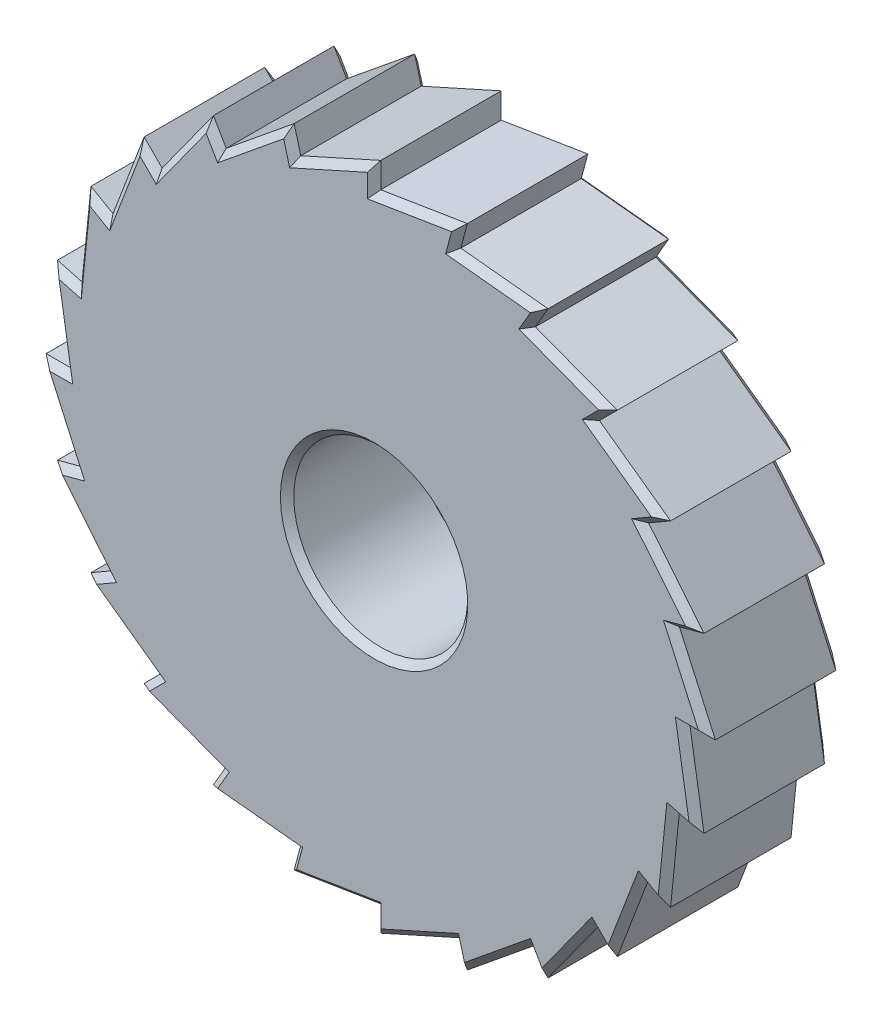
ISO-10303-21;
HEADER;
FILE_DESCRIPTION(('STEP AP214'),'2;1');
FILE_NAME('part.step','',(''),(''),'','','');
FILE_SCHEMA(('AUTOMOTIVE_DESIGN { 1 0 10303 214 1 1 1 1 }'));
ENDSEC;
DATA;
#1=APPLICATION_CONTEXT('core data for automotive mechanical design processes');
#2=APPLICATION_PROTOCOL_DEFINITION('international standard','automotive_design',2000,#1);
#3=PRODUCT_CONTEXT('',#1,'mechanical');
#4=PRODUCT('Part','Part','',(#3));
#5=PRODUCT_RELATED_PRODUCT_CATEGORY('part','',(#4));
#6=PRODUCT_DEFINITION_FORMATION('','',#4);
#7=PRODUCT_DEFINITION_CONTEXT('part definition',#1,'design');
#8=PRODUCT_DEFINITION('design','',#6,#7);
#9=PRODUCT_DEFINITION_SHAPE('','',#8);
#10=(LENGTH_UNIT() NAMED_UNIT(*) SI_UNIT(.MILLI.,.METRE.));
#11=(NAMED_UNIT(*) PLANE_ANGLE_UNIT() SI_UNIT($,.RADIAN.));
#12=(NAMED_UNIT(*) SI_UNIT($,.STERADIAN.) SOLID_ANGLE_UNIT());
#13=UNCERTAINTY_MEASURE_WITH_UNIT(LENGTH_MEASURE(1.E-05),#10,'distance_accuracy_value','');
#14=(GEOMETRIC_REPRESENTATION_CONTEXT(3) GLOBAL_UNCERTAINTY_ASSIGNED_CONTEXT((#13)) GLOBAL_UNIT_ASSIGNED_CONTEXT((#10,
#11,#12)) REPRESENTATION_CONTEXT('',''));
#15=CARTESIAN_POINT('',(0.,0.,0.));
#16=DIRECTION('',(0.,0.,1.));
#17=DIRECTION('',(1.,0.,0.));
#18=AXIS2_PLACEMENT_3D('',#15,#16,#17);
#19=CARTESIAN_POINT('',(30.1465041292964,-11.4507659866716,10.));
#20=DIRECTION('',(0.,0.,-1.));
#21=DIRECTION('',(-1.,0.,0.));
#22=AXIS2_PLACEMENT_3D('',#19,#20,#21);
#23=PLANE('',#22);
#24=CARTESIAN_POINT('',(0.,0.,10.));
#25=DIRECTION('',(0.,0.,-1.));
#26=DIRECTION('',(-1.,0.,0.));
#27=AXIS2_PLACEMENT_3D('',#24,#25,#26);
#28=CIRCLE('',#27,7.);
#29=CARTESIAN_POINT('',(-7.,0.,10.));
#30=VERTEX_POINT('',#29);
#31=EDGE_CURVE('E12',#30,#30,#28,.T.);
#32=ORIENTED_EDGE('',*,*,#31,.T.);
#33=EDGE_LOOP('',(#32));
#34=FACE_BOUND('',#33,.T.);
#35=DIRECTION('',(-0.159904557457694,0.987132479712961,0.));
#36=VECTOR('',#35,1.);
#37=CARTESIAN_POINT('',(22.6064337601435,-0.0799522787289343,10.));
#38=LINE('',#37,#36);
#39=CARTESIAN_POINT('',(23.5309888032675,-5.78747135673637,10.));
#40=VERTEX_POINT('',#39);
#41=CARTESIAN_POINT('',(22.5124878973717,0.49999999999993,10.));
#42=VERTEX_POINT('',#41);
#43=EDGE_CURVE('E195',#40,#42,#38,.T.);
#44=ORIENTED_EDGE('',*,*,#43,.T.);
#45=DIRECTION('',(1.,0.,0.));
#46=VECTOR('',#45,1.);
#47=CARTESIAN_POINT('',(25.,0.49999999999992,10.));
#48=LINE('',#47,#46);
#49=CARTESIAN_POINT('',(24.2270976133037,0.499999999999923,10.));
#50=VERTEX_POINT('',#49);
#51=EDGE_CURVE('E187',#42,#50,#48,.T.);
#52=ORIENTED_EDGE('',*,*,#51,.T.);
#53=DIRECTION('',(-0.409944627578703,0.912110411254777,0.));
#54=VECTOR('',#53,1.);
#55=CARTESIAN_POINT('',(21.8568313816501,5.77374762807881,10.));
#56=LINE('',#55,#54);
#57=CARTESIAN_POINT('',(21.6159839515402,6.30962353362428,10.));
#58=VERTEX_POINT('',#57);
#59=EDGE_CURVE('E1005',#50,#58,#56,.T.);
#60=ORIENTED_EDGE('',*,*,#59,.T.);
#61=DIRECTION('',(0.965925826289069,0.258819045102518,0.));
#62=VECTOR('',#61,1.);
#63=CARTESIAN_POINT('',(24.0187361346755,6.9534390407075,10.));
#64=LINE('',#63,#62);
#65=CARTESIAN_POINT('',(23.272169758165,6.7533971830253,10.));
#66=VERTEX_POINT('',#65);
#67=EDGE_CURVE('E1007',#58,#66,#64,.T.);
#68=ORIENTED_EDGE('',*,*,#67,.T.);
#69=DIRECTION('',(-0.632047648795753,0.774929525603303,0.));
#70=VECTOR('',#69,1.);
#71=CARTESIAN_POINT('',(19.6177220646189,11.2339761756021,10.));
#72=LINE('',#71,#70);
#73=CARTESIAN_POINT('',(19.2463864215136,11.689256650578,10.));
#74=VERTEX_POINT('',#73);
#75=EDGE_CURVE('E1009',#66,#74,#72,.T.);
#76=ORIENTED_EDGE('',*,*,#75,.T.);
#77=DIRECTION('',(0.86602540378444,0.499999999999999,0.));
#78=VECTOR('',#77,1.);
#79=CARTESIAN_POINT('',(21.400635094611,12.9330127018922,10.));
#80=LINE('',#79,#78);
#81=CARTESIAN_POINT('',(20.7312819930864,12.546561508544,10.));
#82=VERTEX_POINT('',#81);
#83=EDGE_CURVE('E1011',#74,#82,#80,.T.);
#84=ORIENTED_EDGE('',*,*,#83,.T.);
#85=DIRECTION('',(-0.811077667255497,0.584938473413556,0.));
#86=VECTOR('',#85,1.);
#87=CARTESIAN_POINT('',(16.0416974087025,15.9286278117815,10.));
#88=LINE('',#87,#86);
#89=CARTESIAN_POINT('',(15.5651794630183,16.2722862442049,10.));
#90=VERTEX_POINT('',#89);
#91=EDGE_CURVE('E1013',#82,#90,#88,.T.);
#92=ORIENTED_EDGE('',*,*,#91,.T.);
#93=DIRECTION('',(0.707106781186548,0.707106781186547,0.));
#94=VECTOR('',#93,1.);
#95=CARTESIAN_POINT('',(17.3241161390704,18.0312229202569,10.));
#96=LINE('',#95,#94);
#97=CARTESIAN_POINT('',(16.7775916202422,17.4846984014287,10.));
#98=VERTEX_POINT('',#97);
#99=EDGE_CURVE('E1015',#90,#98,#96,.T.);
#100=ORIENTED_EDGE('',*,*,#99,.T.);
#101=DIRECTION('',(-0.934834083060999,0.355084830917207,0.));
#102=VECTOR('',#101,1.);
#103=CARTESIAN_POINT('',(11.3724575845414,19.53776978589,10.));
#104=LINE('',#103,#102);
#105=CARTESIAN_POINT('',(10.8232312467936,19.7463864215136,10.));
#106=VERTEX_POINT('',#105);
#107=EDGE_CURVE('E1017',#98,#106,#104,.T.);
#108=ORIENTED_EDGE('',*,*,#107,.T.);
#109=DIRECTION('',(0.500000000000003,0.866025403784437,0.));
#110=VECTOR('',#109,1.);
#111=CARTESIAN_POINT('',(12.0669872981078,21.900635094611,10.));
#112=LINE('',#111,#110);
#113=CARTESIAN_POINT('',(11.6805361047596,21.2312819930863,10.));
#114=VERTEX_POINT('',#113);
#115=EDGE_CURVE('E1019',#106,#114,#112,.T.);
#116=ORIENTED_EDGE('',*,*,#115,.T.);
#117=DIRECTION('',(-0.994883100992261,0.101032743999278,0.));
#118=VECTOR('',#117,1.);
#119=CARTESIAN_POINT('',(5.9282035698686,21.8154450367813,10.));
#120=LINE('',#119,#118);
#121=CARTESIAN_POINT('',(5.34369770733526,21.8748029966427,10.));
#122=VERTEX_POINT('',#121);
#123=EDGE_CURVE('E1021',#114,#122,#120,.T.);
#124=ORIENTED_EDGE('',*,*,#123,.T.);
#125=DIRECTION('',(0.258819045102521,0.965925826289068,0.));
#126=VECTOR('',#125,1.);
#127=CARTESIAN_POINT('',(5.98751321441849,24.277555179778,10.));
#128=LINE('',#127,#126);
#129=CARTESIAN_POINT('',(5.78747135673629,23.5309888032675,10.));
#130=VERTEX_POINT('',#129);
#131=EDGE_CURVE('E1023',#122,#130,#128,.T.);
#132=ORIENTED_EDGE('',*,*,#131,.T.);
#133=DIRECTION('',(-0.98713247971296,-0.159904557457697,0.));
#134=VECTOR('',#133,1.);
#135=CARTESIAN_POINT('',(0.0799522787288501,22.6064337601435,10.));
#136=LINE('',#135,#134);
#137=CARTESIAN_POINT('',(-0.500000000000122,22.5124878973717,10.));
#138=VERTEX_POINT('',#137);
#139=EDGE_CURVE('E1025',#130,#138,#136,.T.);
#140=ORIENTED_EDGE('',*,*,#139,.T.);
#141=DIRECTION('',(1.8397198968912E-13,1.,0.));
#142=VECTOR('',#141,1.);
#143=CARTESIAN_POINT('',(-0.499999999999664,25.0000000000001,10.));
#144=LINE('',#143,#142);
#145=CARTESIAN_POINT('',(-0.499999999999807,24.2270976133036,10.));
#146=VERTEX_POINT('',#145);
#147=EDGE_CURVE('E1027',#138,#146,#144,.T.);
#148=ORIENTED_EDGE('',*,*,#147,.T.);
#149=DIRECTION('',(-0.912110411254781,-0.409944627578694,0.));
#150=VECTOR('',#149,1.);
#151=CARTESIAN_POINT('',(-5.77374762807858,21.8568313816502,10.));
#152=LINE('',#151,#150);
#153=CARTESIAN_POINT('',(-6.30962353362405,21.6159839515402,10.));
#154=VERTEX_POINT('',#153);
#155=EDGE_CURVE('E1029',#146,#154,#152,.T.);
#156=ORIENTED_EDGE('',*,*,#155,.T.);
#157=DIRECTION('',(-0.258819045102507,0.965925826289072,0.));
#158=VECTOR('',#157,1.);
#159=CARTESIAN_POINT('',(-6.95343904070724,24.0187361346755,10.));
#160=LINE('',#159,#158);
#161=CARTESIAN_POINT('',(-6.75339718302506,23.2721697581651,10.));
#162=VERTEX_POINT('',#161);
#163=EDGE_CURVE('E1031',#154,#162,#160,.T.);
#164=ORIENTED_EDGE('',*,*,#163,.T.);
#165=DIRECTION('',(-0.77492952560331,-0.632047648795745,0.));
#166=VECTOR('',#165,1.);
#167=CARTESIAN_POINT('',(-11.2339761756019,19.617722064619,10.));
#168=LINE('',#167,#166);
#169=CARTESIAN_POINT('',(-11.6892566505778,19.2463864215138,10.));
#170=VERTEX_POINT('',#169);
#171=EDGE_CURVE('E1033',#162,#170,#168,.T.);
#172=ORIENTED_EDGE('',*,*,#171,.T.);
#173=DIRECTION('',(-0.499999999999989,0.866025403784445,0.));
#174=VECTOR('',#173,1.);
#175=CARTESIAN_POINT('',(-12.933012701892,21.4006350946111,10.));
#176=LINE('',#175,#174);
#177=CARTESIAN_POINT('',(-12.5465615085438,20.7312819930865,10.));
#178=VERTEX_POINT('',#177);
#179=EDGE_CURVE('E1035',#170,#178,#176,.T.);
#180=ORIENTED_EDGE('',*,*,#179,.T.);
#181=DIRECTION('',(-0.584938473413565,-0.811077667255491,0.));
#182=VECTOR('',#181,1.);
#183=CARTESIAN_POINT('',(-15.9286278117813,16.0416974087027,10.));
#184=LINE('',#183,#182);
#185=CARTESIAN_POINT('',(-16.2722862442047,15.5651794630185,10.));
#186=VERTEX_POINT('',#185);
#187=EDGE_CURVE('E1037',#178,#186,#184,.T.);
#188=ORIENTED_EDGE('',*,*,#187,.T.);
#189=DIRECTION('',(-0.707106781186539,0.707106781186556,0.));
#190=VECTOR('',#189,1.);
#191=CARTESIAN_POINT('',(-18.0312229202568,17.3241161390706,10.));
#192=LINE('',#191,#190);
#193=CARTESIAN_POINT('',(-17.4846984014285,16.7775916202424,10.));
#194=VERTEX_POINT('',#193);
#195=EDGE_CURVE('E1039',#186,#194,#192,.T.);
#196=ORIENTED_EDGE('',*,*,#195,.T.);
#197=DIRECTION('',(-0.355084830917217,-0.934834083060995,0.));
#198=VECTOR('',#197,1.);
#199=CARTESIAN_POINT('',(-19.5377697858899,11.3724575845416,10.));
#200=LINE('',#199,#198);
#201=CARTESIAN_POINT('',(-19.7463864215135,10.8232312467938,10.));
#202=VERTEX_POINT('',#201);
#203=EDGE_CURVE('E1041',#194,#202,#200,.T.);
#204=ORIENTED_EDGE('',*,*,#203,.T.);
#205=DIRECTION('',(-0.866025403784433,0.50000000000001,0.));
#206=VECTOR('',#205,1.);
#207=CARTESIAN_POINT('',(-21.9006350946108,12.066987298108,10.));
#208=LINE('',#207,#206);
#209=CARTESIAN_POINT('',(-21.2312819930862,11.6805361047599,10.));
#210=VERTEX_POINT('',#209);
#211=EDGE_CURVE('E1043',#202,#210,#208,.T.);
#212=ORIENTED_EDGE('',*,*,#211,.T.);
#213=DIRECTION('',(-0.101032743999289,-0.994883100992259,0.));
#214=VECTOR('',#213,1.);
#215=CARTESIAN_POINT('',(-21.8154450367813,5.92820356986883,10.));
#216=LINE('',#215,#214);
#217=CARTESIAN_POINT('',(-21.8748029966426,5.34369770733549,10.));
#218=VERTEX_POINT('',#217);
#219=EDGE_CURVE('E1045',#210,#218,#216,.T.);
#220=ORIENTED_EDGE('',*,*,#219,.T.);
#221=DIRECTION('',(-0.965925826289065,0.258819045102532,0.));
#222=VECTOR('',#221,1.);
#223=CARTESIAN_POINT('',(-24.2775551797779,5.98751321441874,10.));
#224=LINE('',#223,#222);
#225=CARTESIAN_POINT('',(-23.5309888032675,5.78747135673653,10.));
#226=VERTEX_POINT('',#225);
#227=EDGE_CURVE('E1047',#218,#226,#224,.T.);
#228=ORIENTED_EDGE('',*,*,#227,.T.);
#229=DIRECTION('',(0.159904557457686,-0.987132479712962,0.));
#230=VECTOR('',#229,1.);
#231=CARTESIAN_POINT('',(-22.6064337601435,0.0799522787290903,10.));
#232=LINE('',#231,#230);
#233=CARTESIAN_POINT('',(-22.5124878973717,-0.499999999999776,10.));
#234=VERTEX_POINT('',#233);
#235=EDGE_CURVE('E1049',#226,#234,#232,.T.);
#236=ORIENTED_EDGE('',*,*,#235,.T.);
#237=DIRECTION('',(-1.,0.,0.));
#238=VECTOR('',#237,1.);
#239=CARTESIAN_POINT('',(-25.,-0.499999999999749,10.));
#240=LINE('',#239,#238);
#241=CARTESIAN_POINT('',(-24.2270976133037,-0.499999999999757,10.));
#242=VERTEX_POINT('',#241);
#243=EDGE_CURVE('E1051',#234,#242,#240,.T.);
#244=ORIENTED_EDGE('',*,*,#243,.T.);
#245=DIRECTION('',(0.409944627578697,-0.91211041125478,0.));
#246=VECTOR('',#245,1.);
#247=CARTESIAN_POINT('',(-21.8568313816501,-5.77374762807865,10.));
#248=LINE('',#247,#246);
#249=CARTESIAN_POINT('',(-21.6159839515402,-6.30962353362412,10.));
#250=VERTEX_POINT('',#249);
#251=EDGE_CURVE('E1053',#242,#250,#248,.T.);
#252=ORIENTED_EDGE('',*,*,#251,.T.);
#253=DIRECTION('',(-0.965925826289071,-0.258819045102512,0.));
#254=VECTOR('',#253,1.);
#255=CARTESIAN_POINT('',(-24.0187361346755,-6.95343904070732,10.));
#256=LINE('',#255,#254);
#257=CARTESIAN_POINT('',(-23.2721697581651,-6.75339718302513,10.));
#258=VERTEX_POINT('',#257);
#259=EDGE_CURVE('E1055',#250,#258,#256,.T.);
#260=ORIENTED_EDGE('',*,*,#259,.T.);
#261=DIRECTION('',(0.632047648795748,-0.774929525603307,0.));
#262=VECTOR('',#261,1.);
#263=CARTESIAN_POINT('',(-19.617722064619,-11.2339761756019,10.));
#264=LINE('',#263,#262);
#265=CARTESIAN_POINT('',(-19.2463864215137,-11.6892566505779,10.));
#266=VERTEX_POINT('',#265);
#267=EDGE_CURVE('E1057',#258,#266,#264,.T.);
#268=ORIENTED_EDGE('',*,*,#267,.T.);
#269=DIRECTION('',(-0.866025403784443,-0.499999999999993,0.));
#270=VECTOR('',#269,1.);
#271=CARTESIAN_POINT('',(-21.4006350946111,-12.933012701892,10.));
#272=LINE('',#271,#270);
#273=CARTESIAN_POINT('',(-20.7312819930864,-12.5465615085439,10.));
#274=VERTEX_POINT('',#273);
#275=EDGE_CURVE('E1059',#266,#274,#272,.T.);
#276=ORIENTED_EDGE('',*,*,#275,.T.);
#277=DIRECTION('',(0.811077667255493,-0.584938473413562,0.));
#278=VECTOR('',#277,1.);
#279=CARTESIAN_POINT('',(-16.0416974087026,-15.9286278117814,10.));
#280=LINE('',#279,#278);
#281=CARTESIAN_POINT('',(-15.5651794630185,-16.2722862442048,10.));
#282=VERTEX_POINT('',#281);
#283=EDGE_CURVE('E1061',#274,#282,#280,.T.);
#284=ORIENTED_EDGE('',*,*,#283,.T.);
#285=DIRECTION('',(-0.707106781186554,-0.707106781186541,0.));
#286=VECTOR('',#285,1.);
#287=CARTESIAN_POINT('',(-17.3241161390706,-18.0312229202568,10.));
#288=LINE('',#287,#286);
#289=CARTESIAN_POINT('',(-16.7775916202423,-17.4846984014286,10.));
#290=VERTEX_POINT('',#289);
#291=EDGE_CURVE('E1063',#282,#290,#288,.T.);
#292=ORIENTED_EDGE('',*,*,#291,.T.);
#293=DIRECTION('',(0.934834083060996,-0.355084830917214,0.));
#294=VECTOR('',#293,1.);
#295=CARTESIAN_POINT('',(-11.3724575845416,-19.5377697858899,10.));
#296=LINE('',#295,#294);
#297=CARTESIAN_POINT('',(-10.8232312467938,-19.7463864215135,10.));
#298=VERTEX_POINT('',#297);
#299=EDGE_CURVE('E1065',#290,#298,#296,.T.);
#300=ORIENTED_EDGE('',*,*,#299,.T.);
#301=DIRECTION('',(-0.500000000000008,-0.866025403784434,0.));
#302=VECTOR('',#301,1.);
#303=CARTESIAN_POINT('',(-12.066987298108,-21.9006350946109,10.));
#304=LINE('',#303,#302);
#305=CARTESIAN_POINT('',(-11.6805361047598,-21.2312819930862,10.));
#306=VERTEX_POINT('',#305);
#307=EDGE_CURVE('E1067',#298,#306,#304,.T.);
#308=ORIENTED_EDGE('',*,*,#307,.T.);
#309=DIRECTION('',(0.99488310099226,-0.101032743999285,0.));
#310=VECTOR('',#309,1.);
#311=CARTESIAN_POINT('',(-5.92820356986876,-21.8154450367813,10.));
#312=LINE('',#311,#310);
#313=CARTESIAN_POINT('',(-5.34369770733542,-21.8748029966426,10.));
#314=VERTEX_POINT('',#313);
#315=EDGE_CURVE('E1069',#306,#314,#312,.T.);
#316=ORIENTED_EDGE('',*,*,#315,.T.);
#317=DIRECTION('',(-0.258819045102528,-0.965925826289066,0.));
#318=VECTOR('',#317,1.);
#319=CARTESIAN_POINT('',(-5.98751321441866,-24.2775551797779,10.));
#320=LINE('',#319,#318);
#321=CARTESIAN_POINT('',(-5.78747135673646,-23.5309888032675,10.));
#322=VERTEX_POINT('',#321);
#323=EDGE_CURVE('E1071',#314,#322,#320,.T.);
#324=ORIENTED_EDGE('',*,*,#323,.T.);
#325=DIRECTION('',(0.987132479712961,0.159904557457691,0.));
#326=VECTOR('',#325,1.);
#327=CARTESIAN_POINT('',(-0.0799522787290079,-22.6064337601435,10.));
#328=LINE('',#327,#326);
#329=CARTESIAN_POINT('',(0.499999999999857,-22.5124878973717,10.));
#330=VERTEX_POINT('',#329);
#331=EDGE_CURVE('E1073',#322,#330,#328,.T.);
#332=ORIENTED_EDGE('',*,*,#331,.T.);
#333=DIRECTION('',(0.,-1.,0.));
#334=VECTOR('',#333,1.);
#335=CARTESIAN_POINT('',(0.499999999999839,-25.,10.));
#336=LINE('',#335,#334);
#337=CARTESIAN_POINT('',(0.499999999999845,-24.2270976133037,10.));
#338=VERTEX_POINT('',#337);
#339=EDGE_CURVE('E1075',#330,#338,#336,.T.);
#340=ORIENTED_EDGE('',*,*,#339,.T.);
#341=DIRECTION('',(0.912110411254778,0.4099446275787,0.));
#342=VECTOR('',#341,1.);
#343=CARTESIAN_POINT('',(5.77374762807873,-21.8568313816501,10.));
#344=LINE('',#343,#342);
#345=CARTESIAN_POINT('',(6.3096235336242,-21.6159839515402,10.));
#346=VERTEX_POINT('',#345);
#347=EDGE_CURVE('E1077',#338,#346,#344,.T.);
#348=ORIENTED_EDGE('',*,*,#347,.T.);
#349=DIRECTION('',(0.258819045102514,-0.96592582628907,0.));
#350=VECTOR('',#349,1.);
#351=CARTESIAN_POINT('',(6.95343904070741,-24.0187361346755,10.));
#352=LINE('',#351,#350);
#353=CARTESIAN_POINT('',(6.75339718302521,-23.2721697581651,10.));
#354=VERTEX_POINT('',#353);
#355=EDGE_CURVE('E1079',#346,#354,#352,.T.);
#356=ORIENTED_EDGE('',*,*,#355,.T.);
#357=DIRECTION('',(0.774929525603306,0.63204764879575,0.));
#358=VECTOR('',#357,1.);
#359=CARTESIAN_POINT('',(11.233976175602,-19.6177220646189,10.));
#360=LINE('',#359,#358);
#361=CARTESIAN_POINT('',(11.689256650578,-19.2463864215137,10.));
#362=VERTEX_POINT('',#361);
#363=EDGE_CURVE('E1081',#354,#362,#360,.T.);
#364=ORIENTED_EDGE('',*,*,#363,.T.);
#365=DIRECTION('',(0.499999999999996,-0.866025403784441,0.));
#366=VECTOR('',#365,1.);
#367=CARTESIAN_POINT('',(12.9330127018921,-21.400635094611,10.));
#368=LINE('',#367,#366);
#369=CARTESIAN_POINT('',(12.546561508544,-20.7312819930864,10.));
#370=VERTEX_POINT('',#369);
#371=EDGE_CURVE('E1083',#362,#370,#368,.T.);
#372=ORIENTED_EDGE('',*,*,#371,.T.);
#373=DIRECTION('',(0.584938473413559,0.811077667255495,0.));
#374=VECTOR('',#373,1.);
#375=CARTESIAN_POINT('',(15.9286278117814,-16.0416974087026,10.));
#376=LINE('',#375,#374);
#377=CARTESIAN_POINT('',(16.2722862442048,-15.5651794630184,10.));
#378=VERTEX_POINT('',#377);
#379=EDGE_CURVE('E1085',#370,#378,#376,.T.);
#380=ORIENTED_EDGE('',*,*,#379,.T.);
#381=DIRECTION('',(0.707106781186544,-0.707106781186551,0.));
#382=VECTOR('',#381,1.);
#383=CARTESIAN_POINT('',(18.0312229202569,-17.3241161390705,10.));
#384=LINE('',#383,#382);
#385=CARTESIAN_POINT('',(17.4846984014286,-16.7775916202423,10.));
#386=VERTEX_POINT('',#385);
#387=EDGE_CURVE('E1087',#378,#386,#384,.T.);
#388=ORIENTED_EDGE('',*,*,#387,.T.);
#389=DIRECTION('',(0.35508483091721,0.934834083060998,0.));
#390=VECTOR('',#389,1.);
#391=CARTESIAN_POINT('',(19.53776978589,-11.3724575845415,10.));
#392=LINE('',#391,#390);
#393=CARTESIAN_POINT('',(19.7463864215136,-10.8232312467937,10.));
#394=VERTEX_POINT('',#393);
#395=EDGE_CURVE('E1089',#386,#394,#392,.T.);
#396=ORIENTED_EDGE('',*,*,#395,.T.);
#397=DIRECTION('',(0.866025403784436,-0.500000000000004,0.));
#398=VECTOR('',#397,1.);
#399=CARTESIAN_POINT('',(21.9006350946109,-12.0669872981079,10.));
#400=LINE('',#399,#398);
#401=CARTESIAN_POINT('',(21.2312819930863,-11.6805361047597,10.));
#402=VERTEX_POINT('',#401);
#403=EDGE_CURVE('E1091',#394,#402,#400,.T.);
#404=ORIENTED_EDGE('',*,*,#403,.T.);
#405=DIRECTION('',(0.101032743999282,0.99488310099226,0.));
#406=VECTOR('',#405,1.);
#407=CARTESIAN_POINT('',(21.8154450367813,-5.92820356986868,10.));
#408=LINE('',#407,#406);
#409=CARTESIAN_POINT('',(21.8748029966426,-5.34369770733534,10.));
#410=VERTEX_POINT('',#409);
#411=EDGE_CURVE('E1093',#402,#410,#408,.T.);
#412=ORIENTED_EDGE('',*,*,#411,.T.);
#413=DIRECTION('',(0.965925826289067,-0.258819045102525,0.));
#414=VECTOR('',#413,1.);
#415=CARTESIAN_POINT('',(24.2775551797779,-5.98751321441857,10.));
#416=LINE('',#415,#414);
#417=EDGE_CURVE('E200',#410,#40,#416,.T.);
#418=ORIENTED_EDGE('',*,*,#417,.T.);
#419=EDGE_LOOP('',(#44,#52,#60,#68,#76,#84,#92,#100,#108,#116,#124,#132,#140,#148,#156,#164,
#172,#180,#188,#196,#204,#212,#220,#228,#236,#244,#252,#260,#268,#276,#284,#292,#300,#308,#316,
#324,#332,#340,#348,#356,#364,#372,#380,#388,#396,#404,#412,#418));
#420=FACE_BOUND('',#419,.T.);
#421=ADVANCED_FACE('F178',(#34,#420),#23,.F.);
#422=CARTESIAN_POINT('',(30.1465041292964,-11.4507659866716,0.));
#423=DIRECTION('',(0.,0.,-1.));
#424=DIRECTION('',(-1.,0.,0.));
#425=AXIS2_PLACEMENT_3D('',#422,#423,#424);
#426=PLANE('',#425);
#427=CARTESIAN_POINT('',(0.,0.,0.));
#428=DIRECTION('',(0.,0.,-1.));
#429=DIRECTION('',(-1.,0.,0.));
#430=AXIS2_PLACEMENT_3D('',#427,#428,#429);
#431=CIRCLE('',#430,6.99999999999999);
#432=CARTESIAN_POINT('',(-6.99999999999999,0.,0.));
#433=VERTEX_POINT('',#432);
#434=EDGE_CURVE('E799',#433,#433,#431,.F.);
#435=ORIENTED_EDGE('',*,*,#434,.T.);
#436=EDGE_LOOP('',(#435));
#437=FACE_BOUND('',#436,.T.);
#438=DIRECTION('',(0.632047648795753,-0.774929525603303,0.));
#439=VECTOR('',#438,1.);
#440=CARTESIAN_POINT('',(34.9346184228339,-7.54548649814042,0.));
#441=LINE('',#440,#439);
#442=CARTESIAN_POINT('',(19.2463864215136,11.689256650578,0.));
#443=VERTEX_POINT('',#442);
#444=CARTESIAN_POINT('',(23.272169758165,6.7533971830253,0.));
#445=VERTEX_POINT('',#444);
#446=EDGE_CURVE('E797',#443,#445,#441,.T.);
#447=ORIENTED_EDGE('',*,*,#446,.T.);
#448=DIRECTION('',(-0.965925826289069,-0.258819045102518,0.));
#449=VECTOR('',#448,1.);
#450=CARTESIAN_POINT('',(25.1349702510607,7.25253307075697,0.));
#451=LINE('',#450,#449);
#452=CARTESIAN_POINT('',(21.6159839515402,6.30962353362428,0.));
#453=VERTEX_POINT('',#452);
#454=EDGE_CURVE('E778',#445,#453,#451,.T.);
#455=ORIENTED_EDGE('',*,*,#454,.T.);
#456=DIRECTION('',(0.409944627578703,-0.912110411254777,0.));
#457=VECTOR('',#456,1.);
#458=CARTESIAN_POINT('',(29.690448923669,-11.6557383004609,0.));
#459=LINE('',#458,#457);
#460=CARTESIAN_POINT('',(24.2270976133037,0.499999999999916,0.));
#461=VERTEX_POINT('',#460);
#462=EDGE_CURVE('E786',#453,#461,#459,.T.);
#463=ORIENTED_EDGE('',*,*,#462,.T.);
#464=DIRECTION('',(-1.,0.,0.));
#465=VECTOR('',#464,1.);
#466=CARTESIAN_POINT('',(30.1465041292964,0.499999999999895,0.));
#467=LINE('',#466,#465);
#468=CARTESIAN_POINT('',(22.5124878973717,0.499999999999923,0.));
#469=VERTEX_POINT('',#468);
#470=EDGE_CURVE('E792',#461,#469,#467,.T.);
#471=ORIENTED_EDGE('',*,*,#470,.T.);
#472=DIRECTION('',(0.159904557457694,-0.987132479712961,0.));
#473=VECTOR('',#472,1.);
#474=CARTESIAN_POINT('',(24.5940779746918,-12.3501976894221,0.));
#475=LINE('',#474,#473);
#476=CARTESIAN_POINT('',(23.5309888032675,-5.78747135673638,0.));
#477=VERTEX_POINT('',#476);
#478=EDGE_CURVE('E1501',#469,#477,#475,.T.);
#479=ORIENTED_EDGE('',*,*,#478,.T.);
#480=DIRECTION('',(-0.965925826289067,0.258819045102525,0.));
#481=VECTOR('',#480,1.);
#482=CARTESIAN_POINT('',(31.1191722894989,-7.82071899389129,0.));
#483=LINE('',#482,#481);
#484=CARTESIAN_POINT('',(21.8748029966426,-5.34369770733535,0.));
#485=VERTEX_POINT('',#484);
#486=EDGE_CURVE('E1503',#477,#485,#483,.T.);
#487=ORIENTED_EDGE('',*,*,#486,.T.);
#488=DIRECTION('',(-0.101032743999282,-0.99488310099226,0.));
#489=VECTOR('',#488,1.);
#490=CARTESIAN_POINT('',(21.3453806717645,-10.5569909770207,0.));
#491=LINE('',#490,#489);
#492=CARTESIAN_POINT('',(21.2312819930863,-11.6805361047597,0.));
#493=VERTEX_POINT('',#492);
#494=EDGE_CURVE('E1505',#485,#493,#491,.T.);
#495=ORIENTED_EDGE('',*,*,#494,.T.);
#496=DIRECTION('',(-0.866025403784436,0.500000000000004,0.));
#497=VECTOR('',#496,1.);
#498=CARTESIAN_POINT('',(27.8182052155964,-15.4834980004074,0.));
#499=LINE('',#498,#497);
#500=CARTESIAN_POINT('',(19.7463864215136,-10.8232312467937,0.));
#501=VERTEX_POINT('',#500);
#502=EDGE_CURVE('E1507',#493,#501,#499,.T.);
#503=ORIENTED_EDGE('',*,*,#502,.T.);
#504=DIRECTION('',(-0.35508483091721,-0.934834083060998,0.));
#505=VECTOR('',#504,1.);
#506=CARTESIAN_POINT('',(20.8493804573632,-7.91937186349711,0.));
#507=LINE('',#506,#505);
#508=CARTESIAN_POINT('',(17.4846984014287,-16.7775916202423,0.));
#509=VERTEX_POINT('',#508);
#510=EDGE_CURVE('E1509',#501,#509,#507,.T.);
#511=ORIENTED_EDGE('',*,*,#510,.T.);
#512=DIRECTION('',(-0.707106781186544,0.707106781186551,0.));
#513=VECTOR('',#512,1.);
#514=CARTESIAN_POINT('',(21.1521884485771,-20.4450816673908,0.));
#515=LINE('',#514,#513);
#516=CARTESIAN_POINT('',(16.2722862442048,-15.5651794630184,0.));
#517=VERTEX_POINT('',#516);
#518=EDGE_CURVE('E1511',#509,#517,#515,.T.);
#519=ORIENTED_EDGE('',*,*,#518,.T.);
#520=DIRECTION('',(-0.584938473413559,-0.811077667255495,0.));
#521=VECTOR('',#520,1.);
#522=CARTESIAN_POINT('',(22.9713951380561,-6.27617239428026,0.));
#523=LINE('',#522,#521);
#524=CARTESIAN_POINT('',(12.546561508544,-20.7312819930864,0.));
#525=VERTEX_POINT('',#524);
#526=EDGE_CURVE('E1513',#517,#525,#523,.T.);
#527=ORIENTED_EDGE('',*,*,#526,.T.);
#528=DIRECTION('',(-0.499999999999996,0.866025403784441,0.));
#529=VECTOR('',#528,1.);
#530=CARTESIAN_POINT('',(12.9279658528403,-21.3918936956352,0.));
#531=LINE('',#530,#529);
#532=CARTESIAN_POINT('',(11.689256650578,-19.2463864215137,0.));
#533=VERTEX_POINT('',#532);
#534=EDGE_CURVE('E1515',#525,#533,#531,.T.);
#535=ORIENTED_EDGE('',*,*,#534,.T.);
#536=DIRECTION('',(-0.774929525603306,-0.63204764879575,0.));
#537=VECTOR('',#536,1.);
#538=CARTESIAN_POINT('',(26.5913603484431,-7.09193973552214,0.));
#539=LINE('',#538,#537);
#540=CARTESIAN_POINT('',(6.75339718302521,-23.2721697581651,0.));
#541=VERTEX_POINT('',#540);
#542=EDGE_CURVE('E1517',#533,#541,#539,.T.);
#543=ORIENTED_EDGE('',*,*,#542,.T.);
#544=DIRECTION('',(-0.258819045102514,0.96592582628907,0.));
#545=VECTOR('',#544,1.);
#546=CARTESIAN_POINT('',(5.36508726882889,-18.0909266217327,0.));
#547=LINE('',#546,#545);
#548=CARTESIAN_POINT('',(6.3096235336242,-21.6159839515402,0.));
#549=VERTEX_POINT('',#548);
#550=EDGE_CURVE('E1519',#541,#549,#547,.T.);
#551=ORIENTED_EDGE('',*,*,#550,.T.);
#552=DIRECTION('',(-0.912110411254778,-0.4099446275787,0.));
#553=VECTOR('',#552,1.);
#554=CARTESIAN_POINT('',(29.941531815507,-10.9947107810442,0.));
#555=LINE('',#554,#553);
#556=CARTESIAN_POINT('',(0.499999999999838,-24.2270976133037,0.));
#557=VERTEX_POINT('',#556);
#558=EDGE_CURVE('E1521',#549,#557,#555,.T.);
#559=ORIENTED_EDGE('',*,*,#558,.T.);
#560=DIRECTION('',(0.,1.,0.));
#561=VECTOR('',#560,1.);
#562=CARTESIAN_POINT('',(0.499999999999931,-11.4507659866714,0.));
#563=LINE('',#562,#561);
#564=CARTESIAN_POINT('',(0.49999999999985,-22.5124878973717,0.));
#565=VERTEX_POINT('',#564);
#566=EDGE_CURVE('E1523',#557,#565,#563,.T.);
#567=ORIENTED_EDGE('',*,*,#566,.T.);
#568=DIRECTION('',(-0.987132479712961,-0.159904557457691,0.));
#569=VECTOR('',#568,1.);
#570=CARTESIAN_POINT('',(31.1345182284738,-17.5500343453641,0.));
#571=LINE('',#570,#569);
#572=CARTESIAN_POINT('',(-5.78747135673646,-23.5309888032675,0.));
#573=VERTEX_POINT('',#572);
#574=EDGE_CURVE('E1525',#565,#573,#571,.T.);
#575=ORIENTED_EDGE('',*,*,#574,.T.);
#576=DIRECTION('',(0.258819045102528,0.965925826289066,0.));
#577=VECTOR('',#576,1.);
#578=CARTESIAN_POINT('',(-0.360295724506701,-3.2764936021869,0.));
#579=LINE('',#578,#577);
#580=CARTESIAN_POINT('',(-5.34369770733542,-21.8748029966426,0.));
#581=VERTEX_POINT('',#580);
#582=EDGE_CURVE('E1527',#573,#581,#579,.T.);
#583=ORIENTED_EDGE('',*,*,#582,.T.);
#584=DIRECTION('',(-0.99488310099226,0.101032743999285,0.));
#585=VECTOR('',#584,1.);
#586=CARTESIAN_POINT('',(28.7364536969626,-25.3357233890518,0.));
#587=LINE('',#586,#585);
#588=CARTESIAN_POINT('',(-11.6805361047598,-21.2312819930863,0.));
#589=VERTEX_POINT('',#588);
#590=EDGE_CURVE('E1529',#581,#589,#587,.T.);
#591=ORIENTED_EDGE('',*,*,#590,.T.);
#592=DIRECTION('',(0.500000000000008,0.866025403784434,0.));
#593=VECTOR('',#592,1.);
#594=CARTESIAN_POINT('',(3.01131161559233,4.2157447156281,0.));
#595=LINE('',#594,#593);
#596=CARTESIAN_POINT('',(-10.8232312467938,-19.7463864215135,0.));
#597=VERTEX_POINT('',#596);
#598=EDGE_CURVE('E1531',#589,#597,#595,.T.);
#599=ORIENTED_EDGE('',*,*,#598,.T.);
#600=DIRECTION('',(-0.934834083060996,0.355084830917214,0.));
#601=VECTOR('',#600,1.);
#602=CARTESIAN_POINT('',(22.2271322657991,-32.3001464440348,0.));
#603=LINE('',#602,#601);
#604=CARTESIAN_POINT('',(-16.7775916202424,-17.4846984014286,0.));
#605=VERTEX_POINT('',#604);
#606=EDGE_CURVE('E1533',#597,#605,#603,.T.);
#607=ORIENTED_EDGE('',*,*,#606,.T.);
#608=DIRECTION('',(0.707106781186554,0.707106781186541,0.));
#609=VECTOR('',#608,1.);
#610=CARTESIAN_POINT('',(9.70142246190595,8.99431568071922,0.));
#611=LINE('',#610,#609);
#612=CARTESIAN_POINT('',(-15.5651794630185,-16.2722862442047,0.));
#613=VERTEX_POINT('',#612);
#614=EDGE_CURVE('E1535',#605,#613,#611,.T.);
#615=ORIENTED_EDGE('',*,*,#614,.T.);
#616=DIRECTION('',(-0.811077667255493,0.584938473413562,0.));
#617=VECTOR('',#616,1.);
#618=CARTESIAN_POINT('',(12.2186372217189,-36.3096069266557,0.));
#619=LINE('',#618,#617);
#620=CARTESIAN_POINT('',(-20.7312819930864,-12.5465615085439,0.));
#621=VERTEX_POINT('',#620);
#622=EDGE_CURVE('E1537',#613,#621,#619,.T.);
#623=ORIENTED_EDGE('',*,*,#622,.T.);
#624=DIRECTION('',(0.866025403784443,0.499999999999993,0.));
#625=VECTOR('',#624,1.);
#626=CARTESIAN_POINT('',(17.9015509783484,9.75811500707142,0.));
#627=LINE('',#626,#625);
#628=CARTESIAN_POINT('',(-19.2463864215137,-11.6892566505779,0.));
#629=VERTEX_POINT('',#628);
#630=EDGE_CURVE('E1539',#621,#629,#627,.T.);
#631=ORIENTED_EDGE('',*,*,#630,.T.);
#632=DIRECTION('',(-0.632047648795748,0.774929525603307,0.));
#633=VECTOR('',#632,1.);
#634=CARTESIAN_POINT('',(0.368483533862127,-35.73830089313,0.));
#635=LINE('',#634,#633);
#636=CARTESIAN_POINT('',(-23.2721697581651,-6.75339718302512,0.));
#637=VERTEX_POINT('',#636);
#638=EDGE_CURVE('E1541',#629,#637,#635,.T.);
#639=ORIENTED_EDGE('',*,*,#638,.T.);
#640=DIRECTION('',(0.965925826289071,0.258819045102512,0.));
#641=VECTOR('',#640,1.);
#642=CARTESIAN_POINT('',(25.3937892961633,6.28660724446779,0.));
#643=LINE('',#642,#641);
#644=CARTESIAN_POINT('',(-21.6159839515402,-6.30962353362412,0.));
#645=VERTEX_POINT('',#644);
#646=EDGE_CURVE('E1543',#637,#645,#643,.T.);
#647=ORIENTED_EDGE('',*,*,#646,.T.);
#648=DIRECTION('',(-0.409944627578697,0.91211041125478,0.));
#649=VECTOR('',#648,1.);
#650=CARTESIAN_POINT('',(-10.9947107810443,-29.9415318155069,0.));
#651=LINE('',#650,#649);
#652=CARTESIAN_POINT('',(-24.2270976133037,-0.49999999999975,0.));
#653=VERTEX_POINT('',#652);
#654=EDGE_CURVE('E1545',#645,#653,#651,.T.);
#655=ORIENTED_EDGE('',*,*,#654,.T.);
#656=DIRECTION('',(1.,0.,0.));
#657=VECTOR('',#656,1.);
#658=CARTESIAN_POINT('',(30.1465041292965,-0.500000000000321,0.));
#659=LINE('',#658,#657);
#660=CARTESIAN_POINT('',(-22.5124878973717,-0.499999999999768,0.));
#661=VERTEX_POINT('',#660);
#662=EDGE_CURVE('E1547',#653,#661,#659,.T.);
#663=ORIENTED_EDGE('',*,*,#662,.T.);
#664=DIRECTION('',(-0.159904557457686,0.987132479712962,0.));
#665=VECTOR('',#664,1.);
#666=CARTESIAN_POINT('',(-19.4374801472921,-19.4828237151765,0.));
#667=LINE('',#666,#665);
#668=CARTESIAN_POINT('',(-23.5309888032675,5.78747135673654,0.));
#669=VERTEX_POINT('',#668);
#670=EDGE_CURVE('E1549',#661,#669,#667,.T.);
#671=ORIENTED_EDGE('',*,*,#670,.T.);
#672=DIRECTION('',(0.965925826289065,-0.258819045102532,0.));
#673=VECTOR('',#672,1.);
#674=CARTESIAN_POINT('',(30.8603532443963,-8.78664482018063,0.));
#675=LINE('',#674,#673);
#676=CARTESIAN_POINT('',(-21.8748029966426,5.3436977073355,0.));
#677=VERTEX_POINT('',#676);
#678=EDGE_CURVE('E1551',#669,#677,#675,.T.);
#679=ORIENTED_EDGE('',*,*,#678,.T.);
#680=DIRECTION('',(0.101032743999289,0.994883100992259,0.));
#681=VECTOR('',#680,1.);
#682=CARTESIAN_POINT('',(-23.0318979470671,-6.0503728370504,0.));
#683=LINE('',#682,#681);
#684=CARTESIAN_POINT('',(-21.2312819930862,11.6805361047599,0.));
#685=VERTEX_POINT('',#684);
#686=EDGE_CURVE('E1553',#677,#685,#683,.T.);
#687=ORIENTED_EDGE('',*,*,#686,.T.);
#688=DIRECTION('',(0.866025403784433,-0.50000000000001,0.));
#689=VECTOR('',#688,1.);
#690=CARTESIAN_POINT('',(27.3182052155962,-16.349523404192,0.));
#691=LINE('',#690,#689);
#692=CARTESIAN_POINT('',(-19.7463864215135,10.8232312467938,0.));
#693=VERTEX_POINT('',#692);
#694=EDGE_CURVE('E1555',#685,#693,#691,.T.);
#695=ORIENTED_EDGE('',*,*,#694,.T.);
#696=DIRECTION('',(0.355084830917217,0.934834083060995,0.));
#697=VECTOR('',#696,1.);
#698=CARTESIAN_POINT('',(-20.849380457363,7.91937186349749,0.));
#699=LINE('',#698,#697);
#700=CARTESIAN_POINT('',(-17.4846984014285,16.7775916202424,0.));
#701=VERTEX_POINT('',#700);
#702=EDGE_CURVE('E1557',#693,#701,#699,.T.);
#703=ORIENTED_EDGE('',*,*,#702,.T.);
#704=DIRECTION('',(0.707106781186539,-0.707106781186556,0.));
#705=VECTOR('',#704,1.);
#706=CARTESIAN_POINT('',(20.4450816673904,-21.1521884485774,0.));
#707=LINE('',#706,#705);
#708=CARTESIAN_POINT('',(-16.2722862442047,15.5651794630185,0.));
#709=VERTEX_POINT('',#708);
#710=EDGE_CURVE('E1559',#701,#709,#707,.T.);
#711=ORIENTED_EDGE('',*,*,#710,.T.);
#712=DIRECTION('',(0.584938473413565,0.811077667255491,0.));
#713=VECTOR('',#712,1.);
#714=CARTESIAN_POINT('',(-13.2071464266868,19.8153127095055,0.));
#715=LINE('',#714,#713);
#716=CARTESIAN_POINT('',(-12.5465615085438,20.7312819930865,0.));
#717=VERTEX_POINT('',#716);
#718=EDGE_CURVE('E1561',#709,#717,#715,.T.);
#719=ORIENTED_EDGE('',*,*,#718,.T.);
#720=DIRECTION('',(0.499999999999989,-0.866025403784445,0.));
#721=VECTOR('',#720,1.);
#722=CARTESIAN_POINT('',(12.0619404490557,-21.8918936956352,0.));
#723=LINE('',#722,#721);
#724=CARTESIAN_POINT('',(-11.6892566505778,19.2463864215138,0.));
#725=VERTEX_POINT('',#724);
#726=EDGE_CURVE('E1563',#717,#725,#723,.T.);
#727=ORIENTED_EDGE('',*,*,#726,.T.);
#728=DIRECTION('',(0.77492952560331,0.632047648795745,0.));
#729=VECTOR('',#728,1.);
#730=CARTESIAN_POINT('',(-1.60145404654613,27.4741951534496,0.));
#731=LINE('',#730,#729);
#732=CARTESIAN_POINT('',(-6.75339718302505,23.2721697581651,0.));
#733=VERTEX_POINT('',#732);
#734=EDGE_CURVE('E1565',#725,#733,#731,.T.);
#735=ORIENTED_EDGE('',*,*,#734,.T.);
#736=DIRECTION('',(0.258819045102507,-0.965925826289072,0.));
#737=VECTOR('',#736,1.);
#738=CARTESIAN_POINT('',(4.39916144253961,-18.349745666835,0.));
#739=LINE('',#738,#737);
#740=CARTESIAN_POINT('',(-6.30962353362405,21.6159839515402,0.));
#741=VERTEX_POINT('',#740);
#742=EDGE_CURVE('E1567',#733,#741,#739,.T.);
#743=ORIENTED_EDGE('',*,*,#742,.T.);
#744=DIRECTION('',(0.912110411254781,0.409944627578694,0.));
#745=VECTOR('',#744,1.);
#746=CARTESIAN_POINT('',(11.6557383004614,29.6904489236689,0.));
#747=LINE('',#746,#745);
#748=CARTESIAN_POINT('',(-0.4999999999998,24.2270976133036,0.));
#749=VERTEX_POINT('',#748);
#750=EDGE_CURVE('E1569',#741,#749,#747,.T.);
#751=ORIENTED_EDGE('',*,*,#750,.T.);
#752=DIRECTION('',(-1.8397198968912E-13,-1.,0.));
#753=VECTOR('',#752,1.);
#754=CARTESIAN_POINT('',(-0.500000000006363,-11.4507659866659,0.));
#755=LINE('',#754,#753);
#756=CARTESIAN_POINT('',(-0.500000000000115,22.5124878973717,0.));
#757=VERTEX_POINT('',#756);
#758=EDGE_CURVE('E1571',#749,#757,#755,.T.);
#759=ORIENTED_EDGE('',*,*,#758,.T.);
#760=DIRECTION('',(0.98713247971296,0.159904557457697,0.));
#761=VECTOR('',#760,1.);
#762=CARTESIAN_POINT('',(24.0018922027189,26.4815237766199,0.));
#763=LINE('',#762,#761);
#764=CARTESIAN_POINT('',(5.7874713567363,23.5309888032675,0.));
#765=VERTEX_POINT('',#764);
#766=EDGE_CURVE('E1573',#757,#765,#763,.T.);
#767=ORIENTED_EDGE('',*,*,#766,.T.);
#768=DIRECTION('',(-0.258819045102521,-0.965925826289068,0.));
#769=VECTOR('',#768,1.);
#770=CARTESIAN_POINT('',(-1.32622155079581,-3.01767455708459,0.));
#771=LINE('',#770,#769);
#772=CARTESIAN_POINT('',(5.34369770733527,21.8748029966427,0.));
#773=VERTEX_POINT('',#772);
#774=EDGE_CURVE('E1575',#765,#773,#771,.T.);
#775=ORIENTED_EDGE('',*,*,#774,.T.);
#776=DIRECTION('',(0.994883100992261,-0.101032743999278,0.));
#777=VECTOR('',#776,1.);
#778=CARTESIAN_POINT('',(33.2430718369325,19.0415552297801,0.));
#779=LINE('',#778,#777);
#780=CARTESIAN_POINT('',(11.6805361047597,21.2312819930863,0.));
#781=VERTEX_POINT('',#780);
#782=EDGE_CURVE('E1577',#773,#781,#779,.T.);
#783=ORIENTED_EDGE('',*,*,#782,.T.);
#784=DIRECTION('',(-0.500000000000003,-0.866025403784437,0.));
#785=VECTOR('',#784,1.);
#786=CARTESIAN_POINT('',(2.14528621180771,4.71574471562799,0.));
#787=LINE('',#786,#785);
#788=CARTESIAN_POINT('',(10.8232312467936,19.7463864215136,0.));
#789=VERTEX_POINT('',#788);
#790=EDGE_CURVE('E1579',#781,#789,#787,.T.);
#791=ORIENTED_EDGE('',*,*,#790,.T.);
#792=DIRECTION('',(0.934834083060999,-0.355084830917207,0.));
#793=VECTOR('',#792,1.);
#794=CARTESIAN_POINT('',(38.0658759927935,9.39861447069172,0.));
#795=LINE('',#794,#793);
#796=CARTESIAN_POINT('',(16.7775916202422,17.4846984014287,0.));
#797=VERTEX_POINT('',#796);
#798=EDGE_CURVE('E1581',#789,#797,#795,.T.);
#799=ORIENTED_EDGE('',*,*,#798,.T.);
#800=DIRECTION('',(-0.707106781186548,-0.707106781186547,0.));
#801=VECTOR('',#800,1.);
#802=CARTESIAN_POINT('',(8.99431568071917,9.70142246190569,0.));
#803=LINE('',#802,#801);
#804=CARTESIAN_POINT('',(15.5651794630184,16.2722862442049,0.));
#805=VERTEX_POINT('',#804);
#806=EDGE_CURVE('E1583',#797,#805,#803,.T.);
#807=ORIENTED_EDGE('',*,*,#806,.T.);
#808=DIRECTION('',(0.811077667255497,-0.584938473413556,0.));
#809=VECTOR('',#808,1.);
#810=CARTESIAN_POINT('',(38.3101223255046,-0.131065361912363,0.));
#811=LINE('',#810,#809);
#812=CARTESIAN_POINT('',(20.7312819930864,12.546561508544,0.));
#813=VERTEX_POINT('',#812);
#814=EDGE_CURVE('E1585',#805,#813,#811,.T.);
#815=ORIENTED_EDGE('',*,*,#814,.T.);
#816=DIRECTION('',(-0.86602540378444,-0.499999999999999,0.));
#817=VECTOR('',#816,1.);
#818=CARTESIAN_POINT('',(17.4015509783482,10.6241404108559,0.));
#819=LINE('',#818,#817);
#820=EDGE_CURVE('E804',#813,#443,#819,.T.);
#821=ORIENTED_EDGE('',*,*,#820,.T.);
#822=EDGE_LOOP('',(#447,#455,#463,#471,#479,#487,#495,#503,#511,#519,#527,#535,#543,#551,#559,
#567,#575,#583,#591,#599,#607,#615,#623,#631,#639,#647,#655,#663,#671,#679,#687,#695,#703,#711,
#719,#727,#735,#743,#751,#759,#767,#775,#783,#791,#799,#807,#815,#821));
#823=FACE_BOUND('',#822,.T.);
#824=ADVANCED_FACE('F795',(#437,#823),#426,.T.);
#825=CARTESIAN_POINT('',(22.3128865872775,5.97871994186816,10.));
#826=DIRECTION('',(0.912110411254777,0.409944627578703,0.));
#827=DIRECTION('',(-0.409944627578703,0.912110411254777,0.));
#828=AXIS2_PLACEMENT_3D('',#825,#826,#827);
#829=PLANE('',#828);
#830=DIRECTION('',(0.,0.,-1.));
#831=VECTOR('',#830,1.);
#832=CARTESIAN_POINT('',(25.,0.,10.));
#833=LINE('',#832,#831);
#834=CARTESIAN_POINT('',(25.,0.,9.49999999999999));
#835=VERTEX_POINT('',#834);
#836=CARTESIAN_POINT('',(25.,0.,0.500000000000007));
#837=VERTEX_POINT('',#836);
#838=EDGE_CURVE('E1235',#835,#837,#833,.T.);
#839=ORIENTED_EDGE('',*,*,#838,.T.);
#840=DIRECTION('',(-0.409944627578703,0.912110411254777,0.));
#841=VECTOR('',#840,1.);
#842=CARTESIAN_POINT('',(22.3128865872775,5.97871994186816,0.500000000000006));
#843=LINE('',#842,#841);
#844=CARTESIAN_POINT('',(22.3128865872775,5.97871994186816,0.500000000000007));
#845=VERTEX_POINT('',#844);
#846=EDGE_CURVE('E1003',#837,#845,#843,.T.);
#847=ORIENTED_EDGE('',*,*,#846,.T.);
#848=DIRECTION('',(0.,0.,-1.));
#849=VECTOR('',#848,1.);
#850=CARTESIAN_POINT('',(22.3128865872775,5.97871994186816,10.));
#851=LINE('',#850,#849);
#852=CARTESIAN_POINT('',(22.3128865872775,5.97871994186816,9.49999999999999));
#853=VERTEX_POINT('',#852);
#854=EDGE_CURVE('E793',#853,#845,#851,.T.);
#855=ORIENTED_EDGE('',*,*,#854,.F.);
#856=DIRECTION('',(0.409944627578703,-0.912110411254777,0.));
#857=VECTOR('',#856,1.);
#858=CARTESIAN_POINT('',(25.,0.,9.49999999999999));
#859=LINE('',#858,#857);
#860=EDGE_CURVE('E1001',#853,#835,#859,.T.);
#861=ORIENTED_EDGE('',*,*,#860,.T.);
#862=EDGE_LOOP('',(#839,#847,#855,#861));
#863=FACE_BOUND('',#862,.T.);
#864=ADVANCED_FACE('F1771',(#863),#829,.T.);
#865=CARTESIAN_POINT('',(24.1481456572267,6.47047612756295,10.));
#866=DIRECTION('',(0.258819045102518,-0.965925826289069,0.));
#867=DIRECTION('',(0.965925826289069,0.258819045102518,0.));
#868=AXIS2_PLACEMENT_3D('',#865,#866,#867);
#869=PLANE('',#868);
#870=ORIENTED_EDGE('',*,*,#854,.T.);
#871=DIRECTION('',(0.965925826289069,0.258819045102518,0.));
#872=VECTOR('',#871,1.);
#873=CARTESIAN_POINT('',(24.1481456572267,6.47047612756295,0.500000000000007));
#874=LINE('',#873,#872);
#875=CARTESIAN_POINT('',(24.1481456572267,6.47047612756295,0.500000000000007));
#876=VERTEX_POINT('',#875);
#877=EDGE_CURVE('E780',#845,#876,#874,.T.);
#878=ORIENTED_EDGE('',*,*,#877,.T.);
#879=DIRECTION('',(0.,0.,-1.));
#880=VECTOR('',#879,1.);
#881=CARTESIAN_POINT('',(24.1481456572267,6.47047612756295,10.));
#882=LINE('',#881,#880);
#883=CARTESIAN_POINT('',(24.1481456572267,6.47047612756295,9.49999999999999));
#884=VERTEX_POINT('',#883);
#885=EDGE_CURVE('E1604',#884,#876,#882,.T.);
#886=ORIENTED_EDGE('',*,*,#885,.F.);
#887=DIRECTION('',(-0.965925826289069,-0.258819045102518,0.));
#888=VECTOR('',#887,1.);
#889=CARTESIAN_POINT('',(22.3128865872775,5.97871994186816,9.49999999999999));
#890=LINE('',#889,#888);
#891=EDGE_CURVE('E813',#884,#853,#890,.T.);
#892=ORIENTED_EDGE('',*,*,#891,.T.);
#893=EDGE_LOOP('',(#870,#878,#886,#892));
#894=FACE_BOUND('',#893,.T.);
#895=ADVANCED_FACE('F1603',(#894),#869,.T.);
#896=CARTESIAN_POINT('',(20.0051868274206,11.55,10.));
#897=DIRECTION('',(0.774929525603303,0.632047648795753,0.));
#898=DIRECTION('',(-0.632047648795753,0.774929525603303,0.));
#899=AXIS2_PLACEMENT_3D('',#896,#897,#898);
#900=PLANE('',#899);
#901=ORIENTED_EDGE('',*,*,#885,.T.);
#902=DIRECTION('',(-0.632047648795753,0.774929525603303,0.));
#903=VECTOR('',#902,1.);
#904=CARTESIAN_POINT('',(20.0051868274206,11.55,0.500000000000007));
#905=LINE('',#904,#903);
#906=CARTESIAN_POINT('',(20.0051868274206,11.55,0.500000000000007));
#907=VERTEX_POINT('',#906);
#908=EDGE_CURVE('E818',#876,#907,#905,.T.);
#909=ORIENTED_EDGE('',*,*,#908,.T.);
#910=DIRECTION('',(0.,0.,-1.));
#911=VECTOR('',#910,1.);
#912=CARTESIAN_POINT('',(20.0051868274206,11.55,10.));
#913=LINE('',#912,#911);
#914=CARTESIAN_POINT('',(20.0051868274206,11.55,9.49999999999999));
#915=VERTEX_POINT('',#914);
#916=EDGE_CURVE('E1609',#915,#907,#913,.T.);
#917=ORIENTED_EDGE('',*,*,#916,.F.);
#918=DIRECTION('',(0.632047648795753,-0.774929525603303,0.));
#919=VECTOR('',#918,1.);
#920=CARTESIAN_POINT('',(24.1481456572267,6.47047612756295,9.49999999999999));
#921=LINE('',#920,#919);
#922=EDGE_CURVE('E816',#915,#884,#921,.T.);
#923=ORIENTED_EDGE('',*,*,#922,.T.);
#924=EDGE_LOOP('',(#901,#909,#917,#923));
#925=FACE_BOUND('',#924,.T.);
#926=ADVANCED_FACE('F1607',(#925),#900,.T.);
#927=CARTESIAN_POINT('',(21.650635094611,12.4999999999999,10.));
#928=DIRECTION('',(0.499999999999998,-0.86602540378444,0.));
#929=DIRECTION('',(0.86602540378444,0.499999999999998,0.));
#930=AXIS2_PLACEMENT_3D('',#927,#928,#929);
#931=PLANE('',#930);
#932=ORIENTED_EDGE('',*,*,#916,.T.);
#933=DIRECTION('',(0.86602540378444,0.499999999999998,0.));
#934=VECTOR('',#933,1.);
#935=CARTESIAN_POINT('',(21.650635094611,12.4999999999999,0.500000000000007));
#936=LINE('',#935,#934);
#937=CARTESIAN_POINT('',(21.650635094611,12.4999999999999,0.500000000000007));
#938=VERTEX_POINT('',#937);
#939=EDGE_CURVE('E822',#907,#938,#936,.T.);
#940=ORIENTED_EDGE('',*,*,#939,.T.);
#941=DIRECTION('',(0.,0.,-1.));
#942=VECTOR('',#941,1.);
#943=CARTESIAN_POINT('',(21.650635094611,12.4999999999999,10.));
#944=LINE('',#943,#942);
#945=CARTESIAN_POINT('',(21.650635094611,12.4999999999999,9.49999999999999));
#946=VERTEX_POINT('',#945);
#947=EDGE_CURVE('E1612',#946,#938,#944,.T.);
#948=ORIENTED_EDGE('',*,*,#947,.F.);
#949=DIRECTION('',(-0.86602540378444,-0.499999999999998,0.));
#950=VECTOR('',#949,1.);
#951=CARTESIAN_POINT('',(20.0051868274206,11.55,9.49999999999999));
#952=LINE('',#951,#950);
#953=EDGE_CURVE('E820',#946,#915,#952,.T.);
#954=ORIENTED_EDGE('',*,*,#953,.T.);
#955=EDGE_LOOP('',(#932,#940,#948,#954));
#956=FACE_BOUND('',#955,.T.);
#957=ADVANCED_FACE('F1781',(#956),#931,.T.);
#958=CARTESIAN_POINT('',(16.3341666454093,16.3341666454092,10.));
#959=DIRECTION('',(0.584938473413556,0.811077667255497,0.));
#960=DIRECTION('',(-0.811077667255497,0.584938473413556,0.));
#961=AXIS2_PLACEMENT_3D('',#958,#959,#960);
#962=PLANE('',#961);
#963=ORIENTED_EDGE('',*,*,#947,.T.);
#964=DIRECTION('',(-0.811077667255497,0.584938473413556,0.));
#965=VECTOR('',#964,1.);
#966=CARTESIAN_POINT('',(16.3341666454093,16.3341666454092,0.500000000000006));
#967=LINE('',#966,#965);
#968=CARTESIAN_POINT('',(16.3341666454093,16.3341666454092,0.500000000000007));
#969=VERTEX_POINT('',#968);
#970=EDGE_CURVE('E826',#938,#969,#967,.T.);
#971=ORIENTED_EDGE('',*,*,#970,.T.);
#972=DIRECTION('',(0.,0.,-1.));
#973=VECTOR('',#972,1.);
#974=CARTESIAN_POINT('',(16.3341666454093,16.3341666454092,10.));
#975=LINE('',#974,#973);
#976=CARTESIAN_POINT('',(16.3341666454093,16.3341666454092,9.49999999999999));
#977=VERTEX_POINT('',#976);
#978=EDGE_CURVE('E1617',#977,#969,#975,.T.);
#979=ORIENTED_EDGE('',*,*,#978,.F.);
#980=DIRECTION('',(0.811077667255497,-0.584938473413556,0.));
#981=VECTOR('',#980,1.);
#982=CARTESIAN_POINT('',(21.650635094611,12.5,9.49999999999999));
#983=LINE('',#982,#981);
#984=EDGE_CURVE('E824',#977,#946,#983,.T.);
#985=ORIENTED_EDGE('',*,*,#984,.T.);
#986=EDGE_LOOP('',(#963,#971,#979,#985));
#987=FACE_BOUND('',#986,.T.);
#988=ADVANCED_FACE('F1784',(#987),#962,.T.);
#989=CARTESIAN_POINT('',(17.6776695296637,17.6776695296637,10.));
#990=DIRECTION('',(0.707106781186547,-0.707106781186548,0.));
#991=DIRECTION('',(0.707106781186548,0.707106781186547,0.));
#992=AXIS2_PLACEMENT_3D('',#989,#990,#991);
#993=PLANE('',#992);
#994=ORIENTED_EDGE('',*,*,#978,.T.);
#995=DIRECTION('',(0.707106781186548,0.707106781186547,0.));
#996=VECTOR('',#995,1.);
#997=CARTESIAN_POINT('',(17.6776695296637,17.6776695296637,0.500000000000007));
#998=LINE('',#997,#996);
#999=CARTESIAN_POINT('',(17.6776695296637,17.6776695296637,0.500000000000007));
#1000=VERTEX_POINT('',#999);
#1001=EDGE_CURVE('E830',#969,#1000,#998,.T.);
#1002=ORIENTED_EDGE('',*,*,#1001,.T.);
#1003=DIRECTION('',(0.,0.,-1.));
#1004=VECTOR('',#1003,1.);
#1005=CARTESIAN_POINT('',(17.6776695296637,17.6776695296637,10.));
#1006=LINE('',#1005,#1004);
#1007=CARTESIAN_POINT('',(17.6776695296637,17.6776695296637,9.49999999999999));
#1008=VERTEX_POINT('',#1007);
#1009=EDGE_CURVE('E1620',#1008,#1000,#1006,.T.);
#1010=ORIENTED_EDGE('',*,*,#1009,.F.);
#1011=DIRECTION('',(-0.707106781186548,-0.707106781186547,0.));
#1012=VECTOR('',#1011,1.);
#1013=CARTESIAN_POINT('',(16.3341666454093,16.3341666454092,9.49999999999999));
#1014=LINE('',#1013,#1012);
#1015=EDGE_CURVE('E828',#1008,#977,#1014,.T.);
#1016=ORIENTED_EDGE('',*,*,#1015,.T.);
#1017=EDGE_LOOP('',(#994,#1002,#1010,#1016));
#1018=FACE_BOUND('',#1017,.T.);
#1019=ADVANCED_FACE('F1788',(#1018),#993,.T.);
#1020=CARTESIAN_POINT('',(11.55,20.0051868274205,10.));
#1021=DIRECTION('',(0.355084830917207,0.934834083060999,0.));
#1022=DIRECTION('',(-0.934834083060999,0.355084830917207,0.));
#1023=AXIS2_PLACEMENT_3D('',#1020,#1021,#1022);
#1024=PLANE('',#1023);
#1025=ORIENTED_EDGE('',*,*,#1009,.T.);
#1026=DIRECTION('',(-0.934834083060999,0.355084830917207,0.));
#1027=VECTOR('',#1026,1.);
#1028=CARTESIAN_POINT('',(11.55,20.0051868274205,0.500000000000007));
#1029=LINE('',#1028,#1027);
#1030=CARTESIAN_POINT('',(11.55,20.0051868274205,0.500000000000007));
#1031=VERTEX_POINT('',#1030);
#1032=EDGE_CURVE('E834',#1000,#1031,#1029,.T.);
#1033=ORIENTED_EDGE('',*,*,#1032,.T.);
#1034=DIRECTION('',(0.,0.,-1.));
#1035=VECTOR('',#1034,1.);
#1036=CARTESIAN_POINT('',(11.55,20.0051868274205,10.));
#1037=LINE('',#1036,#1035);
#1038=CARTESIAN_POINT('',(11.55,20.0051868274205,9.49999999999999));
#1039=VERTEX_POINT('',#1038);
#1040=EDGE_CURVE('E1623',#1039,#1031,#1037,.T.);
#1041=ORIENTED_EDGE('',*,*,#1040,.F.);
#1042=DIRECTION('',(0.934834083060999,-0.355084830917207,0.));
#1043=VECTOR('',#1042,1.);
#1044=CARTESIAN_POINT('',(17.6776695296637,17.6776695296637,9.49999999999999));
#1045=LINE('',#1044,#1043);
#1046=EDGE_CURVE('E832',#1039,#1008,#1045,.T.);
#1047=ORIENTED_EDGE('',*,*,#1046,.T.);
#1048=EDGE_LOOP('',(#1025,#1033,#1041,#1047));
#1049=FACE_BOUND('',#1048,.T.);
#1050=ADVANCED_FACE('F1792',(#1049),#1024,.T.);
#1051=CARTESIAN_POINT('',(12.5,21.650635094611,10.));
#1052=DIRECTION('',(0.866025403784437,-0.500000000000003,0.));
#1053=DIRECTION('',(0.500000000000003,0.866025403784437,0.));
#1054=AXIS2_PLACEMENT_3D('',#1051,#1052,#1053);
#1055=PLANE('',#1054);
#1056=ORIENTED_EDGE('',*,*,#1040,.T.);
#1057=DIRECTION('',(0.500000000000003,0.866025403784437,0.));
#1058=VECTOR('',#1057,1.);
#1059=CARTESIAN_POINT('',(12.5,21.650635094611,0.500000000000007));
#1060=LINE('',#1059,#1058);
#1061=CARTESIAN_POINT('',(12.5,21.650635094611,0.500000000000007));
#1062=VERTEX_POINT('',#1061);
#1063=EDGE_CURVE('E838',#1031,#1062,#1060,.T.);
#1064=ORIENTED_EDGE('',*,*,#1063,.T.);
#1065=DIRECTION('',(0.,0.,-1.));
#1066=VECTOR('',#1065,1.);
#1067=CARTESIAN_POINT('',(12.5,21.650635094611,10.));
#1068=LINE('',#1067,#1066);
#1069=CARTESIAN_POINT('',(12.5,21.650635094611,9.49999999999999));
#1070=VERTEX_POINT('',#1069);
#1071=EDGE_CURVE('E1626',#1070,#1062,#1068,.T.);
#1072=ORIENTED_EDGE('',*,*,#1071,.F.);
#1073=DIRECTION('',(-0.500000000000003,-0.866025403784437,0.));
#1074=VECTOR('',#1073,1.);
#1075=CARTESIAN_POINT('',(11.55,20.0051868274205,9.49999999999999));
#1076=LINE('',#1075,#1074);
#1077=EDGE_CURVE('E836',#1070,#1039,#1076,.T.);
#1078=ORIENTED_EDGE('',*,*,#1077,.T.);
#1079=EDGE_LOOP('',(#1056,#1064,#1072,#1078));
#1080=FACE_BOUND('',#1079,.T.);
#1081=ADVANCED_FACE('F1796',(#1080),#1055,.T.);
#1082=CARTESIAN_POINT('',(5.97871994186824,22.3128865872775,10.));
#1083=DIRECTION('',(0.101032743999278,0.99488310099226,0.));
#1084=DIRECTION('',(-0.994883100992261,0.101032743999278,0.));
#1085=AXIS2_PLACEMENT_3D('',#1082,#1083,#1084);
#1086=PLANE('',#1085);
#1087=ORIENTED_EDGE('',*,*,#1071,.T.);
#1088=DIRECTION('',(-0.994883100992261,0.101032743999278,0.));
#1089=VECTOR('',#1088,1.);
#1090=CARTESIAN_POINT('',(5.97871994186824,22.3128865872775,0.500000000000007));
#1091=LINE('',#1090,#1089);
#1092=CARTESIAN_POINT('',(5.97871994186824,22.3128865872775,0.500000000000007));
#1093=VERTEX_POINT('',#1092);
#1094=EDGE_CURVE('E842',#1062,#1093,#1091,.T.);
#1095=ORIENTED_EDGE('',*,*,#1094,.T.);
#1096=DIRECTION('',(0.,0.,-1.));
#1097=VECTOR('',#1096,1.);
#1098=CARTESIAN_POINT('',(5.97871994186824,22.3128865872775,10.));
#1099=LINE('',#1098,#1097);
#1100=CARTESIAN_POINT('',(5.97871994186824,22.3128865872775,9.49999999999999));
#1101=VERTEX_POINT('',#1100);
#1102=EDGE_CURVE('E1629',#1101,#1093,#1099,.T.);
#1103=ORIENTED_EDGE('',*,*,#1102,.F.);
#1104=DIRECTION('',(0.994883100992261,-0.101032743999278,0.));
#1105=VECTOR('',#1104,1.);
#1106=CARTESIAN_POINT('',(12.5,21.650635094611,9.49999999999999));
#1107=LINE('',#1106,#1105);
#1108=EDGE_CURVE('E840',#1101,#1070,#1107,.T.);
#1109=ORIENTED_EDGE('',*,*,#1108,.T.);
#1110=EDGE_LOOP('',(#1087,#1095,#1103,#1109));
#1111=FACE_BOUND('',#1110,.T.);
#1112=ADVANCED_FACE('F1800',(#1111),#1086,.T.);
#1113=CARTESIAN_POINT('',(6.47047612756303,24.1481456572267,10.));
#1114=DIRECTION('',(0.965925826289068,-0.258819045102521,0.));
#1115=DIRECTION('',(0.258819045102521,0.965925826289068,0.));
#1116=AXIS2_PLACEMENT_3D('',#1113,#1114,#1115);
#1117=PLANE('',#1116);
#1118=ORIENTED_EDGE('',*,*,#1102,.T.);
#1119=DIRECTION('',(0.258819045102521,0.965925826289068,0.));
#1120=VECTOR('',#1119,1.);
#1121=CARTESIAN_POINT('',(6.47047612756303,24.1481456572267,0.500000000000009));
#1122=LINE('',#1121,#1120);
#1123=CARTESIAN_POINT('',(6.47047612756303,24.1481456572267,0.500000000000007));
#1124=VERTEX_POINT('',#1123);
#1125=EDGE_CURVE('E846',#1093,#1124,#1122,.T.);
#1126=ORIENTED_EDGE('',*,*,#1125,.T.);
#1127=DIRECTION('',(0.,0.,-1.));
#1128=VECTOR('',#1127,1.);
#1129=CARTESIAN_POINT('',(6.47047612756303,24.1481456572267,10.));
#1130=LINE('',#1129,#1128);
#1131=CARTESIAN_POINT('',(6.47047612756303,24.1481456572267,9.49999999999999));
#1132=VERTEX_POINT('',#1131);
#1133=EDGE_CURVE('E1632',#1132,#1124,#1130,.T.);
#1134=ORIENTED_EDGE('',*,*,#1133,.F.);
#1135=DIRECTION('',(-0.258819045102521,-0.965925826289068,0.));
#1136=VECTOR('',#1135,1.);
#1137=CARTESIAN_POINT('',(5.97871994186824,22.3128865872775,9.49999999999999));
#1138=LINE('',#1137,#1136);
#1139=EDGE_CURVE('E844',#1132,#1101,#1138,.T.);
#1140=ORIENTED_EDGE('',*,*,#1139,.T.);
#1141=EDGE_LOOP('',(#1118,#1126,#1134,#1140));
#1142=FACE_BOUND('',#1141,.T.);
#1143=ADVANCED_FACE('F1804',(#1142),#1117,.T.);
#1144=CARTESIAN_POINT('',(0.,23.1,10.));
#1145=DIRECTION('',(-0.159904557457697,0.98713247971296,0.));
#1146=DIRECTION('',(-0.98713247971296,-0.159904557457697,0.));
#1147=AXIS2_PLACEMENT_3D('',#1144,#1145,#1146);
#1148=PLANE('',#1147);
#1149=ORIENTED_EDGE('',*,*,#1133,.T.);
#1150=DIRECTION('',(-0.98713247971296,-0.159904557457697,0.));
#1151=VECTOR('',#1150,1.);
#1152=CARTESIAN_POINT('',(0.,23.1,0.500000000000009));
#1153=LINE('',#1152,#1151);
#1154=CARTESIAN_POINT('',(0.,23.1,0.500000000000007));
#1155=VERTEX_POINT('',#1154);
#1156=EDGE_CURVE('E850',#1124,#1155,#1153,.T.);
#1157=ORIENTED_EDGE('',*,*,#1156,.T.);
#1158=DIRECTION('',(0.,0.,-1.));
#1159=VECTOR('',#1158,1.);
#1160=CARTESIAN_POINT('',(0.,23.1,10.));
#1161=LINE('',#1160,#1159);
#1162=CARTESIAN_POINT('',(0.,23.1,9.49999999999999));
#1163=VERTEX_POINT('',#1162);
#1164=EDGE_CURVE('E1635',#1163,#1155,#1161,.T.);
#1165=ORIENTED_EDGE('',*,*,#1164,.F.);
#1166=DIRECTION('',(0.98713247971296,0.159904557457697,0.));
#1167=VECTOR('',#1166,1.);
#1168=CARTESIAN_POINT('',(6.47047612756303,24.1481456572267,9.49999999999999));
#1169=LINE('',#1168,#1167);
#1170=EDGE_CURVE('E848',#1163,#1132,#1169,.T.);
#1171=ORIENTED_EDGE('',*,*,#1170,.T.);
#1172=EDGE_LOOP('',(#1149,#1157,#1165,#1171));
#1173=FACE_BOUND('',#1172,.T.);
#1174=ADVANCED_FACE('F1808',(#1173),#1148,.T.);
#1175=CARTESIAN_POINT('',(3.49546780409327E-13,25.,10.));
#1176=DIRECTION('',(1.,-1.8397198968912E-13,0.));
#1177=DIRECTION('',(1.8397198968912E-13,1.,0.));
#1178=AXIS2_PLACEMENT_3D('',#1175,#1176,#1177);
#1179=PLANE('',#1178);
#1180=ORIENTED_EDGE('',*,*,#1164,.T.);
#1181=DIRECTION('',(1.8397198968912E-13,1.,0.));
#1182=VECTOR('',#1181,1.);
#1183=CARTESIAN_POINT('',(3.49546780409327E-13,25.,0.500000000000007));
#1184=LINE('',#1183,#1182);
#1185=CARTESIAN_POINT('',(3.49546780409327E-13,25.,0.500000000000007));
#1186=VERTEX_POINT('',#1185);
#1187=EDGE_CURVE('E854',#1155,#1186,#1184,.T.);
#1188=ORIENTED_EDGE('',*,*,#1187,.T.);
#1189=DIRECTION('',(0.,0.,-1.));
#1190=VECTOR('',#1189,1.);
#1191=CARTESIAN_POINT('',(3.49546780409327E-13,25.,10.));
#1192=LINE('',#1191,#1190);
#1193=CARTESIAN_POINT('',(3.49546780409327E-13,25.,9.49999999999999));
#1194=VERTEX_POINT('',#1193);
#1195=EDGE_CURVE('E1638',#1194,#1186,#1192,.T.);
#1196=ORIENTED_EDGE('',*,*,#1195,.F.);
#1197=DIRECTION('',(-1.8397198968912E-13,-1.,0.));
#1198=VECTOR('',#1197,1.);
#1199=CARTESIAN_POINT('',(0.,23.1,9.49999999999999));
#1200=LINE('',#1199,#1198);
#1201=EDGE_CURVE('E852',#1194,#1163,#1200,.T.);
#1202=ORIENTED_EDGE('',*,*,#1201,.T.);
#1203=EDGE_LOOP('',(#1180,#1188,#1196,#1202));
#1204=FACE_BOUND('',#1203,.T.);
#1205=ADVANCED_FACE('F1812',(#1204),#1179,.T.);
#1206=CARTESIAN_POINT('',(-5.97871994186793,22.3128865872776,10.));
#1207=DIRECTION('',(-0.409944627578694,0.912110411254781,0.));
#1208=DIRECTION('',(-0.912110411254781,-0.409944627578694,0.));
#1209=AXIS2_PLACEMENT_3D('',#1206,#1207,#1208);
#1210=PLANE('',#1209);
#1211=ORIENTED_EDGE('',*,*,#1195,.T.);
#1212=DIRECTION('',(-0.912110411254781,-0.409944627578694,0.));
#1213=VECTOR('',#1212,1.);
#1214=CARTESIAN_POINT('',(-5.97871994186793,22.3128865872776,0.500000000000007));
#1215=LINE('',#1214,#1213);
#1216=CARTESIAN_POINT('',(-5.97871994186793,22.3128865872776,0.500000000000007));
#1217=VERTEX_POINT('',#1216);
#1218=EDGE_CURVE('E858',#1186,#1217,#1215,.T.);
#1219=ORIENTED_EDGE('',*,*,#1218,.T.);
#1220=DIRECTION('',(0.,0.,-1.));
#1221=VECTOR('',#1220,1.);
#1222=CARTESIAN_POINT('',(-5.97871994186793,22.3128865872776,10.));
#1223=LINE('',#1222,#1221);
#1224=CARTESIAN_POINT('',(-5.97871994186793,22.3128865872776,9.49999999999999));
#1225=VERTEX_POINT('',#1224);
#1226=EDGE_CURVE('E1641',#1225,#1217,#1223,.T.);
#1227=ORIENTED_EDGE('',*,*,#1226,.F.);
#1228=DIRECTION('',(0.912110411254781,0.409944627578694,0.));
#1229=VECTOR('',#1228,1.);
#1230=CARTESIAN_POINT('',(3.49566027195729E-13,25.,9.49999999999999));
#1231=LINE('',#1230,#1229);
#1232=EDGE_CURVE('E856',#1225,#1194,#1231,.T.);
#1233=ORIENTED_EDGE('',*,*,#1232,.T.);
#1234=EDGE_LOOP('',(#1211,#1219,#1227,#1233));
#1235=FACE_BOUND('',#1234,.T.);
#1236=ADVANCED_FACE('F1816',(#1235),#1210,.T.);
#1237=CARTESIAN_POINT('',(-6.47047612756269,24.1481456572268,10.));
#1238=DIRECTION('',(0.965925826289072,0.258819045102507,0.));
#1239=DIRECTION('',(-0.258819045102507,0.965925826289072,0.));
#1240=AXIS2_PLACEMENT_3D('',#1237,#1238,#1239);
#1241=PLANE('',#1240);
#1242=ORIENTED_EDGE('',*,*,#1226,.T.);
#1243=DIRECTION('',(-0.258819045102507,0.965925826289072,0.));
#1244=VECTOR('',#1243,1.);
#1245=CARTESIAN_POINT('',(-6.47047612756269,24.1481456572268,0.500000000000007));
#1246=LINE('',#1245,#1244);
#1247=CARTESIAN_POINT('',(-6.47047612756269,24.1481456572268,0.500000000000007));
#1248=VERTEX_POINT('',#1247);
#1249=EDGE_CURVE('E862',#1217,#1248,#1246,.T.);
#1250=ORIENTED_EDGE('',*,*,#1249,.T.);
#1251=DIRECTION('',(0.,0.,-1.));
#1252=VECTOR('',#1251,1.);
#1253=CARTESIAN_POINT('',(-6.47047612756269,24.1481456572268,10.));
#1254=LINE('',#1253,#1252);
#1255=CARTESIAN_POINT('',(-6.47047612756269,24.1481456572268,9.49999999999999));
#1256=VERTEX_POINT('',#1255);
#1257=EDGE_CURVE('E1644',#1256,#1248,#1254,.T.);
#1258=ORIENTED_EDGE('',*,*,#1257,.F.);
#1259=DIRECTION('',(0.258819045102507,-0.965925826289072,0.));
#1260=VECTOR('',#1259,1.);
#1261=CARTESIAN_POINT('',(-5.97871994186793,22.3128865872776,9.49999999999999));
#1262=LINE('',#1261,#1260);
#1263=EDGE_CURVE('E860',#1256,#1225,#1262,.T.);
#1264=ORIENTED_EDGE('',*,*,#1263,.T.);
#1265=EDGE_LOOP('',(#1242,#1250,#1258,#1264));
#1266=FACE_BOUND('',#1265,.T.);
#1267=ADVANCED_FACE('F1820',(#1266),#1241,.T.);
#1268=CARTESIAN_POINT('',(-11.5499999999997,20.0051868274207,10.));
#1269=DIRECTION('',(-0.632047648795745,0.77492952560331,0.));
#1270=DIRECTION('',(-0.77492952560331,-0.632047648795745,0.));
#1271=AXIS2_PLACEMENT_3D('',#1268,#1269,#1270);
#1272=PLANE('',#1271);
#1273=ORIENTED_EDGE('',*,*,#1257,.T.);
#1274=DIRECTION('',(-0.77492952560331,-0.632047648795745,0.));
#1275=VECTOR('',#1274,1.);
#1276=CARTESIAN_POINT('',(-11.5499999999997,20.0051868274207,0.500000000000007));
#1277=LINE('',#1276,#1275);
#1278=CARTESIAN_POINT('',(-11.5499999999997,20.0051868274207,0.500000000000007));
#1279=VERTEX_POINT('',#1278);
#1280=EDGE_CURVE('E866',#1248,#1279,#1277,.T.);
#1281=ORIENTED_EDGE('',*,*,#1280,.T.);
#1282=DIRECTION('',(0.,0.,-1.));
#1283=VECTOR('',#1282,1.);
#1284=CARTESIAN_POINT('',(-11.5499999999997,20.0051868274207,10.));
#1285=LINE('',#1284,#1283);
#1286=CARTESIAN_POINT('',(-11.5499999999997,20.0051868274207,9.49999999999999));
#1287=VERTEX_POINT('',#1286);
#1288=EDGE_CURVE('E1647',#1287,#1279,#1285,.T.);
#1289=ORIENTED_EDGE('',*,*,#1288,.F.);
#1290=DIRECTION('',(0.77492952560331,0.632047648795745,0.));
#1291=VECTOR('',#1290,1.);
#1292=CARTESIAN_POINT('',(-6.47047612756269,24.1481456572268,9.49999999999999));
#1293=LINE('',#1292,#1291);
#1294=EDGE_CURVE('E864',#1287,#1256,#1293,.T.);
#1295=ORIENTED_EDGE('',*,*,#1294,.T.);
#1296=EDGE_LOOP('',(#1273,#1281,#1289,#1295));
#1297=FACE_BOUND('',#1296,.T.);
#1298=ADVANCED_FACE('F1824',(#1297),#1272,.T.);
#1299=CARTESIAN_POINT('',(-12.4999999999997,21.6506350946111,10.));
#1300=DIRECTION('',(0.866025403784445,0.499999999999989,0.));
#1301=DIRECTION('',(-0.499999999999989,0.866025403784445,0.));
#1302=AXIS2_PLACEMENT_3D('',#1299,#1300,#1301);
#1303=PLANE('',#1302);
#1304=ORIENTED_EDGE('',*,*,#1288,.T.);
#1305=DIRECTION('',(-0.499999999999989,0.866025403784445,0.));
#1306=VECTOR('',#1305,1.);
#1307=CARTESIAN_POINT('',(-12.4999999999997,21.6506350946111,0.500000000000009));
#1308=LINE('',#1307,#1306);
#1309=CARTESIAN_POINT('',(-12.4999999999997,21.6506350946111,0.500000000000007));
#1310=VERTEX_POINT('',#1309);
#1311=EDGE_CURVE('E870',#1279,#1310,#1308,.T.);
#1312=ORIENTED_EDGE('',*,*,#1311,.T.);
#1313=DIRECTION('',(0.,0.,-1.));
#1314=VECTOR('',#1313,1.);
#1315=CARTESIAN_POINT('',(-12.4999999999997,21.6506350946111,10.));
#1316=LINE('',#1315,#1314);
#1317=CARTESIAN_POINT('',(-12.4999999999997,21.6506350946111,9.49999999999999));
#1318=VERTEX_POINT('',#1317);
#1319=EDGE_CURVE('E1650',#1318,#1310,#1316,.T.);
#1320=ORIENTED_EDGE('',*,*,#1319,.F.);
#1321=DIRECTION('',(0.499999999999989,-0.866025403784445,0.));
#1322=VECTOR('',#1321,1.);
#1323=CARTESIAN_POINT('',(-11.5499999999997,20.0051868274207,9.49999999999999));
#1324=LINE('',#1323,#1322);
#1325=EDGE_CURVE('E868',#1318,#1287,#1324,.T.);
#1326=ORIENTED_EDGE('',*,*,#1325,.T.);
#1327=EDGE_LOOP('',(#1304,#1312,#1320,#1326));
#1328=FACE_BOUND('',#1327,.T.);
#1329=ADVANCED_FACE('F1828',(#1328),#1303,.T.);
#1330=CARTESIAN_POINT('',(-16.334166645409,16.3341666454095,10.));
#1331=DIRECTION('',(-0.811077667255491,0.584938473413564,0.));
#1332=DIRECTION('',(-0.584938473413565,-0.811077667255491,0.));
#1333=AXIS2_PLACEMENT_3D('',#1330,#1331,#1332);
#1334=PLANE('',#1333);
#1335=ORIENTED_EDGE('',*,*,#1319,.T.);
#1336=DIRECTION('',(-0.584938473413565,-0.811077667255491,0.));
#1337=VECTOR('',#1336,1.);
#1338=CARTESIAN_POINT('',(-16.334166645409,16.3341666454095,0.500000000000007));
#1339=LINE('',#1338,#1337);
#1340=CARTESIAN_POINT('',(-16.334166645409,16.3341666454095,0.500000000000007));
#1341=VERTEX_POINT('',#1340);
#1342=EDGE_CURVE('E874',#1310,#1341,#1339,.T.);
#1343=ORIENTED_EDGE('',*,*,#1342,.T.);
#1344=DIRECTION('',(0.,0.,-1.));
#1345=VECTOR('',#1344,1.);
#1346=CARTESIAN_POINT('',(-16.334166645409,16.3341666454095,10.));
#1347=LINE('',#1346,#1345);
#1348=CARTESIAN_POINT('',(-16.334166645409,16.3341666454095,9.49999999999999));
#1349=VERTEX_POINT('',#1348);
#1350=EDGE_CURVE('E1653',#1349,#1341,#1347,.T.);
#1351=ORIENTED_EDGE('',*,*,#1350,.F.);
#1352=DIRECTION('',(0.584938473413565,0.811077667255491,0.));
#1353=VECTOR('',#1352,1.);
#1354=CARTESIAN_POINT('',(-12.4999999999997,21.6506350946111,9.49999999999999));
#1355=LINE('',#1354,#1353);
#1356=EDGE_CURVE('E872',#1349,#1318,#1355,.T.);
#1357=ORIENTED_EDGE('',*,*,#1356,.T.);
#1358=EDGE_LOOP('',(#1335,#1343,#1351,#1357));
#1359=FACE_BOUND('',#1358,.T.);
#1360=ADVANCED_FACE('F1832',(#1359),#1334,.T.);
#1361=CARTESIAN_POINT('',(-17.6776695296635,17.6776695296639,10.));
#1362=DIRECTION('',(0.707106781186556,0.707106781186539,0.));
#1363=DIRECTION('',(-0.707106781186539,0.707106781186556,0.));
#1364=AXIS2_PLACEMENT_3D('',#1361,#1362,#1363);
#1365=PLANE('',#1364);
#1366=ORIENTED_EDGE('',*,*,#1350,.T.);
#1367=DIRECTION('',(-0.707106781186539,0.707106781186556,0.));
#1368=VECTOR('',#1367,1.);
#1369=CARTESIAN_POINT('',(-17.6776695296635,17.6776695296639,0.500000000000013));
#1370=LINE('',#1369,#1368);
#1371=CARTESIAN_POINT('',(-17.6776695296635,17.6776695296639,0.500000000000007));
#1372=VERTEX_POINT('',#1371);
#1373=EDGE_CURVE('E878',#1341,#1372,#1370,.T.);
#1374=ORIENTED_EDGE('',*,*,#1373,.T.);
#1375=DIRECTION('',(0.,0.,-1.));
#1376=VECTOR('',#1375,1.);
#1377=CARTESIAN_POINT('',(-17.6776695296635,17.6776695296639,10.));
#1378=LINE('',#1377,#1376);
#1379=CARTESIAN_POINT('',(-17.6776695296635,17.6776695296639,9.49999999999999));
#1380=VERTEX_POINT('',#1379);
#1381=EDGE_CURVE('E1415',#1380,#1372,#1378,.T.);
#1382=ORIENTED_EDGE('',*,*,#1381,.F.);
#1383=DIRECTION('',(0.707106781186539,-0.707106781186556,0.));
#1384=VECTOR('',#1383,1.);
#1385=CARTESIAN_POINT('',(-16.334166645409,16.3341666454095,9.49999999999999));
#1386=LINE('',#1385,#1384);
#1387=EDGE_CURVE('E876',#1380,#1349,#1386,.T.);
#1388=ORIENTED_EDGE('',*,*,#1387,.T.);
#1389=EDGE_LOOP('',(#1366,#1374,#1382,#1388));
#1390=FACE_BOUND('',#1389,.T.);
#1391=ADVANCED_FACE('F1836',(#1390),#1365,.T.);
#1392=CARTESIAN_POINT('',(-20.0051868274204,11.5500000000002,10.));
#1393=DIRECTION('',(-0.934834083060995,0.355084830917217,0.));
#1394=DIRECTION('',(-0.355084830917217,-0.934834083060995,0.));
#1395=AXIS2_PLACEMENT_3D('',#1392,#1393,#1394);
#1396=PLANE('',#1395);
#1397=ORIENTED_EDGE('',*,*,#1381,.T.);
#1398=DIRECTION('',(-0.355084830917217,-0.934834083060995,0.));
#1399=VECTOR('',#1398,1.);
#1400=CARTESIAN_POINT('',(-20.0051868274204,11.5500000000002,0.500000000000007));
#1401=LINE('',#1400,#1399);
#1402=CARTESIAN_POINT('',(-20.0051868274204,11.5500000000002,0.500000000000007));
#1403=VERTEX_POINT('',#1402);
#1404=EDGE_CURVE('E882',#1372,#1403,#1401,.T.);
#1405=ORIENTED_EDGE('',*,*,#1404,.T.);
#1406=DIRECTION('',(0.,0.,-1.));
#1407=VECTOR('',#1406,1.);
#1408=CARTESIAN_POINT('',(-20.0051868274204,11.5500000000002,10.));
#1409=LINE('',#1408,#1407);
#1410=CARTESIAN_POINT('',(-20.0051868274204,11.5500000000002,9.49999999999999));
#1411=VERTEX_POINT('',#1410);
#1412=EDGE_CURVE('E1413',#1411,#1403,#1409,.T.);
#1413=ORIENTED_EDGE('',*,*,#1412,.F.);
#1414=DIRECTION('',(0.355084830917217,0.934834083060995,0.));
#1415=VECTOR('',#1414,1.);
#1416=CARTESIAN_POINT('',(-17.6776695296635,17.6776695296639,9.49999999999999));
#1417=LINE('',#1416,#1415);
#1418=EDGE_CURVE('E880',#1411,#1380,#1417,.T.);
#1419=ORIENTED_EDGE('',*,*,#1418,.T.);
#1420=EDGE_LOOP('',(#1397,#1405,#1413,#1419));
#1421=FACE_BOUND('',#1420,.T.);
#1422=ADVANCED_FACE('F1659',(#1421),#1396,.T.);
#1423=CARTESIAN_POINT('',(-21.6506350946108,12.5000000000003,10.));
#1424=DIRECTION('',(0.50000000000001,0.866025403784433,0.));
#1425=DIRECTION('',(-0.866025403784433,0.50000000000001,0.));
#1426=AXIS2_PLACEMENT_3D('',#1423,#1424,#1425);
#1427=PLANE('',#1426);
#1428=ORIENTED_EDGE('',*,*,#1412,.T.);
#1429=DIRECTION('',(-0.866025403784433,0.50000000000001,0.));
#1430=VECTOR('',#1429,1.);
#1431=CARTESIAN_POINT('',(-21.6506350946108,12.5000000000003,0.500000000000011));
#1432=LINE('',#1431,#1430);
#1433=CARTESIAN_POINT('',(-21.6506350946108,12.5000000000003,0.500000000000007));
#1434=VERTEX_POINT('',#1433);
#1435=EDGE_CURVE('E886',#1403,#1434,#1432,.T.);
#1436=ORIENTED_EDGE('',*,*,#1435,.T.);
#1437=DIRECTION('',(0.,0.,-1.));
#1438=VECTOR('',#1437,1.);
#1439=CARTESIAN_POINT('',(-21.6506350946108,12.5000000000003,10.));
#1440=LINE('',#1439,#1438);
#1441=CARTESIAN_POINT('',(-21.6506350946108,12.5000000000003,9.49999999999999));
#1442=VERTEX_POINT('',#1441);
#1443=EDGE_CURVE('E1404',#1442,#1434,#1440,.T.);
#1444=ORIENTED_EDGE('',*,*,#1443,.F.);
#1445=DIRECTION('',(0.866025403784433,-0.50000000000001,0.));
#1446=VECTOR('',#1445,1.);
#1447=CARTESIAN_POINT('',(-20.0051868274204,11.5500000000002,9.49999999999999));
#1448=LINE('',#1447,#1446);
#1449=EDGE_CURVE('E884',#1442,#1411,#1448,.T.);
#1450=ORIENTED_EDGE('',*,*,#1449,.T.);
#1451=EDGE_LOOP('',(#1428,#1436,#1444,#1450));
#1452=FACE_BOUND('',#1451,.T.);
#1453=ADVANCED_FACE('F1410',(#1452),#1427,.T.);
#1454=CARTESIAN_POINT('',(-22.3128865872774,5.97871994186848,10.));
#1455=DIRECTION('',(-0.994883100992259,0.101032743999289,0.));
#1456=DIRECTION('',(-0.101032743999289,-0.994883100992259,0.));
#1457=AXIS2_PLACEMENT_3D('',#1454,#1455,#1456);
#1458=PLANE('',#1457);
#1459=ORIENTED_EDGE('',*,*,#1443,.T.);
#1460=DIRECTION('',(-0.101032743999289,-0.994883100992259,0.));
#1461=VECTOR('',#1460,1.);
#1462=CARTESIAN_POINT('',(-22.3128865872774,5.97871994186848,0.500000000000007));
#1463=LINE('',#1462,#1461);
#1464=CARTESIAN_POINT('',(-22.3128865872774,5.97871994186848,0.500000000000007));
#1465=VERTEX_POINT('',#1464);
#1466=EDGE_CURVE('E890',#1434,#1465,#1463,.T.);
#1467=ORIENTED_EDGE('',*,*,#1466,.T.);
#1468=DIRECTION('',(0.,0.,-1.));
#1469=VECTOR('',#1468,1.);
#1470=CARTESIAN_POINT('',(-22.3128865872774,5.97871994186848,10.));
#1471=LINE('',#1470,#1469);
#1472=CARTESIAN_POINT('',(-22.3128865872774,5.97871994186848,9.49999999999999));
#1473=VERTEX_POINT('',#1472);
#1474=EDGE_CURVE('E1407',#1473,#1465,#1471,.T.);
#1475=ORIENTED_EDGE('',*,*,#1474,.F.);
#1476=DIRECTION('',(0.101032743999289,0.994883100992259,0.));
#1477=VECTOR('',#1476,1.);
#1478=CARTESIAN_POINT('',(-21.6506350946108,12.5000000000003,9.49999999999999));
#1479=LINE('',#1478,#1477);
#1480=EDGE_CURVE('E888',#1473,#1442,#1479,.T.);
#1481=ORIENTED_EDGE('',*,*,#1480,.T.);
#1482=EDGE_LOOP('',(#1459,#1467,#1475,#1481));
#1483=FACE_BOUND('',#1482,.T.);
#1484=ADVANCED_FACE('F1403',(#1483),#1458,.T.);
#1485=CARTESIAN_POINT('',(-24.1481456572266,6.47047612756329,10.));
#1486=DIRECTION('',(0.258819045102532,0.965925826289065,0.));
#1487=DIRECTION('',(-0.965925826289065,0.258819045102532,0.));
#1488=AXIS2_PLACEMENT_3D('',#1485,#1486,#1487);
#1489=PLANE('',#1488);
#1490=ORIENTED_EDGE('',*,*,#1474,.T.);
#1491=DIRECTION('',(-0.965925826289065,0.258819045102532,0.));
#1492=VECTOR('',#1491,1.);
#1493=CARTESIAN_POINT('',(-24.1481456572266,6.47047612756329,0.500000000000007));
#1494=LINE('',#1493,#1492);
#1495=CARTESIAN_POINT('',(-24.1481456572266,6.47047612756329,0.500000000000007));
#1496=VERTEX_POINT('',#1495);
#1497=EDGE_CURVE('E894',#1465,#1496,#1494,.T.);
#1498=ORIENTED_EDGE('',*,*,#1497,.T.);
#1499=DIRECTION('',(0.,0.,-1.));
#1500=VECTOR('',#1499,1.);
#1501=CARTESIAN_POINT('',(-24.1481456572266,6.47047612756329,10.));
#1502=LINE('',#1501,#1500);
#1503=CARTESIAN_POINT('',(-24.1481456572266,6.47047612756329,9.49999999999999));
#1504=VERTEX_POINT('',#1503);
#1505=EDGE_CURVE('E1417',#1504,#1496,#1502,.T.);
#1506=ORIENTED_EDGE('',*,*,#1505,.F.);
#1507=DIRECTION('',(0.965925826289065,-0.258819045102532,0.));
#1508=VECTOR('',#1507,1.);
#1509=CARTESIAN_POINT('',(-22.3128865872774,5.97871994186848,9.49999999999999));
#1510=LINE('',#1509,#1508);
#1511=EDGE_CURVE('E892',#1504,#1473,#1510,.T.);
#1512=ORIENTED_EDGE('',*,*,#1511,.T.);
#1513=EDGE_LOOP('',(#1490,#1498,#1506,#1512));
#1514=FACE_BOUND('',#1513,.T.);
#1515=ADVANCED_FACE('F1685',(#1514),#1489,.T.);
#1516=CARTESIAN_POINT('',(-23.1,2.43728648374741E-13,10.));
#1517=DIRECTION('',(-0.987132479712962,-0.159904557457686,0.));
#1518=DIRECTION('',(0.159904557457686,-0.987132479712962,0.));
#1519=AXIS2_PLACEMENT_3D('',#1516,#1517,#1518);
#1520=PLANE('',#1519);
#1521=ORIENTED_EDGE('',*,*,#1505,.T.);
#1522=DIRECTION('',(0.159904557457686,-0.987132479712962,0.));
#1523=VECTOR('',#1522,1.);
#1524=CARTESIAN_POINT('',(-23.1,2.43728648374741E-13,0.500000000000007));
#1525=LINE('',#1524,#1523);
#1526=CARTESIAN_POINT('',(-23.1,2.43728648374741E-13,0.500000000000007));
#1527=VERTEX_POINT('',#1526);
#1528=EDGE_CURVE('E898',#1496,#1527,#1525,.T.);
#1529=ORIENTED_EDGE('',*,*,#1528,.T.);
#1530=DIRECTION('',(0.,0.,-1.));
#1531=VECTOR('',#1530,1.);
#1532=CARTESIAN_POINT('',(-23.1,2.43728648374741E-13,10.));
#1533=LINE('',#1532,#1531);
#1534=CARTESIAN_POINT('',(-23.1,2.43728648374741E-13,9.49999999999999));
#1535=VERTEX_POINT('',#1534);
#1536=EDGE_CURVE('E1423',#1535,#1527,#1533,.T.);
#1537=ORIENTED_EDGE('',*,*,#1536,.F.);
#1538=DIRECTION('',(-0.159904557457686,0.987132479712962,0.));
#1539=VECTOR('',#1538,1.);
#1540=CARTESIAN_POINT('',(-24.1481456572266,6.47047612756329,9.49999999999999));
#1541=LINE('',#1540,#1539);
#1542=EDGE_CURVE('E896',#1535,#1504,#1541,.T.);
#1543=ORIENTED_EDGE('',*,*,#1542,.T.);
#1544=EDGE_LOOP('',(#1521,#1529,#1537,#1543));
#1545=FACE_BOUND('',#1544,.T.);
#1546=ADVANCED_FACE('F1698',(#1545),#1520,.T.);
#1547=CARTESIAN_POINT('',(-25.,2.63677968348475E-13,10.));
#1548=DIRECTION('',(0.,1.,0.));
#1549=DIRECTION('',(-1.,0.,0.));
#1550=AXIS2_PLACEMENT_3D('',#1547,#1548,#1549);
#1551=PLANE('',#1550);
#1552=ORIENTED_EDGE('',*,*,#1536,.T.);
#1553=DIRECTION('',(-1.,0.,0.));
#1554=VECTOR('',#1553,1.);
#1555=CARTESIAN_POINT('',(-25.,2.63677968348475E-13,0.500000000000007));
#1556=LINE('',#1555,#1554);
#1557=CARTESIAN_POINT('',(-25.,2.63677968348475E-13,0.500000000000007));
#1558=VERTEX_POINT('',#1557);
#1559=EDGE_CURVE('E902',#1527,#1558,#1556,.T.);
#1560=ORIENTED_EDGE('',*,*,#1559,.T.);
#1561=DIRECTION('',(0.,0.,-1.));
#1562=VECTOR('',#1561,1.);
#1563=CARTESIAN_POINT('',(-25.,2.63677968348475E-13,10.));
#1564=LINE('',#1563,#1562);
#1565=CARTESIAN_POINT('',(-25.,2.63677968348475E-13,9.49999999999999));
#1566=VERTEX_POINT('',#1565);
#1567=EDGE_CURVE('E1426',#1566,#1558,#1564,.T.);
#1568=ORIENTED_EDGE('',*,*,#1567,.F.);
#1569=DIRECTION('',(1.,0.,0.));
#1570=VECTOR('',#1569,1.);
#1571=CARTESIAN_POINT('',(-23.1,2.43728648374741E-13,9.49999999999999));
#1572=LINE('',#1571,#1570);
#1573=EDGE_CURVE('E900',#1566,#1535,#1572,.T.);
#1574=ORIENTED_EDGE('',*,*,#1573,.T.);
#1575=EDGE_LOOP('',(#1552,#1560,#1568,#1574));
#1576=FACE_BOUND('',#1575,.T.);
#1577=ADVANCED_FACE('F1701',(#1576),#1551,.T.);
#1578=CARTESIAN_POINT('',(-22.3128865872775,-5.978719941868,10.));
#1579=DIRECTION('',(-0.91211041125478,-0.409944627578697,0.));
#1580=DIRECTION('',(0.409944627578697,-0.91211041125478,0.));
#1581=AXIS2_PLACEMENT_3D('',#1578,#1579,#1580);
#1582=PLANE('',#1581);
#1583=ORIENTED_EDGE('',*,*,#1567,.T.);
#1584=DIRECTION('',(0.409944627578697,-0.91211041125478,0.));
#1585=VECTOR('',#1584,1.);
#1586=CARTESIAN_POINT('',(-22.3128865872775,-5.978719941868,0.500000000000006));
#1587=LINE('',#1586,#1585);
#1588=CARTESIAN_POINT('',(-22.3128865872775,-5.978719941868,0.500000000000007));
#1589=VERTEX_POINT('',#1588);
#1590=EDGE_CURVE('E906',#1558,#1589,#1587,.T.);
#1591=ORIENTED_EDGE('',*,*,#1590,.T.);
#1592=DIRECTION('',(0.,0.,-1.));
#1593=VECTOR('',#1592,1.);
#1594=CARTESIAN_POINT('',(-22.3128865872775,-5.978719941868,10.));
#1595=LINE('',#1594,#1593);
#1596=CARTESIAN_POINT('',(-22.3128865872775,-5.978719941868,9.49999999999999));
#1597=VERTEX_POINT('',#1596);
#1598=EDGE_CURVE('E1429',#1597,#1589,#1595,.T.);
#1599=ORIENTED_EDGE('',*,*,#1598,.F.);
#1600=DIRECTION('',(-0.409944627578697,0.91211041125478,0.));
#1601=VECTOR('',#1600,1.);
#1602=CARTESIAN_POINT('',(-25.,2.64154145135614E-13,9.49999999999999));
#1603=LINE('',#1602,#1601);
#1604=EDGE_CURVE('E904',#1597,#1566,#1603,.T.);
#1605=ORIENTED_EDGE('',*,*,#1604,.T.);
#1606=EDGE_LOOP('',(#1583,#1591,#1599,#1605));
#1607=FACE_BOUND('',#1606,.T.);
#1608=ADVANCED_FACE('F1714',(#1607),#1582,.T.);
#1609=CARTESIAN_POINT('',(-24.1481456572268,-6.47047612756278,10.));
#1610=DIRECTION('',(-0.258819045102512,0.965925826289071,0.));
#1611=DIRECTION('',(-0.965925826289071,-0.258819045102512,0.));
#1612=AXIS2_PLACEMENT_3D('',#1609,#1610,#1611);
#1613=PLANE('',#1612);
#1614=ORIENTED_EDGE('',*,*,#1598,.T.);
#1615=DIRECTION('',(-0.965925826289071,-0.258819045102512,0.));
#1616=VECTOR('',#1615,1.);
#1617=CARTESIAN_POINT('',(-24.1481456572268,-6.47047612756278,0.500000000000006));
#1618=LINE('',#1617,#1616);
#1619=CARTESIAN_POINT('',(-24.1481456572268,-6.47047612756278,0.500000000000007));
#1620=VERTEX_POINT('',#1619);
#1621=EDGE_CURVE('E910',#1589,#1620,#1618,.T.);
#1622=ORIENTED_EDGE('',*,*,#1621,.T.);
#1623=DIRECTION('',(0.,0.,-1.));
#1624=VECTOR('',#1623,1.);
#1625=CARTESIAN_POINT('',(-24.1481456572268,-6.47047612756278,10.));
#1626=LINE('',#1625,#1624);
#1627=CARTESIAN_POINT('',(-24.1481456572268,-6.47047612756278,9.49999999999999));
#1628=VERTEX_POINT('',#1627);
#1629=EDGE_CURVE('E1432',#1628,#1620,#1626,.T.);
#1630=ORIENTED_EDGE('',*,*,#1629,.F.);
#1631=DIRECTION('',(0.965925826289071,0.258819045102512,0.));
#1632=VECTOR('',#1631,1.);
#1633=CARTESIAN_POINT('',(-22.3128865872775,-5.978719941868,9.49999999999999));
#1634=LINE('',#1633,#1632);
#1635=EDGE_CURVE('E908',#1628,#1597,#1634,.T.);
#1636=ORIENTED_EDGE('',*,*,#1635,.T.);
#1637=EDGE_LOOP('',(#1614,#1622,#1630,#1636));
#1638=FACE_BOUND('',#1637,.T.);
#1639=ADVANCED_FACE('F1717',(#1638),#1613,.T.);
#1640=CARTESIAN_POINT('',(-20.0051868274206,-11.5499999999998,10.));
#1641=DIRECTION('',(-0.774929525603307,-0.632047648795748,0.));
#1642=DIRECTION('',(0.632047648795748,-0.774929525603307,0.));
#1643=AXIS2_PLACEMENT_3D('',#1640,#1641,#1642);
#1644=PLANE('',#1643);
#1645=ORIENTED_EDGE('',*,*,#1629,.T.);
#1646=DIRECTION('',(0.632047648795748,-0.774929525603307,0.));
#1647=VECTOR('',#1646,1.);
#1648=CARTESIAN_POINT('',(-20.0051868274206,-11.5499999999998,0.500000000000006));
#1649=LINE('',#1648,#1647);
#1650=CARTESIAN_POINT('',(-20.0051868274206,-11.5499999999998,0.500000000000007));
#1651=VERTEX_POINT('',#1650);
#1652=EDGE_CURVE('E914',#1620,#1651,#1649,.T.);
#1653=ORIENTED_EDGE('',*,*,#1652,.T.);
#1654=DIRECTION('',(0.,0.,-1.));
#1655=VECTOR('',#1654,1.);
#1656=CARTESIAN_POINT('',(-20.0051868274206,-11.5499999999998,10.));
#1657=LINE('',#1656,#1655);
#1658=CARTESIAN_POINT('',(-20.0051868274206,-11.5499999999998,9.49999999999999));
#1659=VERTEX_POINT('',#1658);
#1660=EDGE_CURVE('E1435',#1659,#1651,#1657,.T.);
#1661=ORIENTED_EDGE('',*,*,#1660,.F.);
#1662=DIRECTION('',(-0.632047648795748,0.774929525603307,0.));
#1663=VECTOR('',#1662,1.);
#1664=CARTESIAN_POINT('',(-24.1481456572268,-6.47047612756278,9.49999999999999));
#1665=LINE('',#1664,#1663);
#1666=EDGE_CURVE('E912',#1659,#1628,#1665,.T.);
#1667=ORIENTED_EDGE('',*,*,#1666,.T.);
#1668=EDGE_LOOP('',(#1645,#1653,#1661,#1667));
#1669=FACE_BOUND('',#1668,.T.);
#1670=ADVANCED_FACE('F1732',(#1669),#1644,.T.);
#1671=CARTESIAN_POINT('',(-21.6506350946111,-12.4999999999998,10.));
#1672=DIRECTION('',(-0.499999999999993,0.866025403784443,0.));
#1673=DIRECTION('',(-0.866025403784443,-0.499999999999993,0.));
#1674=AXIS2_PLACEMENT_3D('',#1671,#1672,#1673);
#1675=PLANE('',#1674);
#1676=ORIENTED_EDGE('',*,*,#1660,.T.);
#1677=DIRECTION('',(-0.866025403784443,-0.499999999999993,0.));
#1678=VECTOR('',#1677,1.);
#1679=CARTESIAN_POINT('',(-21.6506350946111,-12.4999999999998,0.500000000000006));
#1680=LINE('',#1679,#1678);
#1681=CARTESIAN_POINT('',(-21.6506350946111,-12.4999999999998,0.500000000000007));
#1682=VERTEX_POINT('',#1681);
#1683=EDGE_CURVE('E918',#1651,#1682,#1680,.T.);
#1684=ORIENTED_EDGE('',*,*,#1683,.T.);
#1685=DIRECTION('',(0.,0.,-1.));
#1686=VECTOR('',#1685,1.);
#1687=CARTESIAN_POINT('',(-21.6506350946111,-12.4999999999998,10.));
#1688=LINE('',#1687,#1686);
#1689=CARTESIAN_POINT('',(-21.6506350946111,-12.4999999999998,9.49999999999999));
#1690=VERTEX_POINT('',#1689);
#1691=EDGE_CURVE('E1438',#1690,#1682,#1688,.T.);
#1692=ORIENTED_EDGE('',*,*,#1691,.F.);
#1693=DIRECTION('',(0.866025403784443,0.499999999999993,0.));
#1694=VECTOR('',#1693,1.);
#1695=CARTESIAN_POINT('',(-20.0051868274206,-11.5499999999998,9.49999999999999));
#1696=LINE('',#1695,#1694);
#1697=EDGE_CURVE('E916',#1690,#1659,#1696,.T.);
#1698=ORIENTED_EDGE('',*,*,#1697,.T.);
#1699=EDGE_LOOP('',(#1676,#1684,#1692,#1698));
#1700=FACE_BOUND('',#1699,.T.);
#1701=ADVANCED_FACE('F1735',(#1700),#1675,.T.);
#1702=CARTESIAN_POINT('',(-16.3341666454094,-16.3341666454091,10.));
#1703=DIRECTION('',(-0.584938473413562,-0.811077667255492,0.));
#1704=DIRECTION('',(0.811077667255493,-0.584938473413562,0.));
#1705=AXIS2_PLACEMENT_3D('',#1702,#1703,#1704);
#1706=PLANE('',#1705);
#1707=ORIENTED_EDGE('',*,*,#1691,.T.);
#1708=DIRECTION('',(0.811077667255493,-0.584938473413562,0.));
#1709=VECTOR('',#1708,1.);
#1710=CARTESIAN_POINT('',(-16.3341666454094,-16.3341666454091,0.500000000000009));
#1711=LINE('',#1710,#1709);
#1712=CARTESIAN_POINT('',(-16.3341666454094,-16.3341666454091,0.500000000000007));
#1713=VERTEX_POINT('',#1712);
#1714=EDGE_CURVE('E922',#1682,#1713,#1711,.T.);
#1715=ORIENTED_EDGE('',*,*,#1714,.T.);
#1716=DIRECTION('',(0.,0.,-1.));
#1717=VECTOR('',#1716,1.);
#1718=CARTESIAN_POINT('',(-16.3341666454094,-16.3341666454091,10.));
#1719=LINE('',#1718,#1717);
#1720=CARTESIAN_POINT('',(-16.3341666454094,-16.3341666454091,9.49999999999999));
#1721=VERTEX_POINT('',#1720);
#1722=EDGE_CURVE('E1441',#1721,#1713,#1719,.T.);
#1723=ORIENTED_EDGE('',*,*,#1722,.F.);
#1724=DIRECTION('',(-0.811077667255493,0.584938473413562,0.));
#1725=VECTOR('',#1724,1.);
#1726=CARTESIAN_POINT('',(-21.6506350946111,-12.4999999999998,9.49999999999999));
#1727=LINE('',#1726,#1725);
#1728=EDGE_CURVE('E920',#1721,#1690,#1727,.T.);
#1729=ORIENTED_EDGE('',*,*,#1728,.T.);
#1730=EDGE_LOOP('',(#1707,#1715,#1723,#1729));
#1731=FACE_BOUND('',#1730,.T.);
#1732=ADVANCED_FACE('F1860',(#1731),#1706,.T.);
#1733=CARTESIAN_POINT('',(-17.6776695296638,-17.6776695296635,10.));
#1734=DIRECTION('',(-0.707106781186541,0.707106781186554,0.));
#1735=DIRECTION('',(-0.707106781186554,-0.707106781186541,0.));
#1736=AXIS2_PLACEMENT_3D('',#1733,#1734,#1735);
#1737=PLANE('',#1736);
#1738=ORIENTED_EDGE('',*,*,#1722,.T.);
#1739=DIRECTION('',(-0.707106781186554,-0.707106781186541,0.));
#1740=VECTOR('',#1739,1.);
#1741=CARTESIAN_POINT('',(-17.6776695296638,-17.6776695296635,0.500000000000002));
#1742=LINE('',#1741,#1740);
#1743=CARTESIAN_POINT('',(-17.6776695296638,-17.6776695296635,0.500000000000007));
#1744=VERTEX_POINT('',#1743);
#1745=EDGE_CURVE('E926',#1713,#1744,#1742,.T.);
#1746=ORIENTED_EDGE('',*,*,#1745,.T.);
#1747=DIRECTION('',(0.,0.,-1.));
#1748=VECTOR('',#1747,1.);
#1749=CARTESIAN_POINT('',(-17.6776695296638,-17.6776695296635,10.));
#1750=LINE('',#1749,#1748);
#1751=CARTESIAN_POINT('',(-17.6776695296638,-17.6776695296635,9.49999999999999));
#1752=VERTEX_POINT('',#1751);
#1753=EDGE_CURVE('E1444',#1752,#1744,#1750,.T.);
#1754=ORIENTED_EDGE('',*,*,#1753,.F.);
#1755=DIRECTION('',(0.707106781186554,0.707106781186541,0.));
#1756=VECTOR('',#1755,1.);
#1757=CARTESIAN_POINT('',(-16.3341666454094,-16.3341666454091,9.49999999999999));
#1758=LINE('',#1757,#1756);
#1759=EDGE_CURVE('E924',#1752,#1721,#1758,.T.);
#1760=ORIENTED_EDGE('',*,*,#1759,.T.);
#1761=EDGE_LOOP('',(#1738,#1746,#1754,#1760));
#1762=FACE_BOUND('',#1761,.T.);
#1763=ADVANCED_FACE('F1863',(#1762),#1737,.T.);
#1764=CARTESIAN_POINT('',(-11.5500000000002,-20.0051868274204,10.));
#1765=DIRECTION('',(-0.355084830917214,-0.934834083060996,0.));
#1766=DIRECTION('',(0.934834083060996,-0.355084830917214,0.));
#1767=AXIS2_PLACEMENT_3D('',#1764,#1765,#1766);
#1768=PLANE('',#1767);
#1769=ORIENTED_EDGE('',*,*,#1753,.T.);
#1770=DIRECTION('',(0.934834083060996,-0.355084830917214,0.));
#1771=VECTOR('',#1770,1.);
#1772=CARTESIAN_POINT('',(-11.5500000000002,-20.0051868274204,0.500000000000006));
#1773=LINE('',#1772,#1771);
#1774=CARTESIAN_POINT('',(-11.5500000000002,-20.0051868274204,0.500000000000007));
#1775=VERTEX_POINT('',#1774);
#1776=EDGE_CURVE('E930',#1744,#1775,#1773,.T.);
#1777=ORIENTED_EDGE('',*,*,#1776,.T.);
#1778=DIRECTION('',(0.,0.,-1.));
#1779=VECTOR('',#1778,1.);
#1780=CARTESIAN_POINT('',(-11.5500000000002,-20.0051868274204,10.));
#1781=LINE('',#1780,#1779);
#1782=CARTESIAN_POINT('',(-11.5500000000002,-20.0051868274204,9.49999999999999));
#1783=VERTEX_POINT('',#1782);
#1784=EDGE_CURVE('E1447',#1783,#1775,#1781,.T.);
#1785=ORIENTED_EDGE('',*,*,#1784,.F.);
#1786=DIRECTION('',(-0.934834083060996,0.355084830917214,0.));
#1787=VECTOR('',#1786,1.);
#1788=CARTESIAN_POINT('',(-17.6776695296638,-17.6776695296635,9.49999999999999));
#1789=LINE('',#1788,#1787);
#1790=EDGE_CURVE('E928',#1783,#1752,#1789,.T.);
#1791=ORIENTED_EDGE('',*,*,#1790,.T.);
#1792=EDGE_LOOP('',(#1769,#1777,#1785,#1791));
#1793=FACE_BOUND('',#1792,.T.);
#1794=ADVANCED_FACE('F1867',(#1793),#1768,.T.);
#1795=CARTESIAN_POINT('',(-12.5000000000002,-21.6506350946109,10.));
#1796=DIRECTION('',(-0.866025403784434,0.500000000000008,0.));
#1797=DIRECTION('',(-0.500000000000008,-0.866025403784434,0.));
#1798=AXIS2_PLACEMENT_3D('',#1795,#1796,#1797);
#1799=PLANE('',#1798);
#1800=ORIENTED_EDGE('',*,*,#1784,.T.);
#1801=DIRECTION('',(-0.500000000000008,-0.866025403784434,0.));
#1802=VECTOR('',#1801,1.);
#1803=CARTESIAN_POINT('',(-12.5000000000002,-21.6506350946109,0.500000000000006));
#1804=LINE('',#1803,#1802);
#1805=CARTESIAN_POINT('',(-12.5000000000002,-21.6506350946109,0.500000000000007));
#1806=VERTEX_POINT('',#1805);
#1807=EDGE_CURVE('E934',#1775,#1806,#1804,.T.);
#1808=ORIENTED_EDGE('',*,*,#1807,.T.);
#1809=DIRECTION('',(0.,0.,-1.));
#1810=VECTOR('',#1809,1.);
#1811=CARTESIAN_POINT('',(-12.5000000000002,-21.6506350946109,10.));
#1812=LINE('',#1811,#1810);
#1813=CARTESIAN_POINT('',(-12.5000000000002,-21.6506350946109,9.49999999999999));
#1814=VERTEX_POINT('',#1813);
#1815=EDGE_CURVE('E1450',#1814,#1806,#1812,.T.);
#1816=ORIENTED_EDGE('',*,*,#1815,.F.);
#1817=DIRECTION('',(0.500000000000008,0.866025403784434,0.));
#1818=VECTOR('',#1817,1.);
#1819=CARTESIAN_POINT('',(-11.5500000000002,-20.0051868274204,9.49999999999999));
#1820=LINE('',#1819,#1818);
#1821=EDGE_CURVE('E932',#1814,#1783,#1820,.T.);
#1822=ORIENTED_EDGE('',*,*,#1821,.T.);
#1823=EDGE_LOOP('',(#1800,#1808,#1816,#1822));
#1824=FACE_BOUND('',#1823,.T.);
#1825=ADVANCED_FACE('F1871',(#1824),#1799,.T.);
#1826=CARTESIAN_POINT('',(-5.9787199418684,-22.3128865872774,10.));
#1827=DIRECTION('',(-0.101032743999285,-0.99488310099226,0.));
#1828=DIRECTION('',(0.99488310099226,-0.101032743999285,0.));
#1829=AXIS2_PLACEMENT_3D('',#1826,#1827,#1828);
#1830=PLANE('',#1829);
#1831=ORIENTED_EDGE('',*,*,#1815,.T.);
#1832=DIRECTION('',(0.99488310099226,-0.101032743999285,0.));
#1833=VECTOR('',#1832,1.);
#1834=CARTESIAN_POINT('',(-5.9787199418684,-22.3128865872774,0.500000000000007));
#1835=LINE('',#1834,#1833);
#1836=CARTESIAN_POINT('',(-5.9787199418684,-22.3128865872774,0.500000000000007));
#1837=VERTEX_POINT('',#1836);
#1838=EDGE_CURVE('E938',#1806,#1837,#1835,.T.);
#1839=ORIENTED_EDGE('',*,*,#1838,.T.);
#1840=DIRECTION('',(0.,0.,-1.));
#1841=VECTOR('',#1840,1.);
#1842=CARTESIAN_POINT('',(-5.9787199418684,-22.3128865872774,10.));
#1843=LINE('',#1842,#1841);
#1844=CARTESIAN_POINT('',(-5.9787199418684,-22.3128865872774,9.49999999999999));
#1845=VERTEX_POINT('',#1844);
#1846=EDGE_CURVE('E1453',#1845,#1837,#1843,.T.);
#1847=ORIENTED_EDGE('',*,*,#1846,.F.);
#1848=DIRECTION('',(-0.99488310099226,0.101032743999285,0.));
#1849=VECTOR('',#1848,1.);
#1850=CARTESIAN_POINT('',(-12.5000000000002,-21.6506350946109,9.49999999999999));
#1851=LINE('',#1850,#1849);
#1852=EDGE_CURVE('E936',#1845,#1814,#1851,.T.);
#1853=ORIENTED_EDGE('',*,*,#1852,.T.);
#1854=EDGE_LOOP('',(#1831,#1839,#1847,#1853));
#1855=FACE_BOUND('',#1854,.T.);
#1856=ADVANCED_FACE('F1875',(#1855),#1830,.T.);
#1857=CARTESIAN_POINT('',(-6.4704761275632,-24.1481456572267,10.));
#1858=DIRECTION('',(-0.965925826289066,0.258819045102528,0.));
#1859=DIRECTION('',(-0.258819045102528,-0.965925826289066,0.));
#1860=AXIS2_PLACEMENT_3D('',#1857,#1858,#1859);
#1861=PLANE('',#1860);
#1862=ORIENTED_EDGE('',*,*,#1846,.T.);
#1863=DIRECTION('',(-0.258819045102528,-0.965925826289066,0.));
#1864=VECTOR('',#1863,1.);
#1865=CARTESIAN_POINT('',(-6.4704761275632,-24.1481456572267,0.500000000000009));
#1866=LINE('',#1865,#1864);
#1867=CARTESIAN_POINT('',(-6.4704761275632,-24.1481456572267,0.500000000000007));
#1868=VERTEX_POINT('',#1867);
#1869=EDGE_CURVE('E942',#1837,#1868,#1866,.T.);
#1870=ORIENTED_EDGE('',*,*,#1869,.T.);
#1871=DIRECTION('',(0.,0.,-1.));
#1872=VECTOR('',#1871,1.);
#1873=CARTESIAN_POINT('',(-6.4704761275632,-24.1481456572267,10.));
#1874=LINE('',#1873,#1872);
#1875=CARTESIAN_POINT('',(-6.4704761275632,-24.1481456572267,9.49999999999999));
#1876=VERTEX_POINT('',#1875);
#1877=EDGE_CURVE('E1456',#1876,#1868,#1874,.T.);
#1878=ORIENTED_EDGE('',*,*,#1877,.F.);
#1879=DIRECTION('',(0.258819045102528,0.965925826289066,0.));
#1880=VECTOR('',#1879,1.);
#1881=CARTESIAN_POINT('',(-5.9787199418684,-22.3128865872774,9.49999999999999));
#1882=LINE('',#1881,#1880);
#1883=EDGE_CURVE('E940',#1876,#1845,#1882,.T.);
#1884=ORIENTED_EDGE('',*,*,#1883,.T.);
#1885=EDGE_LOOP('',(#1862,#1870,#1878,#1884));
#1886=FACE_BOUND('',#1885,.T.);
#1887=ADVANCED_FACE('F1879',(#1886),#1861,.T.);
#1888=CARTESIAN_POINT('',(-1.60461921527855E-13,-23.1,10.));
#1889=DIRECTION('',(0.159904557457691,-0.987132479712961,0.));
#1890=DIRECTION('',(0.987132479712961,0.159904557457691,0.));
#1891=AXIS2_PLACEMENT_3D('',#1888,#1889,#1890);
#1892=PLANE('',#1891);
#1893=ORIENTED_EDGE('',*,*,#1877,.T.);
#1894=DIRECTION('',(0.987132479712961,0.159904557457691,0.));
#1895=VECTOR('',#1894,1.);
#1896=CARTESIAN_POINT('',(-1.60461921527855E-13,-23.1,0.500000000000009));
#1897=LINE('',#1896,#1895);
#1898=CARTESIAN_POINT('',(-1.60461921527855E-13,-23.1,0.500000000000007));
#1899=VERTEX_POINT('',#1898);
#1900=EDGE_CURVE('E946',#1868,#1899,#1897,.T.);
#1901=ORIENTED_EDGE('',*,*,#1900,.T.);
#1902=DIRECTION('',(0.,0.,-1.));
#1903=VECTOR('',#1902,1.);
#1904=CARTESIAN_POINT('',(-1.60461921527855E-13,-23.1,10.));
#1905=LINE('',#1904,#1903);
#1906=CARTESIAN_POINT('',(-1.60461921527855E-13,-23.1,9.49999999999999));
#1907=VERTEX_POINT('',#1906);
#1908=EDGE_CURVE('E1459',#1907,#1899,#1905,.T.);
#1909=ORIENTED_EDGE('',*,*,#1908,.F.);
#1910=DIRECTION('',(-0.987132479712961,-0.159904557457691,0.));
#1911=VECTOR('',#1910,1.);
#1912=CARTESIAN_POINT('',(-6.4704761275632,-24.1481456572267,9.49999999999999));
#1913=LINE('',#1912,#1911);
#1914=EDGE_CURVE('E944',#1907,#1876,#1913,.T.);
#1915=ORIENTED_EDGE('',*,*,#1914,.T.);
#1916=EDGE_LOOP('',(#1893,#1901,#1909,#1915));
#1917=FACE_BOUND('',#1916,.T.);
#1918=ADVANCED_FACE('F1883',(#1917),#1892,.T.);
#1919=CARTESIAN_POINT('',(-1.74339709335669E-13,-25.,10.));
#1920=DIRECTION('',(-1.,0.,0.));
#1921=DIRECTION('',(0.,-1.,0.));
#1922=AXIS2_PLACEMENT_3D('',#1919,#1920,#1921);
#1923=PLANE('',#1922);
#1924=ORIENTED_EDGE('',*,*,#1908,.T.);
#1925=DIRECTION('',(0.,-1.,0.));
#1926=VECTOR('',#1925,1.);
#1927=CARTESIAN_POINT('',(-1.74339709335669E-13,-25.,0.500000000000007));
#1928=LINE('',#1927,#1926);
#1929=CARTESIAN_POINT('',(-1.74339709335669E-13,-25.,0.500000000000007));
#1930=VERTEX_POINT('',#1929);
#1931=EDGE_CURVE('E950',#1899,#1930,#1928,.T.);
#1932=ORIENTED_EDGE('',*,*,#1931,.T.);
#1933=DIRECTION('',(0.,0.,-1.));
#1934=VECTOR('',#1933,1.);
#1935=CARTESIAN_POINT('',(-1.74339709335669E-13,-25.,10.));
#1936=LINE('',#1935,#1934);
#1937=CARTESIAN_POINT('',(-1.74339709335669E-13,-25.,9.49999999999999));
#1938=VERTEX_POINT('',#1937);
#1939=EDGE_CURVE('E1462',#1938,#1930,#1936,.T.);
#1940=ORIENTED_EDGE('',*,*,#1939,.F.);
#1941=DIRECTION('',(0.,1.,0.));
#1942=VECTOR('',#1941,1.);
#1943=CARTESIAN_POINT('',(-1.60461921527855E-13,-23.1,9.49999999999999));
#1944=LINE('',#1943,#1942);
#1945=EDGE_CURVE('E948',#1938,#1907,#1944,.T.);
#1946=ORIENTED_EDGE('',*,*,#1945,.T.);
#1947=EDGE_LOOP('',(#1924,#1932,#1940,#1946));
#1948=FACE_BOUND('',#1947,.T.);
#1949=ADVANCED_FACE('F1887',(#1948),#1923,.T.);
#1950=CARTESIAN_POINT('',(5.97871994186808,-22.3128865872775,10.));
#1951=DIRECTION('',(0.4099446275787,-0.912110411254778,0.));
#1952=DIRECTION('',(0.912110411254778,0.4099446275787,0.));
#1953=AXIS2_PLACEMENT_3D('',#1950,#1951,#1952);
#1954=PLANE('',#1953);
#1955=ORIENTED_EDGE('',*,*,#1939,.T.);
#1956=DIRECTION('',(0.912110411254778,0.4099446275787,0.));
#1957=VECTOR('',#1956,1.);
#1958=CARTESIAN_POINT('',(5.97871994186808,-22.3128865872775,0.500000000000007));
#1959=LINE('',#1958,#1957);
#1960=CARTESIAN_POINT('',(5.97871994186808,-22.3128865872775,0.500000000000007));
#1961=VERTEX_POINT('',#1960);
#1962=EDGE_CURVE('E954',#1930,#1961,#1959,.T.);
#1963=ORIENTED_EDGE('',*,*,#1962,.T.);
#1964=DIRECTION('',(0.,0.,-1.));
#1965=VECTOR('',#1964,1.);
#1966=CARTESIAN_POINT('',(5.97871994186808,-22.3128865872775,10.));
#1967=LINE('',#1966,#1965);
#1968=CARTESIAN_POINT('',(5.97871994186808,-22.3128865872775,9.49999999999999));
#1969=VERTEX_POINT('',#1968);
#1970=EDGE_CURVE('E1465',#1969,#1961,#1967,.T.);
#1971=ORIENTED_EDGE('',*,*,#1970,.F.);
#1972=DIRECTION('',(-0.912110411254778,-0.4099446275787,0.));
#1973=VECTOR('',#1972,1.);
#1974=CARTESIAN_POINT('',(-1.74428084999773E-13,-25.,9.49999999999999));
#1975=LINE('',#1974,#1973);
#1976=EDGE_CURVE('E952',#1969,#1938,#1975,.T.);
#1977=ORIENTED_EDGE('',*,*,#1976,.T.);
#1978=EDGE_LOOP('',(#1955,#1963,#1971,#1977));
#1979=FACE_BOUND('',#1978,.T.);
#1980=ADVANCED_FACE('F1891',(#1979),#1954,.T.);
#1981=CARTESIAN_POINT('',(6.47047612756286,-24.1481456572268,10.));
#1982=DIRECTION('',(-0.96592582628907,-0.258819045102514,0.));
#1983=DIRECTION('',(0.258819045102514,-0.96592582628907,0.));
#1984=AXIS2_PLACEMENT_3D('',#1981,#1982,#1983);
#1985=PLANE('',#1984);
#1986=ORIENTED_EDGE('',*,*,#1970,.T.);
#1987=DIRECTION('',(0.258819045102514,-0.96592582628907,0.));
#1988=VECTOR('',#1987,1.);
#1989=CARTESIAN_POINT('',(6.47047612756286,-24.1481456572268,0.500000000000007));
#1990=LINE('',#1989,#1988);
#1991=CARTESIAN_POINT('',(6.47047612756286,-24.1481456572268,0.500000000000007));
#1992=VERTEX_POINT('',#1991);
#1993=EDGE_CURVE('E958',#1961,#1992,#1990,.T.);
#1994=ORIENTED_EDGE('',*,*,#1993,.T.);
#1995=DIRECTION('',(0.,0.,-1.));
#1996=VECTOR('',#1995,1.);
#1997=CARTESIAN_POINT('',(6.47047612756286,-24.1481456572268,10.));
#1998=LINE('',#1997,#1996);
#1999=CARTESIAN_POINT('',(6.47047612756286,-24.1481456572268,9.49999999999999));
#2000=VERTEX_POINT('',#1999);
#2001=EDGE_CURVE('E1468',#2000,#1992,#1998,.T.);
#2002=ORIENTED_EDGE('',*,*,#2001,.F.);
#2003=DIRECTION('',(-0.258819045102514,0.96592582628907,0.));
#2004=VECTOR('',#2003,1.);
#2005=CARTESIAN_POINT('',(5.97871994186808,-22.3128865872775,9.49999999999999));
#2006=LINE('',#2005,#2004);
#2007=EDGE_CURVE('E956',#2000,#1969,#2006,.T.);
#2008=ORIENTED_EDGE('',*,*,#2007,.T.);
#2009=EDGE_LOOP('',(#1986,#1994,#2002,#2008));
#2010=FACE_BOUND('',#2009,.T.);
#2011=ADVANCED_FACE('F1895',(#2010),#1985,.T.);
#2012=CARTESIAN_POINT('',(11.5499999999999,-20.0051868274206,10.));
#2013=DIRECTION('',(0.63204764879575,-0.774929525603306,0.));
#2014=DIRECTION('',(0.774929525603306,0.63204764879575,0.));
#2015=AXIS2_PLACEMENT_3D('',#2012,#2013,#2014);
#2016=PLANE('',#2015);
#2017=ORIENTED_EDGE('',*,*,#2001,.T.);
#2018=DIRECTION('',(0.774929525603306,0.63204764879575,0.));
#2019=VECTOR('',#2018,1.);
#2020=CARTESIAN_POINT('',(11.5499999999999,-20.0051868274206,0.500000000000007));
#2021=LINE('',#2020,#2019);
#2022=CARTESIAN_POINT('',(11.5499999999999,-20.0051868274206,0.500000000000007));
#2023=VERTEX_POINT('',#2022);
#2024=EDGE_CURVE('E962',#1992,#2023,#2021,.T.);
#2025=ORIENTED_EDGE('',*,*,#2024,.T.);
#2026=DIRECTION('',(0.,0.,-1.));
#2027=VECTOR('',#2026,1.);
#2028=CARTESIAN_POINT('',(11.5499999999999,-20.0051868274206,10.));
#2029=LINE('',#2028,#2027);
#2030=CARTESIAN_POINT('',(11.5499999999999,-20.0051868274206,9.49999999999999));
#2031=VERTEX_POINT('',#2030);
#2032=EDGE_CURVE('E1471',#2031,#2023,#2029,.T.);
#2033=ORIENTED_EDGE('',*,*,#2032,.F.);
#2034=DIRECTION('',(-0.774929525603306,-0.63204764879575,0.));
#2035=VECTOR('',#2034,1.);
#2036=CARTESIAN_POINT('',(6.47047612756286,-24.1481456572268,9.49999999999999));
#2037=LINE('',#2036,#2035);
#2038=EDGE_CURVE('E960',#2031,#2000,#2037,.T.);
#2039=ORIENTED_EDGE('',*,*,#2038,.T.);
#2040=EDGE_LOOP('',(#2017,#2025,#2033,#2039));
#2041=FACE_BOUND('',#2040,.T.);
#2042=ADVANCED_FACE('F1899',(#2041),#2016,.T.);
#2043=CARTESIAN_POINT('',(12.4999999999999,-21.650635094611,10.));
#2044=DIRECTION('',(-0.866025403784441,-0.499999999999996,0.));
#2045=DIRECTION('',(0.499999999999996,-0.866025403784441,0.));
#2046=AXIS2_PLACEMENT_3D('',#2043,#2044,#2045);
#2047=PLANE('',#2046);
#2048=ORIENTED_EDGE('',*,*,#2032,.T.);
#2049=DIRECTION('',(0.499999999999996,-0.866025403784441,0.));
#2050=VECTOR('',#2049,1.);
#2051=CARTESIAN_POINT('',(12.4999999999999,-21.650635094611,0.500000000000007));
#2052=LINE('',#2051,#2050);
#2053=CARTESIAN_POINT('',(12.4999999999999,-21.650635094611,0.500000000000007));
#2054=VERTEX_POINT('',#2053);
#2055=EDGE_CURVE('E966',#2023,#2054,#2052,.T.);
#2056=ORIENTED_EDGE('',*,*,#2055,.T.);
#2057=DIRECTION('',(0.,0.,-1.));
#2058=VECTOR('',#2057,1.);
#2059=CARTESIAN_POINT('',(12.4999999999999,-21.650635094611,10.));
#2060=LINE('',#2059,#2058);
#2061=CARTESIAN_POINT('',(12.4999999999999,-21.650635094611,9.49999999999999));
#2062=VERTEX_POINT('',#2061);
#2063=EDGE_CURVE('E1474',#2062,#2054,#2060,.T.);
#2064=ORIENTED_EDGE('',*,*,#2063,.F.);
#2065=DIRECTION('',(-0.499999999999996,0.866025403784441,0.));
#2066=VECTOR('',#2065,1.);
#2067=CARTESIAN_POINT('',(11.5499999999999,-20.0051868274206,9.49999999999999));
#2068=LINE('',#2067,#2066);
#2069=EDGE_CURVE('E964',#2062,#2031,#2068,.T.);
#2070=ORIENTED_EDGE('',*,*,#2069,.T.);
#2071=EDGE_LOOP('',(#2048,#2056,#2064,#2070));
#2072=FACE_BOUND('',#2071,.T.);
#2073=ADVANCED_FACE('F1903',(#2072),#2047,.T.);
#2074=CARTESIAN_POINT('',(16.3341666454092,-16.3341666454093,10.));
#2075=DIRECTION('',(0.811077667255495,-0.584938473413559,0.));
#2076=DIRECTION('',(0.584938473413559,0.811077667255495,0.));
#2077=AXIS2_PLACEMENT_3D('',#2074,#2075,#2076);
#2078=PLANE('',#2077);
#2079=ORIENTED_EDGE('',*,*,#2063,.T.);
#2080=DIRECTION('',(0.584938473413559,0.811077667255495,0.));
#2081=VECTOR('',#2080,1.);
#2082=CARTESIAN_POINT('',(16.3341666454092,-16.3341666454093,0.500000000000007));
#2083=LINE('',#2082,#2081);
#2084=CARTESIAN_POINT('',(16.3341666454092,-16.3341666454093,0.500000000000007));
#2085=VERTEX_POINT('',#2084);
#2086=EDGE_CURVE('E970',#2054,#2085,#2083,.T.);
#2087=ORIENTED_EDGE('',*,*,#2086,.T.);
#2088=DIRECTION('',(0.,0.,-1.));
#2089=VECTOR('',#2088,1.);
#2090=CARTESIAN_POINT('',(16.3341666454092,-16.3341666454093,10.));
#2091=LINE('',#2090,#2089);
#2092=CARTESIAN_POINT('',(16.3341666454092,-16.3341666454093,9.49999999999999));
#2093=VERTEX_POINT('',#2092);
#2094=EDGE_CURVE('E1477',#2093,#2085,#2091,.T.);
#2095=ORIENTED_EDGE('',*,*,#2094,.F.);
#2096=DIRECTION('',(-0.584938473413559,-0.811077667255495,0.));
#2097=VECTOR('',#2096,1.);
#2098=CARTESIAN_POINT('',(12.4999999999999,-21.650635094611,9.49999999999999));
#2099=LINE('',#2098,#2097);
#2100=EDGE_CURVE('E968',#2093,#2062,#2099,.T.);
#2101=ORIENTED_EDGE('',*,*,#2100,.T.);
#2102=EDGE_LOOP('',(#2079,#2087,#2095,#2101));
#2103=FACE_BOUND('',#2102,.T.);
#2104=ADVANCED_FACE('F1907',(#2103),#2078,.T.);
#2105=CARTESIAN_POINT('',(17.6776695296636,-17.6776695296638,10.));
#2106=DIRECTION('',(-0.707106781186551,-0.707106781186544,0.));
#2107=DIRECTION('',(0.707106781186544,-0.707106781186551,0.));
#2108=AXIS2_PLACEMENT_3D('',#2105,#2106,#2107);
#2109=PLANE('',#2108);
#2110=ORIENTED_EDGE('',*,*,#2094,.T.);
#2111=DIRECTION('',(0.707106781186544,-0.707106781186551,0.));
#2112=VECTOR('',#2111,1.);
#2113=CARTESIAN_POINT('',(17.6776695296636,-17.6776695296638,0.500000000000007));
#2114=LINE('',#2113,#2112);
#2115=CARTESIAN_POINT('',(17.6776695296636,-17.6776695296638,0.500000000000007));
#2116=VERTEX_POINT('',#2115);
#2117=EDGE_CURVE('E974',#2085,#2116,#2114,.T.);
#2118=ORIENTED_EDGE('',*,*,#2117,.T.);
#2119=DIRECTION('',(0.,0.,-1.));
#2120=VECTOR('',#2119,1.);
#2121=CARTESIAN_POINT('',(17.6776695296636,-17.6776695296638,10.));
#2122=LINE('',#2121,#2120);
#2123=CARTESIAN_POINT('',(17.6776695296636,-17.6776695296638,9.49999999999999));
#2124=VERTEX_POINT('',#2123);
#2125=EDGE_CURVE('E1480',#2124,#2116,#2122,.T.);
#2126=ORIENTED_EDGE('',*,*,#2125,.F.);
#2127=DIRECTION('',(-0.707106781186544,0.707106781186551,0.));
#2128=VECTOR('',#2127,1.);
#2129=CARTESIAN_POINT('',(16.3341666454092,-16.3341666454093,9.49999999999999));
#2130=LINE('',#2129,#2128);
#2131=EDGE_CURVE('E972',#2124,#2093,#2130,.T.);
#2132=ORIENTED_EDGE('',*,*,#2131,.T.);
#2133=EDGE_LOOP('',(#2110,#2118,#2126,#2132));
#2134=FACE_BOUND('',#2133,.T.);
#2135=ADVANCED_FACE('F1911',(#2134),#2109,.T.);
#2136=CARTESIAN_POINT('',(20.0051868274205,-11.5500000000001,10.));
#2137=DIRECTION('',(0.934834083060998,-0.35508483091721,0.));
#2138=DIRECTION('',(0.35508483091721,0.934834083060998,0.));
#2139=AXIS2_PLACEMENT_3D('',#2136,#2137,#2138);
#2140=PLANE('',#2139);
#2141=ORIENTED_EDGE('',*,*,#2125,.T.);
#2142=DIRECTION('',(0.35508483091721,0.934834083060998,0.));
#2143=VECTOR('',#2142,1.);
#2144=CARTESIAN_POINT('',(20.0051868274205,-11.5500000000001,0.500000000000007));
#2145=LINE('',#2144,#2143);
#2146=CARTESIAN_POINT('',(20.0051868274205,-11.5500000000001,0.500000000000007));
#2147=VERTEX_POINT('',#2146);
#2148=EDGE_CURVE('E978',#2116,#2147,#2145,.T.);
#2149=ORIENTED_EDGE('',*,*,#2148,.T.);
#2150=DIRECTION('',(0.,0.,-1.));
#2151=VECTOR('',#2150,1.);
#2152=CARTESIAN_POINT('',(20.0051868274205,-11.5500000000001,10.));
#2153=LINE('',#2152,#2151);
#2154=CARTESIAN_POINT('',(20.0051868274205,-11.5500000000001,9.49999999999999));
#2155=VERTEX_POINT('',#2154);
#2156=EDGE_CURVE('E1483',#2155,#2147,#2153,.T.);
#2157=ORIENTED_EDGE('',*,*,#2156,.F.);
#2158=DIRECTION('',(-0.35508483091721,-0.934834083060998,0.));
#2159=VECTOR('',#2158,1.);
#2160=CARTESIAN_POINT('',(17.6776695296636,-17.6776695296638,9.49999999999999));
#2161=LINE('',#2160,#2159);
#2162=EDGE_CURVE('E976',#2155,#2124,#2161,.T.);
#2163=ORIENTED_EDGE('',*,*,#2162,.T.);
#2164=EDGE_LOOP('',(#2141,#2149,#2157,#2163));
#2165=FACE_BOUND('',#2164,.T.);
#2166=ADVANCED_FACE('F1915',(#2165),#2140,.T.);
#2167=CARTESIAN_POINT('',(21.6506350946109,-12.5000000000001,10.));
#2168=DIRECTION('',(-0.500000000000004,-0.866025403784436,0.));
#2169=DIRECTION('',(0.866025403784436,-0.500000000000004,0.));
#2170=AXIS2_PLACEMENT_3D('',#2167,#2168,#2169);
#2171=PLANE('',#2170);
#2172=ORIENTED_EDGE('',*,*,#2156,.T.);
#2173=DIRECTION('',(0.866025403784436,-0.500000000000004,0.));
#2174=VECTOR('',#2173,1.);
#2175=CARTESIAN_POINT('',(21.6506350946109,-12.5000000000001,0.500000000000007));
#2176=LINE('',#2175,#2174);
#2177=CARTESIAN_POINT('',(21.6506350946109,-12.5000000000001,0.500000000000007));
#2178=VERTEX_POINT('',#2177);
#2179=EDGE_CURVE('E982',#2147,#2178,#2176,.T.);
#2180=ORIENTED_EDGE('',*,*,#2179,.T.);
#2181=DIRECTION('',(0.,0.,-1.));
#2182=VECTOR('',#2181,1.);
#2183=CARTESIAN_POINT('',(21.6506350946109,-12.5000000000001,10.));
#2184=LINE('',#2183,#2182);
#2185=CARTESIAN_POINT('',(21.6506350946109,-12.5000000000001,9.49999999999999));
#2186=VERTEX_POINT('',#2185);
#2187=EDGE_CURVE('E1486',#2186,#2178,#2184,.T.);
#2188=ORIENTED_EDGE('',*,*,#2187,.F.);
#2189=DIRECTION('',(-0.866025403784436,0.500000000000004,0.));
#2190=VECTOR('',#2189,1.);
#2191=CARTESIAN_POINT('',(20.0051868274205,-11.5500000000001,9.49999999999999));
#2192=LINE('',#2191,#2190);
#2193=EDGE_CURVE('E980',#2186,#2155,#2192,.T.);
#2194=ORIENTED_EDGE('',*,*,#2193,.T.);
#2195=EDGE_LOOP('',(#2172,#2180,#2188,#2194));
#2196=FACE_BOUND('',#2195,.T.);
#2197=ADVANCED_FACE('F1919',(#2196),#2171,.T.);
#2198=CARTESIAN_POINT('',(22.3128865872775,-5.97871994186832,10.));
#2199=DIRECTION('',(0.99488310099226,-0.101032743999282,0.));
#2200=DIRECTION('',(0.101032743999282,0.99488310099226,0.));
#2201=AXIS2_PLACEMENT_3D('',#2198,#2199,#2200);
#2202=PLANE('',#2201);
#2203=ORIENTED_EDGE('',*,*,#2187,.T.);
#2204=DIRECTION('',(0.101032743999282,0.99488310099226,0.));
#2205=VECTOR('',#2204,1.);
#2206=CARTESIAN_POINT('',(22.3128865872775,-5.97871994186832,0.500000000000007));
#2207=LINE('',#2206,#2205);
#2208=CARTESIAN_POINT('',(22.3128865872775,-5.97871994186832,0.500000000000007));
#2209=VERTEX_POINT('',#2208);
#2210=EDGE_CURVE('E986',#2178,#2209,#2207,.T.);
#2211=ORIENTED_EDGE('',*,*,#2210,.T.);
#2212=DIRECTION('',(0.,0.,-1.));
#2213=VECTOR('',#2212,1.);
#2214=CARTESIAN_POINT('',(22.3128865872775,-5.97871994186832,10.));
#2215=LINE('',#2214,#2213);
#2216=CARTESIAN_POINT('',(22.3128865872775,-5.97871994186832,9.49999999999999));
#2217=VERTEX_POINT('',#2216);
#2218=EDGE_CURVE('E1489',#2217,#2209,#2215,.T.);
#2219=ORIENTED_EDGE('',*,*,#2218,.F.);
#2220=DIRECTION('',(-0.101032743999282,-0.99488310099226,0.));
#2221=VECTOR('',#2220,1.);
#2222=CARTESIAN_POINT('',(21.6506350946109,-12.5000000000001,9.49999999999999));
#2223=LINE('',#2222,#2221);
#2224=EDGE_CURVE('E984',#2217,#2186,#2223,.T.);
#2225=ORIENTED_EDGE('',*,*,#2224,.T.);
#2226=EDGE_LOOP('',(#2203,#2211,#2219,#2225));
#2227=FACE_BOUND('',#2226,.T.);
#2228=ADVANCED_FACE('F1923',(#2227),#2202,.T.);
#2229=CARTESIAN_POINT('',(24.1481456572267,-6.47047612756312,10.));
#2230=DIRECTION('',(-0.258819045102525,-0.965925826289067,0.));
#2231=DIRECTION('',(0.965925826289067,-0.258819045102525,0.));
#2232=AXIS2_PLACEMENT_3D('',#2229,#2230,#2231);
#2233=PLANE('',#2232);
#2234=ORIENTED_EDGE('',*,*,#2218,.T.);
#2235=DIRECTION('',(0.965925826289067,-0.258819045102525,0.));
#2236=VECTOR('',#2235,1.);
#2237=CARTESIAN_POINT('',(24.1481456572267,-6.47047612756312,0.500000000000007));
#2238=LINE('',#2237,#2236);
#2239=CARTESIAN_POINT('',(24.1481456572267,-6.47047612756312,0.500000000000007));
#2240=VERTEX_POINT('',#2239);
#2241=EDGE_CURVE('E990',#2209,#2240,#2238,.T.);
#2242=ORIENTED_EDGE('',*,*,#2241,.T.);
#2243=DIRECTION('',(0.,0.,-1.));
#2244=VECTOR('',#2243,1.);
#2245=CARTESIAN_POINT('',(24.1481456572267,-6.47047612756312,10.));
#2246=LINE('',#2245,#2244);
#2247=CARTESIAN_POINT('',(24.1481456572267,-6.47047612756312,9.49999999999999));
#2248=VERTEX_POINT('',#2247);
#2249=EDGE_CURVE('E1492',#2248,#2240,#2246,.T.);
#2250=ORIENTED_EDGE('',*,*,#2249,.F.);
#2251=DIRECTION('',(-0.965925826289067,0.258819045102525,0.));
#2252=VECTOR('',#2251,1.);
#2253=CARTESIAN_POINT('',(22.3128865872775,-5.97871994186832,9.49999999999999));
#2254=LINE('',#2253,#2252);
#2255=EDGE_CURVE('E988',#2248,#2217,#2254,.T.);
#2256=ORIENTED_EDGE('',*,*,#2255,.T.);
#2257=EDGE_LOOP('',(#2234,#2242,#2250,#2256));
#2258=FACE_BOUND('',#2257,.T.);
#2259=ADVANCED_FACE('F1927',(#2258),#2233,.T.);
#2260=CARTESIAN_POINT('',(23.1,0.,10.));
#2261=DIRECTION('',(0.987132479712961,0.159904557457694,0.));
#2262=DIRECTION('',(-0.159904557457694,0.987132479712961,0.));
#2263=AXIS2_PLACEMENT_3D('',#2260,#2261,#2262);
#2264=PLANE('',#2263);
#2265=ORIENTED_EDGE('',*,*,#2249,.T.);
#2266=DIRECTION('',(-0.159904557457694,0.987132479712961,0.));
#2267=VECTOR('',#2266,1.);
#2268=CARTESIAN_POINT('',(23.1,0.,0.500000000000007));
#2269=LINE('',#2268,#2267);
#2270=CARTESIAN_POINT('',(23.1,0.,0.500000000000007));
#2271=VERTEX_POINT('',#2270);
#2272=EDGE_CURVE('E994',#2240,#2271,#2269,.T.);
#2273=ORIENTED_EDGE('',*,*,#2272,.T.);
#2274=DIRECTION('',(0.,0.,-1.));
#2275=VECTOR('',#2274,1.);
#2276=CARTESIAN_POINT('',(23.1,0.,10.));
#2277=LINE('',#2276,#2275);
#2278=CARTESIAN_POINT('',(23.1,0.,9.49999999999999));
#2279=VERTEX_POINT('',#2278);
#2280=EDGE_CURVE('E1495',#2279,#2271,#2277,.T.);
#2281=ORIENTED_EDGE('',*,*,#2280,.F.);
#2282=DIRECTION('',(0.159904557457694,-0.987132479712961,0.));
#2283=VECTOR('',#2282,1.);
#2284=CARTESIAN_POINT('',(24.1481456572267,-6.47047612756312,9.49999999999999));
#2285=LINE('',#2284,#2283);
#2286=EDGE_CURVE('E992',#2279,#2248,#2285,.T.);
#2287=ORIENTED_EDGE('',*,*,#2286,.T.);
#2288=EDGE_LOOP('',(#2265,#2273,#2281,#2287));
#2289=FACE_BOUND('',#2288,.T.);
#2290=ADVANCED_FACE('F1931',(#2289),#2264,.T.);
#2291=CARTESIAN_POINT('',(25.,0.,10.));
#2292=DIRECTION('',(0.,-1.,0.));
#2293=DIRECTION('',(1.,0.,0.));
#2294=AXIS2_PLACEMENT_3D('',#2291,#2292,#2293);
#2295=PLANE('',#2294);
#2296=ORIENTED_EDGE('',*,*,#2280,.T.);
#2297=DIRECTION('',(1.,0.,0.));
#2298=VECTOR('',#2297,1.);
#2299=CARTESIAN_POINT('',(25.,0.,0.500000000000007));
#2300=LINE('',#2299,#2298);
#2301=EDGE_CURVE('E999',#2271,#837,#2300,.T.);
#2302=ORIENTED_EDGE('',*,*,#2301,.T.);
#2303=ORIENTED_EDGE('',*,*,#838,.F.);
#2304=DIRECTION('',(-1.,0.,0.));
#2305=VECTOR('',#2304,1.);
#2306=CARTESIAN_POINT('',(23.1,0.,9.49999999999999));
#2307=LINE('',#2306,#2305);
#2308=EDGE_CURVE('E996',#835,#2279,#2307,.T.);
#2309=ORIENTED_EDGE('',*,*,#2308,.T.);
#2310=EDGE_LOOP('',(#2296,#2302,#2303,#2309));
#2311=FACE_BOUND('',#2310,.T.);
#2312=ADVANCED_FACE('F1935',(#2311),#2295,.T.);
#2313=CARTESIAN_POINT('',(0.,0.,10.));
#2314=DIRECTION('',(0.,0.,-1.));
#2315=DIRECTION('',(-1.,0.,0.));
#2316=AXIS2_PLACEMENT_3D('',#2313,#2314,#2315);
#2317=CYLINDRICAL_SURFACE('',#2316,6.5);
#2318=CARTESIAN_POINT('',(0.,0.,0.499999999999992));
#2319=DIRECTION('',(0.,0.,-1.));
#2320=DIRECTION('',(-1.,0.,0.));
#2321=AXIS2_PLACEMENT_3D('',#2318,#2319,#2320);
#2322=CIRCLE('',#2321,6.5);
#2323=CARTESIAN_POINT('',(-6.5,0.,0.499999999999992));
#2324=VERTEX_POINT('',#2323);
#2325=EDGE_CURVE('E810',#2324,#2324,#2322,.T.);
#2326=ORIENTED_EDGE('',*,*,#2325,.T.);
#2327=EDGE_LOOP('',(#2326));
#2328=FACE_BOUND('',#2327,.T.);
#2329=CARTESIAN_POINT('',(0.,0.,9.50000000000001));
#2330=DIRECTION('',(0.,0.,-1.));
#2331=DIRECTION('',(-1.,0.,0.));
#2332=AXIS2_PLACEMENT_3D('',#2329,#2330,#2331);
#2333=CIRCLE('',#2332,6.5);
#2334=CARTESIAN_POINT('',(-6.5,0.,9.50000000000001));
#2335=VERTEX_POINT('',#2334);
#2336=EDGE_CURVE('E802',#2335,#2335,#2333,.F.);
#2337=ORIENTED_EDGE('',*,*,#2336,.T.);
#2338=EDGE_LOOP('',(#2337));
#2339=FACE_BOUND('',#2338,.T.);
#2340=ADVANCED_FACE('F1775',(#2328,#2339),#2317,.F.);
#2341=CARTESIAN_POINT('',(0.,0.,0.));
#2342=DIRECTION('',(0.,0.,-1.));
#2343=DIRECTION('',(-1.,0.,0.));
#2344=AXIS2_PLACEMENT_3D('',#2341,#2342,#2343);
#2345=CONICAL_SURFACE('',#2344,6.99999999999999,0.785398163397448);
#2346=ORIENTED_EDGE('',*,*,#2325,.F.);
#2347=EDGE_LOOP('',(#2346));
#2348=FACE_BOUND('',#2347,.T.);
#2349=ORIENTED_EDGE('',*,*,#434,.F.);
#2350=EDGE_LOOP('',(#2349));
#2351=FACE_BOUND('',#2350,.T.);
#2352=ADVANCED_FACE('F1943',(#2348,#2351),#2345,.F.);
#2353=CARTESIAN_POINT('',(25.3937892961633,6.28660724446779,0.));
#2354=DIRECTION('',(0.183012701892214,-0.683012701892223,0.707106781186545));
#2355=DIRECTION('',(0.,-0.7192545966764,-0.694746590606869));
#2356=AXIS2_PLACEMENT_3D('',#2353,#2354,#2355);
#2357=PLANE('',#2356);
#2358=DIRECTION('',(0.836207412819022,-0.270076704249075,-0.477300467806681));
#2359=VECTOR('',#2358,1.);
#2360=CARTESIAN_POINT('',(-0.195657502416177,-14.2066058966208,-13.1718876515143));
#2361=LINE('',#2360,#2359);
#2362=EDGE_CURVE('E1229',#1620,#637,#2361,.T.);
#2363=ORIENTED_EDGE('',*,*,#2362,.F.);
#2364=ORIENTED_EDGE('',*,*,#1621,.F.);
#2365=DIRECTION('',(0.758053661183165,-0.359939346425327,-0.543873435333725));
#2366=VECTOR('',#2365,1.);
#2367=CARTESIAN_POINT('',(-9.06447358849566,-12.2693367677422,-9.00521085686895));
#2368=LINE('',#2367,#2366);
#2369=EDGE_CURVE('E1232',#645,#1589,#2368,.F.);
#2370=ORIENTED_EDGE('',*,*,#2369,.F.);
#2371=ORIENTED_EDGE('',*,*,#646,.F.);
#2372=EDGE_LOOP('',(#2363,#2364,#2370,#2371));
#2373=FACE_BOUND('',#2372,.T.);
#2374=ADVANCED_FACE('F1722',(#2373),#2357,.F.);
#2375=CARTESIAN_POINT('',(-10.9947107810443,-29.9415318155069,0.));
#2376=DIRECTION('',(0.64495945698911,0.289874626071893,0.707106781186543));
#2377=DIRECTION('',(0.738828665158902,0.,-0.673893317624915));
#2378=AXIS2_PLACEMENT_3D('',#2375,#2376,#2377);
#2379=PLANE('',#2378);
#2380=ORIENTED_EDGE('',*,*,#2369,.T.);
#2381=ORIENTED_EDGE('',*,*,#1590,.F.);
#2382=DIRECTION('',(0.737813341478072,-0.477300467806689,-0.477300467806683));
#2383=VECTOR('',#2382,1.);
#2384=CARTESIAN_POINT('',(-6.65571249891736,-11.8671437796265,-11.3671437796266));
#2385=LINE('',#2384,#2383);
#2386=EDGE_CURVE('E1226',#653,#1558,#2385,.F.);
#2387=ORIENTED_EDGE('',*,*,#2386,.F.);
#2388=ORIENTED_EDGE('',*,*,#654,.F.);
#2389=EDGE_LOOP('',(#2380,#2381,#2387,#2388));
#2390=FACE_BOUND('',#2389,.T.);
#2391=ADVANCED_FACE('F1710',(#2390),#2379,.F.);
#2392=CARTESIAN_POINT('',(0.368483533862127,-35.73830089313,0.));
#2393=DIRECTION('',(0.547957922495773,0.446925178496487,0.707106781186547));
#2394=DIRECTION('',(0.790442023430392,0.,-0.612536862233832));
#2395=AXIS2_PLACEMENT_3D('',#2392,#2393,#2394);
#2396=PLANE('',#2395);
#2397=ORIENTED_EDGE('',*,*,#2362,.T.);
#2398=ORIENTED_EDGE('',*,*,#638,.F.);
#2399=DIRECTION('',(0.825382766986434,-0.151475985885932,-0.543873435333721));
#2400=VECTOR('',#2399,1.);
#2401=CARTESIAN_POINT('',(-2.87687677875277,-14.6934235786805,-10.7864396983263));
#2402=LINE('',#2401,#2400);
#2403=EDGE_CURVE('E1223',#1651,#629,#2402,.T.);
#2404=ORIENTED_EDGE('',*,*,#2403,.F.);
#2405=ORIENTED_EDGE('',*,*,#1652,.F.);
#2406=EDGE_LOOP('',(#2397,#2398,#2404,#2405));
#2407=FACE_BOUND('',#2406,.T.);
#2408=ADVANCED_FACE('F1728',(#2407),#2396,.F.);
#2409=CARTESIAN_POINT('',(30.1465041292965,-0.500000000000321,0.));
#2410=DIRECTION('',(0.,-0.707106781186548,0.707106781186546));
#2411=DIRECTION('',(0.,-0.707106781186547,-0.707106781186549));
#2412=AXIS2_PLACEMENT_3D('',#2409,#2410,#2411);
#2413=PLANE('',#2412);
#2414=ORIENTED_EDGE('',*,*,#2386,.T.);
#2415=ORIENTED_EDGE('',*,*,#1559,.F.);
#2416=DIRECTION('',(0.639064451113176,-0.543873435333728,-0.543873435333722));
#2417=VECTOR('',#2416,1.);
#2418=CARTESIAN_POINT('',(-14.6587809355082,-7.18386823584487,-6.68386823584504));
#2419=LINE('',#2418,#2417);
#2420=EDGE_CURVE('E1220',#661,#1527,#2419,.F.);
#2421=ORIENTED_EDGE('',*,*,#2420,.F.);
#2422=ORIENTED_EDGE('',*,*,#662,.F.);
#2423=EDGE_LOOP('',(#2414,#2415,#2421,#2422));
#2424=FACE_BOUND('',#2423,.T.);
#2425=ADVANCED_FACE('F1704',(#2424),#2413,.F.);
#2426=CARTESIAN_POINT('',(17.9015509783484,9.75811500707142,0.));
#2427=DIRECTION('',(0.353553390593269,-0.612372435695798,0.707106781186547));
#2428=DIRECTION('',(0.,-0.755928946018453,-0.654653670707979));
#2429=AXIS2_PLACEMENT_3D('',#2426,#2427,#2428);
#2430=PLANE('',#2429);
#2431=ORIENTED_EDGE('',*,*,#2403,.T.);
#2432=ORIENTED_EDGE('',*,*,#630,.F.);
#2433=DIRECTION('',(0.877615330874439,-0.0444476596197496,-0.47730046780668));
#2434=VECTOR('',#2433,1.);
#2435=CARTESIAN_POINT('',(5.57397905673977,-13.8788163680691,-14.3063970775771));
#2436=LINE('',#2435,#2434);
#2437=EDGE_CURVE('E1217',#1682,#621,#2436,.T.);
#2438=ORIENTED_EDGE('',*,*,#2437,.F.);
#2439=ORIENTED_EDGE('',*,*,#1683,.F.);
#2440=EDGE_LOOP('',(#2431,#2432,#2438,#2439));
#2441=FACE_BOUND('',#2440,.T.);
#2442=ADVANCED_FACE('F2100',(#2441),#2430,.F.);
#2443=CARTESIAN_POINT('',(-19.4374801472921,-19.4828237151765,0.));
#2444=DIRECTION('',(0.698008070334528,0.113069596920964,0.707106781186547));
#2445=DIRECTION('',(0.711670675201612,0.,-0.702513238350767));
#2446=AXIS2_PLACEMENT_3D('',#2443,#2444,#2445);
#2447=PLANE('',#2446);
#2448=ORIENTED_EDGE('',*,*,#2420,.T.);
#2449=ORIENTED_EDGE('',*,*,#1528,.F.);
#2450=DIRECTION('',(0.589138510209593,-0.65199699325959,-0.47730046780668));
#2451=VECTOR('',#2450,1.);
#2452=CARTESIAN_POINT('',(-12.403458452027,-6.52731745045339,-9.01515577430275));
#2453=LINE('',#2452,#2451);
#2454=EDGE_CURVE('E1214',#669,#1496,#2453,.F.);
#2455=ORIENTED_EDGE('',*,*,#2454,.F.);
#2456=ORIENTED_EDGE('',*,*,#670,.F.);
#2457=EDGE_LOOP('',(#2448,#2449,#2455,#2456));
#2458=FACE_BOUND('',#2457,.T.);
#2459=ADVANCED_FACE('F1694',(#2458),#2447,.F.);
#2460=CARTESIAN_POINT('',(12.2186372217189,-36.3096069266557,0.));
#2461=DIRECTION('',(0.413613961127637,0.573518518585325,0.707106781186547));
#2462=DIRECTION('',(0.,-0.776654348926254,0.62992699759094));
#2463=AXIS2_PLACEMENT_3D('',#2460,#2461,#2462);
#2464=PLANE('',#2463);
#2465=ORIENTED_EDGE('',*,*,#2437,.T.);
#2466=ORIENTED_EDGE('',*,*,#622,.F.);
#2467=DIRECTION('',(0.836463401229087,0.0673102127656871,-0.543873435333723));
#2468=VECTOR('',#2467,1.);
#2469=CARTESIAN_POINT('',(2.74620010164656,-14.7987694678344,-11.9061669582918));
#2470=LINE('',#2469,#2468);
#2471=EDGE_CURVE('E1211',#1713,#613,#2470,.T.);
#2472=ORIENTED_EDGE('',*,*,#2471,.F.);
#2473=ORIENTED_EDGE('',*,*,#1714,.F.);
#2474=EDGE_LOOP('',(#2465,#2466,#2472,#2473));
#2475=FACE_BOUND('',#2474,.T.);
#2476=ADVANCED_FACE('F2094',(#2475),#2464,.F.);
#2477=CARTESIAN_POINT('',(30.8603532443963,-8.78664482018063,0.));
#2478=DIRECTION('',(-0.183012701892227,-0.683012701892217,0.707106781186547));
#2479=DIRECTION('',(0.,-0.719254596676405,-0.694746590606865));
#2480=AXIS2_PLACEMENT_3D('',#2477,#2478,#2479);
#2481=PLANE('',#2480);
#2482=ORIENTED_EDGE('',*,*,#2454,.T.);
#2483=ORIENTED_EDGE('',*,*,#1497,.F.);
#2484=DIRECTION('',(0.476524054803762,-0.690743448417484,-0.54387343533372));
#2485=VECTOR('',#2484,1.);
#2486=CARTESIAN_POINT('',(-18.3871253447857,0.288149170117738,-3.98060749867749));
#2487=LINE('',#2486,#2485);
#2488=EDGE_CURVE('E1208',#677,#1465,#2487,.F.);
#2489=ORIENTED_EDGE('',*,*,#2488,.F.);
#2490=ORIENTED_EDGE('',*,*,#678,.F.);
#2491=EDGE_LOOP('',(#2482,#2483,#2489,#2490));
#2492=FACE_BOUND('',#2491,.T.);
#2493=ADVANCED_FACE('F1688',(#2492),#2481,.F.);
#2494=CARTESIAN_POINT('',(9.70142246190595,8.99431568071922,0.));
#2495=DIRECTION('',(0.499999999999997,-0.500000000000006,0.707106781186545));
#2496=DIRECTION('',(0.,-0.816496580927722,-0.577350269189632));
#2497=AXIS2_PLACEMENT_3D('',#2494,#2495,#2496);
#2498=PLANE('',#2497);
#2499=ORIENTED_EDGE('',*,*,#2471,.T.);
#2500=ORIENTED_EDGE('',*,*,#614,.F.);
#2501=DIRECTION('',(0.859215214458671,0.184210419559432,-0.477300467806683));
#2502=VECTOR('',#2501,1.);
#2503=CARTESIAN_POINT('',(9.67274068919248,-11.8139110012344,-14.6933571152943));
#2504=LINE('',#2503,#2502);
#2505=EDGE_CURVE('E1205',#1744,#605,#2504,.T.);
#2506=ORIENTED_EDGE('',*,*,#2505,.F.);
#2507=ORIENTED_EDGE('',*,*,#1745,.F.);
#2508=EDGE_LOOP('',(#2499,#2500,#2506,#2507));
#2509=FACE_BOUND('',#2508,.T.);
#2510=ADVANCED_FACE('F2088',(#2509),#2498,.F.);
#2511=CARTESIAN_POINT('',(-23.0318979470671,-6.0503728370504,0.));
#2512=DIRECTION('',(0.703488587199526,-0.0714409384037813,0.707106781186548));
#2513=DIRECTION('',(0.708918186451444,0.,-0.705290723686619));
#2514=AXIS2_PLACEMENT_3D('',#2511,#2512,#2513);
#2515=PLANE('',#2514);
#2516=ORIENTED_EDGE('',*,*,#2488,.T.);
#2517=ORIENTED_EDGE('',*,*,#1466,.F.);
#2518=DIRECTION('',(0.400314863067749,-0.782261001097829,-0.477300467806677));
#2519=VECTOR('',#2518,1.);
#2520=CARTESIAN_POINT('',(-15.9673876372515,1.39428483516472,-6.27620773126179));
#2521=LINE('',#2520,#2519);
#2522=EDGE_CURVE('E1202',#685,#1434,#2521,.F.);
#2523=ORIENTED_EDGE('',*,*,#2522,.F.);
#2524=ORIENTED_EDGE('',*,*,#686,.F.);
#2525=EDGE_LOOP('',(#2516,#2517,#2523,#2524));
#2526=FACE_BOUND('',#2525,.T.);
#2527=ADVANCED_FACE('F1681',(#2526),#2515,.F.);
#2528=CARTESIAN_POINT('',(22.2271322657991,-32.3001464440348,0.));
#2529=DIRECTION('',(0.251082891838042,0.661027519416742,0.707106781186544));
#2530=DIRECTION('',(0.,-0.730508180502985,0.682903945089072));
#2531=AXIS2_PLACEMENT_3D('',#2528,#2529,#2530);
#2532=PLANE('',#2531);
#2533=ORIENTED_EDGE('',*,*,#2505,.T.);
#2534=ORIENTED_EDGE('',*,*,#606,.F.);
#2535=DIRECTION('',(0.790540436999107,0.281509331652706,-0.543873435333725));
#2536=VECTOR('',#2535,1.);
#2537=CARTESIAN_POINT('',(7.03796129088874,-13.3860636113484,-12.2880850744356));
#2538=LINE('',#2537,#2536);
#2539=EDGE_CURVE('E1199',#1775,#597,#2538,.T.);
#2540=ORIENTED_EDGE('',*,*,#2539,.F.);
#2541=ORIENTED_EDGE('',*,*,#1776,.F.);
#2542=EDGE_LOOP('',(#2533,#2534,#2540,#2541));
#2543=FACE_BOUND('',#2542,.T.);
#2544=ADVANCED_FACE('F2082',(#2543),#2532,.F.);
#2545=CARTESIAN_POINT('',(27.3182052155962,-16.349523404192,0.));
#2546=DIRECTION('',(-0.353553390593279,-0.612372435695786,0.707106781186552));
#2547=DIRECTION('',(0.,-0.755928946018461,-0.65465367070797));
#2548=AXIS2_PLACEMENT_3D('',#2545,#2546,#2547);
#2549=PLANE('',#2548);
#2550=ORIENTED_EDGE('',*,*,#2522,.T.);
#2551=ORIENTED_EDGE('',*,*,#1435,.F.);
#2552=DIRECTION('',(0.281509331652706,-0.790540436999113,-0.543873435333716));
#2553=VECTOR('',#2552,1.);
#2554=CARTESIAN_POINT('',(-19.1875579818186,9.25391744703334,-1.0796513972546));
#2555=LINE('',#2554,#2553);
#2556=EDGE_CURVE('E1196',#693,#1403,#2555,.F.);
#2557=ORIENTED_EDGE('',*,*,#2556,.F.);
#2558=ORIENTED_EDGE('',*,*,#694,.F.);
#2559=EDGE_LOOP('',(#2550,#2551,#2557,#2558));
#2560=FACE_BOUND('',#2559,.T.);
#2561=ADVANCED_FACE('F1679',(#2560),#2549,.F.);
#2562=CARTESIAN_POINT('',(3.01131161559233,4.2157447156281,0.));
#2563=DIRECTION('',(0.612372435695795,-0.353553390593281,0.707106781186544));
#2564=DIRECTION('',(0.755928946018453,0.,-0.654653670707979));
#2565=AXIS2_PLACEMENT_3D('',#2562,#2563,#2564);
#2566=PLANE('',#2565);
#2567=ORIENTED_EDGE('',*,*,#2539,.T.);
#2568=ORIENTED_EDGE('',*,*,#598,.F.);
#2569=DIRECTION('',(0.782261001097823,0.400314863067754,-0.477300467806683));
#2570=VECTOR('',#2569,1.);
#2571=CARTESIAN_POINT('',(11.7666156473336,-9.23241802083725,-14.3063970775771));
#2572=LINE('',#2571,#2570);
#2573=EDGE_CURVE('E1193',#1806,#589,#2572,.T.);
#2574=ORIENTED_EDGE('',*,*,#2573,.F.);
#2575=ORIENTED_EDGE('',*,*,#1807,.F.);
#2576=EDGE_LOOP('',(#2567,#2568,#2574,#2575));
#2577=FACE_BOUND('',#2576,.T.);
#2578=ADVANCED_FACE('F2076',(#2577),#2566,.F.);
#2579=CARTESIAN_POINT('',(-20.849380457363,7.91937186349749,0.));
#2580=DIRECTION('',(0.661027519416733,-0.251082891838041,0.707106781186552));
#2581=DIRECTION('',(0.730508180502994,0.,-0.682903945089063));
#2582=AXIS2_PLACEMENT_3D('',#2579,#2580,#2581);
#2583=PLANE('',#2582);
#2584=ORIENTED_EDGE('',*,*,#2556,.T.);
#2585=ORIENTED_EDGE('',*,*,#1404,.F.);
#2586=DIRECTION('',(0.184210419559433,-0.859215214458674,-0.477300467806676));
#2587=VECTOR('',#2586,1.);
#2588=CARTESIAN_POINT('',(-16.1968266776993,10.7705536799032,-3.33695443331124));
#2589=LINE('',#2588,#2587);
#2590=EDGE_CURVE('E1190',#701,#1372,#2589,.F.);
#2591=ORIENTED_EDGE('',*,*,#2590,.F.);
#2592=ORIENTED_EDGE('',*,*,#702,.F.);
#2593=EDGE_LOOP('',(#2584,#2585,#2591,#2592));
#2594=FACE_BOUND('',#2593,.T.);
#2595=ADVANCED_FACE('F1665',(#2594),#2583,.F.);
#2596=CARTESIAN_POINT('',(28.7364536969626,-25.3357233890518,0.));
#2597=DIRECTION('',(0.0714409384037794,0.70348858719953,0.707106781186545));
#2598=DIRECTION('',(0.,-0.708918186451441,0.705290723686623));
#2599=AXIS2_PLACEMENT_3D('',#2596,#2597,#2598);
#2600=PLANE('',#2599);
#2601=ORIENTED_EDGE('',*,*,#2573,.T.);
#2602=ORIENTED_EDGE('',*,*,#590,.F.);
#2603=DIRECTION('',(0.690743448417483,0.476524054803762,-0.543873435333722));
#2604=VECTOR('',#2603,1.);
#2605=CARTESIAN_POINT('',(9.77766378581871,-11.4430102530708,-11.9061669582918));
#2606=LINE('',#2605,#2604);
#2607=EDGE_CURVE('E1187',#1837,#581,#2606,.T.);
#2608=ORIENTED_EDGE('',*,*,#2607,.F.);
#2609=ORIENTED_EDGE('',*,*,#1838,.F.);
#2610=EDGE_LOOP('',(#2601,#2602,#2608,#2609));
#2611=FACE_BOUND('',#2610,.T.);
#2612=ADVANCED_FACE('F2070',(#2611),#2600,.F.);
#2613=CARTESIAN_POINT('',(20.4450816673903,-21.1521884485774,0.));
#2614=DIRECTION('',(-0.500000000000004,-0.499999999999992,0.70710678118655));
#2615=DIRECTION('',(0.816496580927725,0.,0.577350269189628));
#2616=AXIS2_PLACEMENT_3D('',#2613,#2614,#2615);
#2617=PLANE('',#2616);
#2618=ORIENTED_EDGE('',*,*,#2590,.T.);
#2619=ORIENTED_EDGE('',*,*,#1373,.F.);
#2620=DIRECTION('',(0.0673102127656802,-0.836463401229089,-0.54387343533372));
#2621=VECTOR('',#2620,1.);
#2622=CARTESIAN_POINT('',(-16.4976923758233,18.3662994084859,1.82130470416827));
#2623=LINE('',#2622,#2621);
#2624=EDGE_CURVE('E1184',#709,#1341,#2623,.F.);
#2625=ORIENTED_EDGE('',*,*,#2624,.F.);
#2626=ORIENTED_EDGE('',*,*,#710,.F.);
#2627=EDGE_LOOP('',(#2618,#2619,#2625,#2626));
#2628=FACE_BOUND('',#2627,.T.);
#2629=ADVANCED_FACE('F1671',(#2628),#2617,.F.);
#2630=CARTESIAN_POINT('',(-0.360295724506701,-3.2764936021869,0.));
#2631=DIRECTION('',(0.683012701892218,-0.183012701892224,0.707106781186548));
#2632=DIRECTION('',(0.719254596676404,0.,-0.694746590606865));
#2633=AXIS2_PLACEMENT_3D('',#2630,#2631,#2632);
#2634=PLANE('',#2633);
#2635=ORIENTED_EDGE('',*,*,#2607,.T.);
#2636=ORIENTED_EDGE('',*,*,#582,.F.);
#2637=DIRECTION('',(0.651996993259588,0.589138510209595,-0.477300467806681));
#2638=VECTOR('',#2637,1.);
#2639=CARTESIAN_POINT('',(12.2054528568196,-7.27274731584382,-13.1718876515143));
#2640=LINE('',#2639,#2638);
#2641=EDGE_CURVE('E1181',#1868,#573,#2640,.T.);
#2642=ORIENTED_EDGE('',*,*,#2641,.F.);
#2643=ORIENTED_EDGE('',*,*,#1869,.F.);
#2644=EDGE_LOOP('',(#2635,#2636,#2642,#2643));
#2645=FACE_BOUND('',#2644,.T.);
#2646=ADVANCED_FACE('F2063',(#2645),#2634,.F.);
#2647=CARTESIAN_POINT('',(-13.2071464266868,19.8153127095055,0.));
#2648=DIRECTION('',(0.573518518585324,-0.413613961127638,0.707106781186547));
#2649=DIRECTION('',(0.776654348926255,0.,-0.629926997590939));
#2650=AXIS2_PLACEMENT_3D('',#2647,#2648,#2649);
#2651=PLANE('',#2650);
#2652=ORIENTED_EDGE('',*,*,#2624,.T.);
#2653=ORIENTED_EDGE('',*,*,#1342,.F.);
#2654=DIRECTION('',(-0.0444476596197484,-0.877615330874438,-0.477300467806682));
#2655=VECTOR('',#2654,1.);
#2656=CARTESIAN_POINT('',(-12.583596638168,20.000026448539,-0.397701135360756));
#2657=LINE('',#2656,#2655);
#2658=EDGE_CURVE('E1178',#717,#1310,#2657,.F.);
#2659=ORIENTED_EDGE('',*,*,#2658,.F.);
#2660=ORIENTED_EDGE('',*,*,#718,.F.);
#2661=EDGE_LOOP('',(#2652,#2653,#2659,#2660));
#2662=FACE_BOUND('',#2661,.T.);
#2663=ADVANCED_FACE('F2059',(#2662),#2651,.F.);
#2664=CARTESIAN_POINT('',(31.1345182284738,-17.5500343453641,0.));
#2665=DIRECTION('',(-0.113069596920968,0.698008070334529,0.707106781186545));
#2666=DIRECTION('',(0.,-0.711670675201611,0.702513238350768));
#2667=AXIS2_PLACEMENT_3D('',#2664,#2665,#2666);
#2668=PLANE('',#2667);
#2669=ORIENTED_EDGE('',*,*,#2641,.T.);
#2670=ORIENTED_EDGE('',*,*,#574,.F.);
#2671=DIRECTION('',(0.543873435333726,0.639064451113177,-0.543873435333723));
#2672=VECTOR('',#2671,1.);
#2673=CARTESIAN_POINT('',(11.2864396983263,-9.83816016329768,-10.7864396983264));
#2674=LINE('',#2673,#2672);
#2675=EDGE_CURVE('E1175',#1899,#565,#2674,.T.);
#2676=ORIENTED_EDGE('',*,*,#2675,.F.);
#2677=ORIENTED_EDGE('',*,*,#1900,.F.);
#2678=EDGE_LOOP('',(#2669,#2670,#2676,#2677));
#2679=FACE_BOUND('',#2678,.T.);
#2680=ADVANCED_FACE('F2055',(#2679),#2668,.F.);
#2681=CARTESIAN_POINT('',(12.0619404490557,-21.8918936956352,0.));
#2682=DIRECTION('',(-0.612372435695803,-0.353553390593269,0.707106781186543));
#2683=DIRECTION('',(0.755928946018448,0.,0.654653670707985));
#2684=AXIS2_PLACEMENT_3D('',#2681,#2682,#2683);
#2685=PLANE('',#2684);
#2686=ORIENTED_EDGE('',*,*,#2658,.T.);
#2687=ORIENTED_EDGE('',*,*,#1311,.F.);
#2688=DIRECTION('',(-0.151475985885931,-0.825382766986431,-0.543873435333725));
#2689=VECTOR('',#2688,1.);
#2690=CARTESIAN_POINT('',(-10.4291049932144,26.1128706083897,4.52456544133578));
#2691=LINE('',#2690,#2689);
#2692=EDGE_CURVE('E1172',#725,#1279,#2691,.F.);
#2693=ORIENTED_EDGE('',*,*,#2692,.F.);
#2694=ORIENTED_EDGE('',*,*,#726,.F.);
#2695=EDGE_LOOP('',(#2686,#2687,#2693,#2694));
#2696=FACE_BOUND('',#2695,.T.);
#2697=ADVANCED_FACE('F2051',(#2696),#2685,.F.);
#2698=CARTESIAN_POINT('',(0.499999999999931,-11.4507659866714,0.));
#2699=DIRECTION('',(0.707106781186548,0.,0.707106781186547));
#2700=DIRECTION('',(0.707106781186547,0.,-0.707106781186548));
#2701=AXIS2_PLACEMENT_3D('',#2698,#2699,#2700);
#2702=PLANE('',#2701);
#2703=ORIENTED_EDGE('',*,*,#2675,.T.);
#2704=ORIENTED_EDGE('',*,*,#566,.F.);
#2705=DIRECTION('',(0.477300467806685,0.737813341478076,-0.477300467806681));
#2706=VECTOR('',#2705,1.);
#2707=CARTESIAN_POINT('',(11.8671437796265,-6.6557124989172,-11.3671437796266));
#2708=LINE('',#2707,#2706);
#2709=EDGE_CURVE('E1169',#1930,#557,#2708,.T.);
#2710=ORIENTED_EDGE('',*,*,#2709,.F.);
#2711=ORIENTED_EDGE('',*,*,#1931,.F.);
#2712=EDGE_LOOP('',(#2703,#2704,#2710,#2711));
#2713=FACE_BOUND('',#2712,.T.);
#2714=ADVANCED_FACE('F2047',(#2713),#2702,.F.);
#2715=CARTESIAN_POINT('',(-1.60145404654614,27.4741951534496,0.));
#2716=DIRECTION('',(0.446925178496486,-0.547957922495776,0.707106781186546));
#2717=DIRECTION('',(0.,-0.790442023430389,-0.612536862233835));
#2718=AXIS2_PLACEMENT_3D('',#2715,#2716,#2717);
#2719=PLANE('',#2718);
#2720=ORIENTED_EDGE('',*,*,#2692,.T.);
#2721=ORIENTED_EDGE('',*,*,#1280,.F.);
#2722=DIRECTION('',(-0.270076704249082,-0.83620741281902,-0.47730046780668));
#2723=VECTOR('',#2722,1.);
#2724=CARTESIAN_POINT('',(-5.42862109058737,27.3739214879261,2.34124690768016));
#2725=LINE('',#2724,#2723);
#2726=EDGE_CURVE('E1166',#733,#1248,#2725,.F.);
#2727=ORIENTED_EDGE('',*,*,#2726,.F.);
#2728=ORIENTED_EDGE('',*,*,#734,.F.);
#2729=EDGE_LOOP('',(#2720,#2721,#2727,#2728));
#2730=FACE_BOUND('',#2729,.T.);
#2731=ADVANCED_FACE('F2043',(#2730),#2719,.F.);
#2732=CARTESIAN_POINT('',(29.941531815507,-10.9947107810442,0.));
#2733=DIRECTION('',(-0.289874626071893,0.644959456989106,0.707106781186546));
#2734=DIRECTION('',(0.,-0.738828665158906,0.673893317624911));
#2735=AXIS2_PLACEMENT_3D('',#2732,#2733,#2734);
#2736=PLANE('',#2735);
#2737=ORIENTED_EDGE('',*,*,#2709,.T.);
#2738=ORIENTED_EDGE('',*,*,#558,.F.);
#2739=DIRECTION('',(0.359939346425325,0.758053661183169,-0.543873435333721));
#2740=VECTOR('',#2739,1.);
#2741=CARTESIAN_POINT('',(12.2693367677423,-9.06447358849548,-9.00521085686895));
#2742=LINE('',#2741,#2740);
#2743=EDGE_CURVE('E1163',#1961,#549,#2742,.T.);
#2744=ORIENTED_EDGE('',*,*,#2743,.F.);
#2745=ORIENTED_EDGE('',*,*,#1962,.F.);
#2746=EDGE_LOOP('',(#2737,#2738,#2744,#2745));
#2747=FACE_BOUND('',#2746,.T.);
#2748=ADVANCED_FACE('F2039',(#2747),#2736,.F.);
#2749=CARTESIAN_POINT('',(4.3991614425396,-18.349745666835,0.));
#2750=DIRECTION('',(-0.683012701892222,-0.18301270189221,0.707106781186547));
#2751=DIRECTION('',(0.719254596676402,0.,0.694746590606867));
#2752=AXIS2_PLACEMENT_3D('',#2749,#2750,#2751);
#2753=PLANE('',#2752);
#2754=ORIENTED_EDGE('',*,*,#2726,.T.);
#2755=ORIENTED_EDGE('',*,*,#1249,.F.);
#2756=DIRECTION('',(-0.359939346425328,-0.758053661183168,-0.543873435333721));
#2757=VECTOR('',#2756,1.);
#2758=CARTESIAN_POINT('',(-1.77895240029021,31.1578466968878,6.84590806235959));
#2759=LINE('',#2758,#2757);
#2760=EDGE_CURVE('E1160',#741,#1217,#2759,.F.);
#2761=ORIENTED_EDGE('',*,*,#2760,.F.);
#2762=ORIENTED_EDGE('',*,*,#742,.F.);
#2763=EDGE_LOOP('',(#2754,#2755,#2761,#2762));
#2764=FACE_BOUND('',#2763,.T.);
#2765=ADVANCED_FACE('F2035',(#2764),#2753,.F.);
#2766=CARTESIAN_POINT('',(5.36508726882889,-18.0909266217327,0.));
#2767=DIRECTION('',(0.68301270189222,0.183012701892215,0.707106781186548));
#2768=DIRECTION('',(0.719254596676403,0.,-0.694746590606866));
#2769=AXIS2_PLACEMENT_3D('',#2766,#2767,#2768);
#2770=PLANE('',#2769);
#2771=ORIENTED_EDGE('',*,*,#2743,.T.);
#2772=ORIENTED_EDGE('',*,*,#550,.F.);
#2773=DIRECTION('',(0.270076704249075,0.836207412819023,-0.477300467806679));
#2774=VECTOR('',#2773,1.);
#2775=CARTESIAN_POINT('',(11.8545519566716,-7.47805138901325,-9.0151557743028));
#2776=LINE('',#2775,#2774);
#2777=EDGE_CURVE('E1157',#1992,#541,#2776,.T.);
#2778=ORIENTED_EDGE('',*,*,#2777,.F.);
#2779=ORIENTED_EDGE('',*,*,#1993,.F.);
#2780=EDGE_LOOP('',(#2771,#2772,#2778,#2779));
#2781=FACE_BOUND('',#2780,.T.);
#2782=ADVANCED_FACE('F2031',(#2781),#2770,.F.);
#2783=CARTESIAN_POINT('',(11.6557383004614,29.6904489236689,0.));
#2784=DIRECTION('',(0.289874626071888,-0.644959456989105,0.707106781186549));
#2785=DIRECTION('',(0.,-0.738828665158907,-0.67389331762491));
#2786=AXIS2_PLACEMENT_3D('',#2783,#2784,#2785);
#2787=PLANE('',#2786);
#2788=ORIENTED_EDGE('',*,*,#2760,.T.);
#2789=ORIENTED_EDGE('',*,*,#1218,.F.);
#2790=DIRECTION('',(-0.477300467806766,-0.737813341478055,-0.477300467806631));
#2791=VECTOR('',#2790,1.);
#2792=CARTESIAN_POINT('',(4.19323491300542,31.4819225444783,4.69323491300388));
#2793=LINE('',#2792,#2791);
#2794=EDGE_CURVE('E1154',#749,#1186,#2793,.F.);
#2795=ORIENTED_EDGE('',*,*,#2794,.F.);
#2796=ORIENTED_EDGE('',*,*,#750,.F.);
#2797=EDGE_LOOP('',(#2788,#2789,#2795,#2796));
#2798=FACE_BOUND('',#2797,.T.);
#2799=ADVANCED_FACE('F2027',(#2798),#2787,.F.);
#2800=CARTESIAN_POINT('',(26.5913603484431,-7.09193973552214,0.));
#2801=DIRECTION('',(-0.446925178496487,0.547957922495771,0.707106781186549));
#2802=DIRECTION('',(0.,-0.790442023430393,0.61253686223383));
#2803=AXIS2_PLACEMENT_3D('',#2800,#2801,#2802);
#2804=PLANE('',#2803);
#2805=ORIENTED_EDGE('',*,*,#2777,.T.);
#2806=ORIENTED_EDGE('',*,*,#542,.F.);
#2807=DIRECTION('',(0.151475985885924,0.825382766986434,-0.543873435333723));
#2808=VECTOR('',#2807,1.);
#2809=CARTESIAN_POINT('',(13.5508028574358,-9.10294256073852,-6.68386823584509));
#2810=LINE('',#2809,#2808);
#2811=EDGE_CURVE('E1151',#2023,#533,#2810,.T.);
#2812=ORIENTED_EDGE('',*,*,#2811,.F.);
#2813=ORIENTED_EDGE('',*,*,#2024,.F.);
#2814=EDGE_LOOP('',(#2805,#2806,#2812,#2813));
#2815=FACE_BOUND('',#2814,.T.);
#2816=ADVANCED_FACE('F2023',(#2815),#2804,.F.);
#2817=CARTESIAN_POINT('',(-0.500000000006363,-11.4507659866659,0.));
#2818=DIRECTION('',(-0.707106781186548,1.30087841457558E-13,0.707106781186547));
#2819=DIRECTION('',(0.707106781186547,0.,0.707106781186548));
#2820=AXIS2_PLACEMENT_3D('',#2817,#2818,#2819);
#2821=PLANE('',#2820);
#2822=ORIENTED_EDGE('',*,*,#2794,.T.);
#2823=ORIENTED_EDGE('',*,*,#1187,.F.);
#2824=DIRECTION('',(-0.543873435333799,-0.63906445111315,-0.543873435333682));
#2825=VECTOR('',#2824,1.);
#2826=CARTESIAN_POINT('',(8.12713690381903,32.6495825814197,8.62713690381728));
#2827=LINE('',#2826,#2825);
#2828=EDGE_CURVE('E1148',#757,#1155,#2827,.F.);
#2829=ORIENTED_EDGE('',*,*,#2828,.F.);
#2830=ORIENTED_EDGE('',*,*,#758,.F.);
#2831=EDGE_LOOP('',(#2822,#2823,#2829,#2830));
#2832=FACE_BOUND('',#2831,.T.);
#2833=ADVANCED_FACE('F2019',(#2832),#2821,.F.);
#2834=CARTESIAN_POINT('',(12.9279658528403,-21.3918936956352,0.));
#2835=DIRECTION('',(0.6123724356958,0.353553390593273,0.707106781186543));
#2836=DIRECTION('',(0.75592894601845,0.,-0.654653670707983));
#2837=AXIS2_PLACEMENT_3D('',#2834,#2835,#2836);
#2838=PLANE('',#2837);
#2839=ORIENTED_EDGE('',*,*,#2811,.T.);
#2840=ORIENTED_EDGE('',*,*,#534,.F.);
#2841=DIRECTION('',(0.0444476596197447,0.877615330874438,-0.477300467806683));
#2842=VECTOR('',#2841,1.);
#2843=CARTESIAN_POINT('',(13.131020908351,-9.19117990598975,-6.27620773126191));
#2844=LINE('',#2843,#2842);
#2845=EDGE_CURVE('E1145',#2054,#525,#2844,.T.);
#2846=ORIENTED_EDGE('',*,*,#2845,.F.);
#2847=ORIENTED_EDGE('',*,*,#2055,.F.);
#2848=EDGE_LOOP('',(#2839,#2840,#2846,#2847));
#2849=FACE_BOUND('',#2848,.T.);
#2850=ADVANCED_FACE('F2015',(#2849),#2838,.F.);
#2851=CARTESIAN_POINT('',(24.0018922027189,26.4815237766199,0.));
#2852=DIRECTION('',(0.113069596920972,-0.698008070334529,0.707106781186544));
#2853=DIRECTION('',(0.,-0.711670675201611,-0.702513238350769));
#2854=AXIS2_PLACEMENT_3D('',#2851,#2852,#2853);
#2855=PLANE('',#2854);
#2856=ORIENTED_EDGE('',*,*,#2828,.T.);
#2857=ORIENTED_EDGE('',*,*,#1156,.F.);
#2858=DIRECTION('',(-0.651996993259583,-0.589138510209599,-0.477300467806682));
#2859=VECTOR('',#2858,1.);
#2860=CARTESIAN_POINT('',(14.6637723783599,31.5515330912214,6.49797878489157));
#2861=LINE('',#2860,#2859);
#2862=EDGE_CURVE('E1142',#765,#1124,#2861,.F.);
#2863=ORIENTED_EDGE('',*,*,#2862,.F.);
#2864=ORIENTED_EDGE('',*,*,#766,.F.);
#2865=EDGE_LOOP('',(#2856,#2857,#2863,#2864));
#2866=FACE_BOUND('',#2865,.T.);
#2867=ADVANCED_FACE('F2011',(#2866),#2855,.F.);
#2868=CARTESIAN_POINT('',(22.9713951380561,-6.27617239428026,0.));
#2869=DIRECTION('',(-0.573518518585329,0.413613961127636,0.707106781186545));
#2870=DIRECTION('',(0.776654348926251,0.,0.629926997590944));
#2871=AXIS2_PLACEMENT_3D('',#2868,#2869,#2870);
#2872=PLANE('',#2871);
#2873=ORIENTED_EDGE('',*,*,#2845,.T.);
#2874=ORIENTED_EDGE('',*,*,#526,.F.);
#2875=DIRECTION('',(-0.0673102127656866,0.836463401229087,-0.543873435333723));
#2876=VECTOR('',#2875,1.);
#2877=CARTESIAN_POINT('',(15.7796430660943,-9.44310717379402,-3.98060749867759));
#2878=LINE('',#2877,#2876);
#2879=EDGE_CURVE('E1139',#2085,#517,#2878,.T.);
#2880=ORIENTED_EDGE('',*,*,#2879,.F.);
#2881=ORIENTED_EDGE('',*,*,#2086,.F.);
#2882=EDGE_LOOP('',(#2873,#2874,#2880,#2881));
#2883=FACE_BOUND('',#2882,.T.);
#2884=ADVANCED_FACE('F2007',(#2883),#2872,.F.);
#2885=CARTESIAN_POINT('',(-1.32622155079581,-3.01767455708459,0.));
#2886=DIRECTION('',(-0.683012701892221,0.18301270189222,0.707106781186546));
#2887=DIRECTION('',(0.719254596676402,0.,0.694746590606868));
#2888=AXIS2_PLACEMENT_3D('',#2885,#2886,#2887);
#2889=PLANE('',#2888);
#2890=ORIENTED_EDGE('',*,*,#2862,.T.);
#2891=ORIENTED_EDGE('',*,*,#1125,.F.);
#2892=DIRECTION('',(-0.69074344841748,-0.476524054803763,-0.543873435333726));
#2893=VECTOR('',#2892,1.);
#2894=CARTESIAN_POINT('',(17.7226486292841,30.4146854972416,9.74686416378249));
#2895=LINE('',#2894,#2893);
#2896=EDGE_CURVE('E1136',#773,#1093,#2895,.F.);
#2897=ORIENTED_EDGE('',*,*,#2896,.F.);
#2898=ORIENTED_EDGE('',*,*,#774,.F.);
#2899=EDGE_LOOP('',(#2890,#2891,#2897,#2898));
#2900=FACE_BOUND('',#2899,.T.);
#2901=ADVANCED_FACE('F2003',(#2900),#2889,.F.);
#2902=CARTESIAN_POINT('',(21.1521884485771,-20.4450816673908,0.));
#2903=DIRECTION('',(0.500000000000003,0.499999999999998,0.707106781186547));
#2904=DIRECTION('',(0.816496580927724,0.,-0.577350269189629));
#2905=AXIS2_PLACEMENT_3D('',#2902,#2903,#2904);
#2906=PLANE('',#2905);
#2907=ORIENTED_EDGE('',*,*,#2879,.T.);
#2908=ORIENTED_EDGE('',*,*,#518,.F.);
#2909=DIRECTION('',(-0.184210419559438,0.859215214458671,-0.47730046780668));
#2910=VECTOR('',#2909,1.);
#2911=CARTESIAN_POINT('',(16.1968266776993,-10.770553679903,-3.33695443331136));
#2912=LINE('',#2911,#2910);
#2913=EDGE_CURVE('E1133',#2116,#509,#2912,.T.);
#2914=ORIENTED_EDGE('',*,*,#2913,.F.);
#2915=ORIENTED_EDGE('',*,*,#2117,.F.);
#2916=EDGE_LOOP('',(#2907,#2908,#2914,#2915));
#2917=FACE_BOUND('',#2916,.T.);
#2918=ADVANCED_FACE('F1999',(#2917),#2906,.F.);
#2919=CARTESIAN_POINT('',(33.2430718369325,19.0415552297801,0.));
#2920=DIRECTION('',(-0.0714409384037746,-0.703488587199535,0.707106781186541));
#2921=DIRECTION('',(0.,-0.708918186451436,-0.705290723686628));
#2922=AXIS2_PLACEMENT_3D('',#2919,#2920,#2921);
#2923=PLANE('',#2922);
#2924=ORIENTED_EDGE('',*,*,#2896,.T.);
#2925=ORIENTED_EDGE('',*,*,#1094,.F.);
#2926=DIRECTION('',(-0.782261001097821,-0.400314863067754,-0.477300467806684));
#2927=VECTOR('',#2926,1.);
#2928=CARTESIAN_POINT('',(24.1896331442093,27.6326972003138,7.63248821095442));
#2929=LINE('',#2928,#2927);
#2930=EDGE_CURVE('E1130',#781,#1062,#2929,.F.);
#2931=ORIENTED_EDGE('',*,*,#2930,.F.);
#2932=ORIENTED_EDGE('',*,*,#782,.F.);
#2933=EDGE_LOOP('',(#2924,#2925,#2931,#2932));
#2934=FACE_BOUND('',#2933,.T.);
#2935=ADVANCED_FACE('F1995',(#2934),#2923,.F.);
#2936=CARTESIAN_POINT('',(20.8493804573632,-7.91937186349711,0.));
#2937=DIRECTION('',(-0.661027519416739,0.251082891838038,0.707106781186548));
#2938=DIRECTION('',(0.730508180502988,0.,0.682903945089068));
#2939=AXIS2_PLACEMENT_3D('',#2936,#2937,#2938);
#2940=PLANE('',#2939);
#2941=ORIENTED_EDGE('',*,*,#2913,.T.);
#2942=ORIENTED_EDGE('',*,*,#510,.F.);
#2943=DIRECTION('',(-0.281509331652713,0.790540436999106,-0.543873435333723));
#2944=VECTOR('',#2943,1.);
#2945=CARTESIAN_POINT('',(19.1875579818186,-9.25391744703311,-1.07965139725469));
#2946=LINE('',#2945,#2944);
#2947=EDGE_CURVE('E1127',#2147,#501,#2946,.T.);
#2948=ORIENTED_EDGE('',*,*,#2947,.F.);
#2949=ORIENTED_EDGE('',*,*,#2148,.F.);
#2950=EDGE_LOOP('',(#2941,#2942,#2948,#2949));
#2951=FACE_BOUND('',#2950,.T.);
#2952=ADVANCED_FACE('F1991',(#2951),#2940,.F.);
#2953=CARTESIAN_POINT('',(2.14528621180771,4.71574471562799,0.));
#2954=DIRECTION('',(-0.612372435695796,0.353553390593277,0.707106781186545));
#2955=DIRECTION('',(0.755928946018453,0.,0.654653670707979));
#2956=AXIS2_PLACEMENT_3D('',#2953,#2954,#2955);
#2957=PLANE('',#2956);
#2958=ORIENTED_EDGE('',*,*,#2930,.T.);
#2959=ORIENTED_EDGE('',*,*,#1063,.F.);
#2960=DIRECTION('',(-0.790540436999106,-0.281509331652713,-0.543873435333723));
#2961=VECTOR('',#2960,1.);
#2962=CARTESIAN_POINT('',(25.545796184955,24.9890523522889,10.1287822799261));
#2963=LINE('',#2962,#2961);
#2964=EDGE_CURVE('E1124',#789,#1031,#2963,.F.);
#2965=ORIENTED_EDGE('',*,*,#2964,.F.);
#2966=ORIENTED_EDGE('',*,*,#790,.F.);
#2967=EDGE_LOOP('',(#2958,#2959,#2965,#2966));
#2968=FACE_BOUND('',#2967,.T.);
#2969=ADVANCED_FACE('F1987',(#2968),#2957,.F.);
#2970=CARTESIAN_POINT('',(27.8182052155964,-15.4834980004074,0.));
#2971=DIRECTION('',(0.353553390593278,0.612372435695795,0.707106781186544));
#2972=DIRECTION('',(0.,-0.755928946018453,0.654653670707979));
#2973=AXIS2_PLACEMENT_3D('',#2970,#2971,#2972);
#2974=PLANE('',#2973);
#2975=ORIENTED_EDGE('',*,*,#2947,.T.);
#2976=ORIENTED_EDGE('',*,*,#502,.F.);
#2977=DIRECTION('',(-0.400314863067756,0.782261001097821,-0.477300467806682));
#2978=VECTOR('',#2977,1.);
#2979=CARTESIAN_POINT('',(20.8977275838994,-11.0287326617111,-0.397701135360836));
#2980=LINE('',#2979,#2978);
#2981=EDGE_CURVE('E1121',#2178,#493,#2980,.T.);
#2982=ORIENTED_EDGE('',*,*,#2981,.F.);
#2983=ORIENTED_EDGE('',*,*,#2179,.F.);
#2984=EDGE_LOOP('',(#2975,#2976,#2982,#2983));
#2985=FACE_BOUND('',#2984,.T.);
#2986=ADVANCED_FACE('F1983',(#2985),#2974,.F.);
#2987=CARTESIAN_POINT('',(38.0658759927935,9.39861447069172,0.));
#2988=DIRECTION('',(-0.251082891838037,-0.661027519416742,0.707106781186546));
#2989=DIRECTION('',(0.,-0.730508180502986,-0.68290394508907));
#2990=AXIS2_PLACEMENT_3D('',#2987,#2988,#2989);
#2991=PLANE('',#2990);
#2992=ORIENTED_EDGE('',*,*,#2964,.T.);
#2993=ORIENTED_EDGE('',*,*,#1032,.F.);
#2994=DIRECTION('',(-0.859215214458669,-0.184210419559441,-0.477300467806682));
#2995=VECTOR('',#2994,1.);
#2996=CARTESIAN_POINT('',(31.2138480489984,20.5797423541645,8.01944824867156));
#2997=LINE('',#2996,#2995);
#2998=EDGE_CURVE('E1118',#797,#1000,#2997,.F.);
#2999=ORIENTED_EDGE('',*,*,#2998,.F.);
#3000=ORIENTED_EDGE('',*,*,#798,.F.);
#3001=EDGE_LOOP('',(#2992,#2993,#2999,#3000));
#3002=FACE_BOUND('',#3001,.T.);
#3003=ADVANCED_FACE('F1979',(#3002),#2991,.F.);
#3004=CARTESIAN_POINT('',(21.3453806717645,-10.5569909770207,0.));
#3005=DIRECTION('',(-0.70348858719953,0.0714409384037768,0.707106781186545));
#3006=DIRECTION('',(0.708918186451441,0.,0.705290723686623));
#3007=AXIS2_PLACEMENT_3D('',#3004,#3005,#3006);
#3008=PLANE('',#3007);
#3009=ORIENTED_EDGE('',*,*,#2981,.T.);
#3010=ORIENTED_EDGE('',*,*,#494,.F.);
#3011=DIRECTION('',(-0.476524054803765,0.69074344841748,-0.543873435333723));
#3012=VECTOR('',#3011,1.);
#3013=CARTESIAN_POINT('',(23.4705704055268,-7.65683567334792,1.82130470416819));
#3014=LINE('',#3013,#3012);
#3015=EDGE_CURVE('E1115',#2209,#485,#3014,.T.);
#3016=ORIENTED_EDGE('',*,*,#3015,.F.);
#3017=ORIENTED_EDGE('',*,*,#2210,.F.);
#3018=EDGE_LOOP('',(#3009,#3010,#3016,#3017));
#3019=FACE_BOUND('',#3018,.T.);
#3020=ADVANCED_FACE('F1975',(#3019),#3008,.F.);
#3021=CARTESIAN_POINT('',(8.99431568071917,9.70142246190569,0.));
#3022=DIRECTION('',(-0.500000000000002,0.500000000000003,0.707106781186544));
#3023=DIRECTION('',(0.,-0.816496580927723,0.57735026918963));
#3024=AXIS2_PLACEMENT_3D('',#3021,#3022,#3023);
#3025=PLANE('',#3024);
#3026=ORIENTED_EDGE('',*,*,#2998,.T.);
#3027=ORIENTED_EDGE('',*,*,#1001,.F.);
#3028=DIRECTION('',(-0.836463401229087,-0.0673102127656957,-0.543873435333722));
#3029=VECTOR('',#3028,1.);
#3030=CARTESIAN_POINT('',(30.5556066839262,17.4785659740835,9.74686416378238));
#3031=LINE('',#3030,#3029);
#3032=EDGE_CURVE('E1112',#805,#969,#3031,.F.);
#3033=ORIENTED_EDGE('',*,*,#3032,.F.);
#3034=ORIENTED_EDGE('',*,*,#806,.F.);
#3035=EDGE_LOOP('',(#3026,#3027,#3033,#3034));
#3036=FACE_BOUND('',#3035,.T.);
#3037=ADVANCED_FACE('F1971',(#3036),#3025,.F.);
#3038=CARTESIAN_POINT('',(31.1191722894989,-7.82071899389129,0.));
#3039=DIRECTION('',(0.183012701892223,0.68301270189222,0.707106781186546));
#3040=DIRECTION('',(0.,-0.719254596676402,0.694746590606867));
#3041=AXIS2_PLACEMENT_3D('',#3038,#3039,#3040);
#3042=PLANE('',#3041);
#3043=ORIENTED_EDGE('',*,*,#3015,.T.);
#3044=ORIENTED_EDGE('',*,*,#486,.F.);
#3045=DIRECTION('',(-0.5891385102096,0.651996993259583,-0.477300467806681));
#3046=VECTOR('',#3045,1.);
#3047=CARTESIAN_POINT('',(26.4208219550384,-8.98563697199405,2.3412469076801));
#3048=LINE('',#3047,#3046);
#3049=EDGE_CURVE('E1109',#2240,#477,#3048,.T.);
#3050=ORIENTED_EDGE('',*,*,#3049,.F.);
#3051=ORIENTED_EDGE('',*,*,#2241,.F.);
#3052=EDGE_LOOP('',(#3043,#3044,#3050,#3051));
#3053=FACE_BOUND('',#3052,.T.);
#3054=ADVANCED_FACE('F1967',(#3053),#3042,.F.);
#3055=CARTESIAN_POINT('',(38.3101223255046,-0.131065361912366,0.));
#3056=DIRECTION('',(-0.413613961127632,-0.573518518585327,0.707106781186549));
#3057=DIRECTION('',(0.,-0.776654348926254,-0.629926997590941));
#3058=AXIS2_PLACEMENT_3D('',#3055,#3056,#3057);
#3059=PLANE('',#3058);
#3060=ORIENTED_EDGE('',*,*,#3032,.T.);
#3061=ORIENTED_EDGE('',*,*,#970,.F.);
#3062=DIRECTION('',(-0.87761533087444,0.0444476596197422,-0.477300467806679));
#3063=VECTOR('',#3062,1.);
#3064=CARTESIAN_POINT('',(34.7651854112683,11.8358011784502,7.63248821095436));
#3065=LINE('',#3064,#3063);
#3066=EDGE_CURVE('E1106',#813,#938,#3065,.F.);
#3067=ORIENTED_EDGE('',*,*,#3066,.F.);
#3068=ORIENTED_EDGE('',*,*,#814,.F.);
#3069=EDGE_LOOP('',(#3060,#3061,#3067,#3068));
#3070=FACE_BOUND('',#3069,.T.);
#3071=ADVANCED_FACE('F1963',(#3070),#3059,.F.);
#3072=CARTESIAN_POINT('',(24.5940779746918,-12.3501976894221,0.));
#3073=DIRECTION('',(-0.698008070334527,-0.113069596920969,0.707106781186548));
#3074=DIRECTION('',(0.711670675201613,0.,0.702513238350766));
#3075=AXIS2_PLACEMENT_3D('',#3072,#3073,#3074);
#3076=PLANE('',#3075);
#3077=ORIENTED_EDGE('',*,*,#3049,.T.);
#3078=ORIENTED_EDGE('',*,*,#478,.F.);
#3079=DIRECTION('',(-0.639064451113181,0.543873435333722,-0.543873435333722));
#3080=VECTOR('',#3079,1.);
#3081=CARTESIAN_POINT('',(27.8289618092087,-4.0245654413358,4.52456544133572));
#3082=LINE('',#3081,#3080);
#3083=EDGE_CURVE('E1103',#2271,#469,#3082,.T.);
#3084=ORIENTED_EDGE('',*,*,#3083,.F.);
#3085=ORIENTED_EDGE('',*,*,#2272,.F.);
#3086=EDGE_LOOP('',(#3077,#3078,#3084,#3085));
#3087=FACE_BOUND('',#3086,.T.);
#3088=ADVANCED_FACE('F1960',(#3087),#3076,.F.);
#3089=CARTESIAN_POINT('',(17.4015509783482,10.6241404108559,0.));
#3090=DIRECTION('',(-0.353553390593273,0.612372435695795,0.707106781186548));
#3091=DIRECTION('',(0.,-0.755928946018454,0.654653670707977));
#3092=AXIS2_PLACEMENT_3D('',#3089,#3090,#3091);
#3093=PLANE('',#3092);
#3094=ORIENTED_EDGE('',*,*,#3066,.T.);
#3095=ORIENTED_EDGE('',*,*,#939,.F.);
#3096=DIRECTION('',(-0.825382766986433,0.151475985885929,-0.543873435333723));
#3097=VECTOR('',#3096,1.);
#3098=CARTESIAN_POINT('',(32.3389363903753,9.28648427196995,8.62713690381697));
#3099=LINE('',#3098,#3097);
#3100=EDGE_CURVE('E1100',#443,#907,#3099,.F.);
#3101=ORIENTED_EDGE('',*,*,#3100,.F.);
#3102=ORIENTED_EDGE('',*,*,#820,.F.);
#3103=EDGE_LOOP('',(#3094,#3095,#3101,#3102));
#3104=FACE_BOUND('',#3103,.T.);
#3105=ADVANCED_FACE('F1592',(#3104),#3093,.F.);
#3106=CARTESIAN_POINT('',(30.1465041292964,0.499999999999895,0.));
#3107=DIRECTION('',(0.,0.707106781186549,0.707106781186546));
#3108=DIRECTION('',(0.,-0.707106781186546,0.707106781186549));
#3109=AXIS2_PLACEMENT_3D('',#3106,#3107,#3108);
#3110=PLANE('',#3109);
#3111=ORIENTED_EDGE('',*,*,#3083,.T.);
#3112=ORIENTED_EDGE('',*,*,#470,.F.);
#3113=DIRECTION('',(-0.737813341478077,0.477300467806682,-0.477300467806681));
#3114=VECTOR('',#3113,1.);
#3115=CARTESIAN_POINT('',(31.4819225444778,-4.19323491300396,4.69323491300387));
#3116=LINE('',#3115,#3114);
#3117=EDGE_CURVE('E789',#837,#461,#3116,.T.);
#3118=ORIENTED_EDGE('',*,*,#3117,.F.);
#3119=ORIENTED_EDGE('',*,*,#2301,.F.);
#3120=EDGE_LOOP('',(#3111,#3112,#3118,#3119));
#3121=FACE_BOUND('',#3120,.T.);
#3122=ADVANCED_FACE('F1954',(#3121),#3110,.F.);
#3123=CARTESIAN_POINT('',(34.9346184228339,-7.54548649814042,0.));
#3124=DIRECTION('',(-0.547957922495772,-0.446925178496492,0.707106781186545));
#3125=DIRECTION('',(0.790442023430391,0.,0.612536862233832));
#3126=AXIS2_PLACEMENT_3D('',#3123,#3124,#3125);
#3127=PLANE('',#3126);
#3128=ORIENTED_EDGE('',*,*,#3100,.T.);
#3129=ORIENTED_EDGE('',*,*,#908,.F.);
#3130=DIRECTION('',(-0.836207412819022,0.270076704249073,-0.477300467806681));
#3131=VECTOR('',#3130,1.);
#3132=CARTESIAN_POINT('',(34.6563153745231,3.0765671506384,6.4979787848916));
#3133=LINE('',#3132,#3131);
#3134=EDGE_CURVE('E783',#445,#876,#3133,.F.);
#3135=ORIENTED_EDGE('',*,*,#3134,.F.);
#3136=ORIENTED_EDGE('',*,*,#446,.F.);
#3137=EDGE_LOOP('',(#3128,#3129,#3135,#3136));
#3138=FACE_BOUND('',#3137,.T.);
#3139=ADVANCED_FACE('F1595',(#3138),#3127,.F.);
#3140=CARTESIAN_POINT('',(29.690448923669,-11.6557383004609,0.));
#3141=DIRECTION('',(-0.644959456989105,-0.289874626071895,0.707106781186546));
#3142=DIRECTION('',(0.738828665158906,0.,0.67389331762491));
#3143=AXIS2_PLACEMENT_3D('',#3140,#3141,#3142);
#3144=PLANE('',#3143);
#3145=ORIENTED_EDGE('',*,*,#3117,.T.);
#3146=ORIENTED_EDGE('',*,*,#462,.F.);
#3147=DIRECTION('',(0.75805366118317,-0.359939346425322,0.543873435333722));
#3148=VECTOR('',#3147,1.);
#3149=CARTESIAN_POINT('',(23.3808770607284,5.47161627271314,1.26624080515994));
#3150=LINE('',#3149,#3148);
#3151=EDGE_CURVE('E774',#845,#453,#3150,.F.);
#3152=ORIENTED_EDGE('',*,*,#3151,.F.);
#3153=ORIENTED_EDGE('',*,*,#846,.F.);
#3154=EDGE_LOOP('',(#3145,#3146,#3152,#3153));
#3155=FACE_BOUND('',#3154,.T.);
#3156=ADVANCED_FACE('F787',(#3155),#3144,.F.);
#3157=CARTESIAN_POINT('',(25.1349702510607,7.25253307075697,0.));
#3158=DIRECTION('',(-0.183012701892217,0.68301270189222,0.707106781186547));
#3159=DIRECTION('',(0.,-0.719254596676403,0.694746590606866));
#3160=AXIS2_PLACEMENT_3D('',#3157,#3158,#3159);
#3161=PLANE('',#3160);
#3162=ORIENTED_EDGE('',*,*,#3134,.T.);
#3163=ORIENTED_EDGE('',*,*,#877,.F.);
#3164=ORIENTED_EDGE('',*,*,#3151,.T.);
#3165=ORIENTED_EDGE('',*,*,#454,.F.);
#3166=EDGE_LOOP('',(#3162,#3163,#3164,#3165));
#3167=FACE_BOUND('',#3166,.T.);
#3168=ADVANCED_FACE('F776',(#3167),#3161,.F.);
#3169=CARTESIAN_POINT('',(0.,0.,9.50000000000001));
#3170=DIRECTION('',(0.,0.,1.));
#3171=DIRECTION('',(1.,0.,0.));
#3172=AXIS2_PLACEMENT_3D('',#3169,#3170,#3171);
#3173=CONICAL_SURFACE('',#3172,6.5,0.785398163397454);
#3174=ORIENTED_EDGE('',*,*,#31,.F.);
#3175=EDGE_LOOP('',(#3174));
#3176=FACE_BOUND('',#3175,.T.);
#3177=ORIENTED_EDGE('',*,*,#2336,.F.);
#3178=EDGE_LOOP('',(#3177));
#3179=FACE_BOUND('',#3178,.T.);
#3180=ADVANCED_FACE('F1949',(#3176,#3179),#3173,.F.);
#3181=CARTESIAN_POINT('',(-25.,2.63677968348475E-13,9.49999999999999));
#3182=DIRECTION('',(0.,0.707106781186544,0.707106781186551));
#3183=DIRECTION('',(0.,-0.707106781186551,0.707106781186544));
#3184=AXIS2_PLACEMENT_3D('',#3181,#3182,#3183);
#3185=PLANE('',#3184);
#3186=DIRECTION('',(0.737813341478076,-0.477300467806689,0.477300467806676));
#3187=VECTOR('',#3186,1.);
#3188=CARTESIAN_POINT('',(-25.,2.63677968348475E-13,9.49999999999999));
#3189=LINE('',#3188,#3187);
#3190=EDGE_CURVE('E1371',#242,#1566,#3189,.F.);
#3191=ORIENTED_EDGE('',*,*,#3190,.F.);
#3192=ORIENTED_EDGE('',*,*,#243,.F.);
#3193=DIRECTION('',(0.639064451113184,-0.543873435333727,0.543873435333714));
#3194=VECTOR('',#3193,1.);
#3195=CARTESIAN_POINT('',(-23.8759664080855,0.660383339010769,8.83961666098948));
#3196=LINE('',#3195,#3194);
#3197=EDGE_CURVE('E182',#1535,#234,#3196,.T.);
#3198=ORIENTED_EDGE('',*,*,#3197,.F.);
#3199=ORIENTED_EDGE('',*,*,#1573,.F.);
#3200=EDGE_LOOP('',(#3191,#3192,#3198,#3199));
#3201=FACE_BOUND('',#3200,.T.);
#3202=ADVANCED_FACE('F180',(#3201),#3185,.T.);
#3203=CARTESIAN_POINT('',(-23.1,2.43728648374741E-13,9.49999999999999));
#3204=DIRECTION('',(-0.698008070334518,-0.113069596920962,0.707106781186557));
#3205=DIRECTION('',(0.711670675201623,0.,0.702513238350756));
#3206=AXIS2_PLACEMENT_3D('',#3203,#3204,#3205);
#3207=PLANE('',#3206);
#3208=ORIENTED_EDGE('',*,*,#3197,.T.);
#3209=ORIENTED_EDGE('',*,*,#235,.F.);
#3210=DIRECTION('',(0.589138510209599,-0.65199699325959,0.477300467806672));
#3211=VECTOR('',#3210,1.);
#3212=CARTESIAN_POINT('',(-24.1481456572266,6.47047612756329,9.49999999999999));
#3213=LINE('',#3212,#3211);
#3214=EDGE_CURVE('E1369',#1504,#226,#3213,.T.);
#3215=ORIENTED_EDGE('',*,*,#3214,.F.);
#3216=ORIENTED_EDGE('',*,*,#1542,.F.);
#3217=EDGE_LOOP('',(#3208,#3209,#3215,#3216));
#3218=FACE_BOUND('',#3217,.T.);
#3219=ADVANCED_FACE('F1382',(#3218),#3207,.T.);
#3220=CARTESIAN_POINT('',(-22.3128865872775,-5.978719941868,9.49999999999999));
#3221=DIRECTION('',(-0.644959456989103,-0.28987462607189,0.70710678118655));
#3222=DIRECTION('',(0.738828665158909,0.,0.673893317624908));
#3223=AXIS2_PLACEMENT_3D('',#3220,#3221,#3222);
#3224=PLANE('',#3223);
#3225=ORIENTED_EDGE('',*,*,#3190,.T.);
#3226=ORIENTED_EDGE('',*,*,#1604,.F.);
#3227=DIRECTION('',(0.75805366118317,-0.359939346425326,0.543873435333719));
#3228=VECTOR('',#3227,1.);
#3229=CARTESIAN_POINT('',(-23.2333323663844,-5.54167350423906,8.83961666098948));
#3230=LINE('',#3229,#3228);
#3231=EDGE_CURVE('E1366',#250,#1597,#3230,.F.);
#3232=ORIENTED_EDGE('',*,*,#3231,.F.);
#3233=ORIENTED_EDGE('',*,*,#251,.F.);
#3234=EDGE_LOOP('',(#3225,#3226,#3232,#3233));
#3235=FACE_BOUND('',#3234,.T.);
#3236=ADVANCED_FACE('F1757',(#3235),#3224,.T.);
#3237=CARTESIAN_POINT('',(-24.1481456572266,6.47047612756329,9.49999999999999));
#3238=DIRECTION('',(0.183012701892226,0.683012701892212,0.707106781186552));
#3239=DIRECTION('',(0.,-0.71925459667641,0.69474659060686));
#3240=AXIS2_PLACEMENT_3D('',#3237,#3238,#3239);
#3241=PLANE('',#3240);
#3242=ORIENTED_EDGE('',*,*,#3214,.T.);
#3243=ORIENTED_EDGE('',*,*,#227,.F.);
#3244=DIRECTION('',(0.476524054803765,-0.690743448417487,0.543873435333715));
#3245=VECTOR('',#3244,1.);
#3246=CARTESIAN_POINT('',(-22.8914927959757,6.81743614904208,8.83961666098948));
#3247=LINE('',#3246,#3245);
#3248=EDGE_CURVE('E1363',#1473,#218,#3247,.T.);
#3249=ORIENTED_EDGE('',*,*,#3248,.F.);
#3250=ORIENTED_EDGE('',*,*,#1511,.F.);
#3251=EDGE_LOOP('',(#3242,#3243,#3249,#3250));
#3252=FACE_BOUND('',#3251,.T.);
#3253=ADVANCED_FACE('F1392',(#3252),#3241,.T.);
#3254=CARTESIAN_POINT('',(-24.1481456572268,-6.47047612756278,9.49999999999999));
#3255=DIRECTION('',(-0.183012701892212,0.683012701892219,0.70710678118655));
#3256=DIRECTION('',(0.,-0.719254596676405,0.694746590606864));
#3257=AXIS2_PLACEMENT_3D('',#3254,#3255,#3256);
#3258=PLANE('',#3257);
#3259=ORIENTED_EDGE('',*,*,#3231,.T.);
#3260=ORIENTED_EDGE('',*,*,#1635,.F.);
#3261=DIRECTION('',(0.836207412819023,-0.270076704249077,0.477300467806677));
#3262=VECTOR('',#3261,1.);
#3263=CARTESIAN_POINT('',(-24.1481456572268,-6.47047612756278,9.49999999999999));
#3264=LINE('',#3263,#3262);
#3265=EDGE_CURVE('E1360',#258,#1628,#3264,.F.);
#3266=ORIENTED_EDGE('',*,*,#3265,.F.);
#3267=ORIENTED_EDGE('',*,*,#259,.F.);
#3268=EDGE_LOOP('',(#3259,#3260,#3266,#3267));
#3269=FACE_BOUND('',#3268,.T.);
#3270=ADVANCED_FACE('F1756',(#3269),#3258,.T.);
#3271=CARTESIAN_POINT('',(-22.3128865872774,5.97871994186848,9.49999999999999));
#3272=DIRECTION('',(-0.703488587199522,0.0714409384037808,0.707106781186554));
#3273=DIRECTION('',(0.708918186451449,0.,0.705290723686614));
#3274=AXIS2_PLACEMENT_3D('',#3271,#3272,#3273);
#3275=PLANE('',#3274);
#3276=ORIENTED_EDGE('',*,*,#3248,.T.);
#3277=ORIENTED_EDGE('',*,*,#219,.F.);
#3278=DIRECTION('',(0.400314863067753,-0.782261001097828,0.477300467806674));
#3279=VECTOR('',#3278,1.);
#3280=CARTESIAN_POINT('',(-21.6506350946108,12.5000000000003,9.49999999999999));
#3281=LINE('',#3280,#3279);
#3282=EDGE_CURVE('E1357',#1442,#210,#3281,.T.);
#3283=ORIENTED_EDGE('',*,*,#3282,.F.);
#3284=ORIENTED_EDGE('',*,*,#1480,.F.);
#3285=EDGE_LOOP('',(#3276,#3277,#3283,#3284));
#3286=FACE_BOUND('',#3285,.T.);
#3287=ADVANCED_FACE('F1396',(#3286),#3275,.T.);
#3288=CARTESIAN_POINT('',(-20.0051868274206,-11.5499999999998,9.49999999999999));
#3289=DIRECTION('',(-0.547957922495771,-0.446925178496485,0.70710678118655));
#3290=DIRECTION('',(0.790442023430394,0.,0.612536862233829));
#3291=AXIS2_PLACEMENT_3D('',#3288,#3289,#3290);
#3292=PLANE('',#3291);
#3293=ORIENTED_EDGE('',*,*,#3265,.T.);
#3294=ORIENTED_EDGE('',*,*,#1666,.F.);
#3295=DIRECTION('',(0.825382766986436,-0.151475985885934,0.543873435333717));
#3296=VECTOR('',#3295,1.);
#3297=CARTESIAN_POINT('',(-21.0073851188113,-11.3660744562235,8.83961666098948));
#3298=LINE('',#3297,#3296);
#3299=EDGE_CURVE('E1354',#266,#1659,#3298,.F.);
#3300=ORIENTED_EDGE('',*,*,#3299,.F.);
#3301=ORIENTED_EDGE('',*,*,#267,.F.);
#3302=EDGE_LOOP('',(#3293,#3294,#3300,#3301));
#3303=FACE_BOUND('',#3302,.T.);
#3304=ADVANCED_FACE('F1754',(#3303),#3292,.T.);
#3305=CARTESIAN_POINT('',(-21.6506350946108,12.5000000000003,9.49999999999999));
#3306=DIRECTION('',(0.353553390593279,0.612372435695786,0.707106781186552));
#3307=DIRECTION('',(0.,-0.755928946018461,0.65465367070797));
#3308=AXIS2_PLACEMENT_3D('',#3305,#3306,#3307);
#3309=PLANE('',#3308);
#3310=ORIENTED_EDGE('',*,*,#3282,.T.);
#3311=ORIENTED_EDGE('',*,*,#211,.F.);
#3312=DIRECTION('',(0.281509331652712,-0.790540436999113,0.543873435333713));
#3313=VECTOR('',#3312,1.);
#3314=CARTESIAN_POINT('',(-20.3470017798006,12.5098919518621,8.83961666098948));
#3315=LINE('',#3314,#3313);
#3316=EDGE_CURVE('E1351',#1411,#202,#3315,.T.);
#3317=ORIENTED_EDGE('',*,*,#3316,.F.);
#3318=ORIENTED_EDGE('',*,*,#1449,.F.);
#3319=EDGE_LOOP('',(#3310,#3311,#3317,#3318));
#3320=FACE_BOUND('',#3319,.T.);
#3321=ADVANCED_FACE('F2271',(#3320),#3309,.T.);
#3322=CARTESIAN_POINT('',(-21.6506350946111,-12.4999999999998,9.49999999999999));
#3323=DIRECTION('',(-0.353553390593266,0.612372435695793,0.707106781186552));
#3324=DIRECTION('',(0.,-0.755928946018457,0.654653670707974));
#3325=AXIS2_PLACEMENT_3D('',#3322,#3323,#3324);
#3326=PLANE('',#3325);
#3327=ORIENTED_EDGE('',*,*,#3299,.T.);
#3328=ORIENTED_EDGE('',*,*,#1697,.F.);
#3329=DIRECTION('',(0.877615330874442,-0.0444476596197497,0.477300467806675));
#3330=VECTOR('',#3329,1.);
#3331=CARTESIAN_POINT('',(-21.6506350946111,-12.4999999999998,9.49999999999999));
#3332=LINE('',#3331,#3330);
#3333=EDGE_CURVE('E1348',#274,#1690,#3332,.F.);
#3334=ORIENTED_EDGE('',*,*,#3333,.F.);
#3335=ORIENTED_EDGE('',*,*,#275,.F.);
#3336=EDGE_LOOP('',(#3327,#3328,#3334,#3335));
#3337=FACE_BOUND('',#3336,.T.);
#3338=ADVANCED_FACE('F1740',(#3337),#3326,.T.);
#3339=CARTESIAN_POINT('',(-20.0051868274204,11.5500000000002,9.49999999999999));
#3340=DIRECTION('',(-0.661027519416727,0.251082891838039,0.707106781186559));
#3341=DIRECTION('',(0.730508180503,0.,0.682903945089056));
#3342=AXIS2_PLACEMENT_3D('',#3339,#3340,#3341);
#3343=PLANE('',#3342);
#3344=ORIENTED_EDGE('',*,*,#3316,.T.);
#3345=ORIENTED_EDGE('',*,*,#203,.F.);
#3346=DIRECTION('',(0.184210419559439,-0.859215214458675,0.477300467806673));
#3347=VECTOR('',#3346,1.);
#3348=CARTESIAN_POINT('',(-17.6776695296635,17.6776695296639,9.49999999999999));
#3349=LINE('',#3348,#3347);
#3350=EDGE_CURVE('E1345',#1380,#194,#3349,.T.);
#3351=ORIENTED_EDGE('',*,*,#3350,.F.);
#3352=ORIENTED_EDGE('',*,*,#1418,.F.);
#3353=EDGE_LOOP('',(#3344,#3345,#3351,#3352));
#3354=FACE_BOUND('',#3353,.T.);
#3355=ADVANCED_FACE('F2265',(#3354),#3343,.T.);
#3356=CARTESIAN_POINT('',(-16.3341666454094,-16.3341666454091,9.49999999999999));
#3357=DIRECTION('',(-0.413613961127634,-0.573518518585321,0.707106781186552));
#3358=DIRECTION('',(0.,-0.776654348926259,-0.629926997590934));
#3359=AXIS2_PLACEMENT_3D('',#3356,#3357,#3358);
#3360=PLANE('',#3359);
#3361=ORIENTED_EDGE('',*,*,#3333,.T.);
#3362=ORIENTED_EDGE('',*,*,#1728,.F.);
#3363=DIRECTION('',(0.836463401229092,0.0673102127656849,0.543873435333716));
#3364=VECTOR('',#3363,1.);
#3365=CARTESIAN_POINT('',(-17.3498192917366,-16.4158962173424,8.83961666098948));
#3366=LINE('',#3365,#3364);
#3367=EDGE_CURVE('E1342',#282,#1721,#3366,.F.);
#3368=ORIENTED_EDGE('',*,*,#3367,.F.);
#3369=ORIENTED_EDGE('',*,*,#283,.F.);
#3370=EDGE_LOOP('',(#3361,#3362,#3368,#3369));
#3371=FACE_BOUND('',#3370,.T.);
#3372=ADVANCED_FACE('F1746',(#3371),#3360,.T.);
#3373=CARTESIAN_POINT('',(-17.6776695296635,17.6776695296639,9.49999999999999));
#3374=DIRECTION('',(0.500000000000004,0.499999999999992,0.70710678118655));
#3375=DIRECTION('',(0.816496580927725,0.,-0.577350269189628));
#3376=AXIS2_PLACEMENT_3D('',#3373,#3374,#3375);
#3377=PLANE('',#3376);
#3378=ORIENTED_EDGE('',*,*,#3350,.T.);
#3379=ORIENTED_EDGE('',*,*,#195,.F.);
#3380=DIRECTION('',(0.0673102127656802,-0.836463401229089,0.54387343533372));
#3381=VECTOR('',#3380,1.);
#3382=CARTESIAN_POINT('',(-16.4158962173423,17.3498192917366,8.83961666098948));
#3383=LINE('',#3382,#3381);
#3384=EDGE_CURVE('E1339',#1349,#186,#3383,.T.);
#3385=ORIENTED_EDGE('',*,*,#3384,.F.);
#3386=ORIENTED_EDGE('',*,*,#1387,.F.);
#3387=EDGE_LOOP('',(#3378,#3379,#3385,#3386));
#3388=FACE_BOUND('',#3387,.T.);
#3389=ADVANCED_FACE('F2258',(#3388),#3377,.T.);
#3390=CARTESIAN_POINT('',(-17.6776695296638,-17.6776695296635,9.49999999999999));
#3391=DIRECTION('',(-0.499999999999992,0.500000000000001,0.707106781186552));
#3392=DIRECTION('',(0.,-0.816496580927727,0.577350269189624));
#3393=AXIS2_PLACEMENT_3D('',#3390,#3391,#3392);
#3394=PLANE('',#3393);
#3395=ORIENTED_EDGE('',*,*,#3367,.T.);
#3396=ORIENTED_EDGE('',*,*,#1759,.F.);
#3397=DIRECTION('',(0.859215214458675,0.184210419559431,0.477300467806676));
#3398=VECTOR('',#3397,1.);
#3399=CARTESIAN_POINT('',(-17.6776695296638,-17.6776695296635,9.49999999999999));
#3400=LINE('',#3399,#3398);
#3401=EDGE_CURVE('E1336',#290,#1752,#3400,.F.);
#3402=ORIENTED_EDGE('',*,*,#3401,.F.);
#3403=ORIENTED_EDGE('',*,*,#291,.F.);
#3404=EDGE_LOOP('',(#3395,#3396,#3402,#3403));
#3405=FACE_BOUND('',#3404,.T.);
#3406=ADVANCED_FACE('F2254',(#3405),#3394,.T.);
#3407=CARTESIAN_POINT('',(-16.334166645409,16.3341666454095,9.49999999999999));
#3408=DIRECTION('',(-0.573518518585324,0.413613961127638,0.707106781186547));
#3409=DIRECTION('',(0.776654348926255,0.,0.629926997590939));
#3410=AXIS2_PLACEMENT_3D('',#3407,#3408,#3409);
#3411=PLANE('',#3410);
#3412=ORIENTED_EDGE('',*,*,#3384,.T.);
#3413=ORIENTED_EDGE('',*,*,#187,.F.);
#3414=DIRECTION('',(-0.0444476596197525,-0.877615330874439,0.47730046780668));
#3415=VECTOR('',#3414,1.);
#3416=CARTESIAN_POINT('',(-12.4999999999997,21.6506350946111,9.49999999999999));
#3417=LINE('',#3416,#3415);
#3418=EDGE_CURVE('E1333',#1318,#178,#3417,.T.);
#3419=ORIENTED_EDGE('',*,*,#3418,.F.);
#3420=ORIENTED_EDGE('',*,*,#1356,.F.);
#3421=EDGE_LOOP('',(#3412,#3413,#3419,#3420));
#3422=FACE_BOUND('',#3421,.T.);
#3423=ADVANCED_FACE('F2250',(#3422),#3411,.T.);
#3424=CARTESIAN_POINT('',(-11.5500000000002,-20.0051868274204,9.49999999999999));
#3425=DIRECTION('',(-0.25108289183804,-0.661027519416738,0.707106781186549));
#3426=DIRECTION('',(0.,-0.73050818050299,-0.682903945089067));
#3427=AXIS2_PLACEMENT_3D('',#3424,#3425,#3426);
#3428=PLANE('',#3427);
#3429=ORIENTED_EDGE('',*,*,#3401,.T.);
#3430=ORIENTED_EDGE('',*,*,#1790,.F.);
#3431=DIRECTION('',(0.790540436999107,0.281509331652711,0.543873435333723));
#3432=VECTOR('',#3431,1.);
#3433=CARTESIAN_POINT('',(-12.509891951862,-20.3470017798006,8.83961666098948));
#3434=LINE('',#3433,#3432);
#3435=EDGE_CURVE('E1330',#298,#1783,#3434,.F.);
#3436=ORIENTED_EDGE('',*,*,#3435,.F.);
#3437=ORIENTED_EDGE('',*,*,#299,.F.);
#3438=EDGE_LOOP('',(#3429,#3430,#3436,#3437));
#3439=FACE_BOUND('',#3438,.T.);
#3440=ADVANCED_FACE('F2246',(#3439),#3428,.T.);
#3441=CARTESIAN_POINT('',(-12.4999999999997,21.6506350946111,9.49999999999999));
#3442=DIRECTION('',(0.612372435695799,0.353553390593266,0.707106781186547));
#3443=DIRECTION('',(0.755928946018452,0.,-0.65465367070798));
#3444=AXIS2_PLACEMENT_3D('',#3441,#3442,#3443);
#3445=PLANE('',#3444);
#3446=ORIENTED_EDGE('',*,*,#3418,.T.);
#3447=ORIENTED_EDGE('',*,*,#179,.F.);
#3448=DIRECTION('',(-0.151475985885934,-0.825382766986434,0.54387343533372));
#3449=VECTOR('',#3448,1.);
#3450=CARTESIAN_POINT('',(-11.3660744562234,21.0073851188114,8.83961666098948));
#3451=LINE('',#3450,#3449);
#3452=EDGE_CURVE('E1327',#1287,#170,#3451,.T.);
#3453=ORIENTED_EDGE('',*,*,#3452,.F.);
#3454=ORIENTED_EDGE('',*,*,#1325,.F.);
#3455=EDGE_LOOP('',(#3446,#3447,#3453,#3454));
#3456=FACE_BOUND('',#3455,.T.);
#3457=ADVANCED_FACE('F2242',(#3456),#3445,.T.);
#3458=CARTESIAN_POINT('',(-12.5000000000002,-21.6506350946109,9.49999999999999));
#3459=DIRECTION('',(-0.612372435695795,0.353553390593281,0.707106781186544));
#3460=DIRECTION('',(0.755928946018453,0.,0.654653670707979));
#3461=AXIS2_PLACEMENT_3D('',#3458,#3459,#3460);
#3462=PLANE('',#3461);
#3463=ORIENTED_EDGE('',*,*,#3435,.T.);
#3464=ORIENTED_EDGE('',*,*,#1821,.F.);
#3465=DIRECTION('',(0.782261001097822,0.400314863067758,0.47730046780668));
#3466=VECTOR('',#3465,1.);
#3467=CARTESIAN_POINT('',(-12.5000000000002,-21.6506350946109,9.49999999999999));
#3468=LINE('',#3467,#3466);
#3469=EDGE_CURVE('E1324',#306,#1814,#3468,.F.);
#3470=ORIENTED_EDGE('',*,*,#3469,.F.);
#3471=ORIENTED_EDGE('',*,*,#307,.F.);
#3472=EDGE_LOOP('',(#3463,#3464,#3470,#3471));
#3473=FACE_BOUND('',#3472,.T.);
#3474=ADVANCED_FACE('F2238',(#3473),#3462,.T.);
#3475=CARTESIAN_POINT('',(-11.5499999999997,20.0051868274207,9.49999999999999));
#3476=DIRECTION('',(-0.446925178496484,0.547957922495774,0.707106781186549));
#3477=DIRECTION('',(0.,-0.790442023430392,0.612536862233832));
#3478=AXIS2_PLACEMENT_3D('',#3475,#3476,#3477);
#3479=PLANE('',#3478);
#3480=ORIENTED_EDGE('',*,*,#3452,.T.);
#3481=ORIENTED_EDGE('',*,*,#171,.F.);
#3482=DIRECTION('',(-0.270076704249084,-0.836207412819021,0.477300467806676));
#3483=VECTOR('',#3482,1.);
#3484=CARTESIAN_POINT('',(-6.47047612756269,24.1481456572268,9.49999999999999));
#3485=LINE('',#3484,#3483);
#3486=EDGE_CURVE('E1321',#1256,#162,#3485,.T.);
#3487=ORIENTED_EDGE('',*,*,#3486,.F.);
#3488=ORIENTED_EDGE('',*,*,#1294,.F.);
#3489=EDGE_LOOP('',(#3480,#3481,#3487,#3488));
#3490=FACE_BOUND('',#3489,.T.);
#3491=ADVANCED_FACE('F2234',(#3490),#3479,.T.);
#3492=CARTESIAN_POINT('',(-5.9787199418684,-22.3128865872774,9.49999999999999));
#3493=DIRECTION('',(-0.0714409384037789,-0.703488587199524,0.707106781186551));
#3494=DIRECTION('',(0.,-0.708918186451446,-0.705290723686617));
#3495=AXIS2_PLACEMENT_3D('',#3492,#3493,#3494);
#3496=PLANE('',#3495);
#3497=ORIENTED_EDGE('',*,*,#3469,.T.);
#3498=ORIENTED_EDGE('',*,*,#1852,.F.);
#3499=DIRECTION('',(0.690743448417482,0.476524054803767,0.543873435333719));
#3500=VECTOR('',#3499,1.);
#3501=CARTESIAN_POINT('',(-6.817436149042,-22.8914927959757,8.83961666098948));
#3502=LINE('',#3501,#3500);
#3503=EDGE_CURVE('E1318',#314,#1845,#3502,.F.);
#3504=ORIENTED_EDGE('',*,*,#3503,.F.);
#3505=ORIENTED_EDGE('',*,*,#315,.F.);
#3506=EDGE_LOOP('',(#3497,#3498,#3504,#3505));
#3507=FACE_BOUND('',#3506,.T.);
#3508=ADVANCED_FACE('F2230',(#3507),#3496,.T.);
#3509=CARTESIAN_POINT('',(-6.47047612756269,24.1481456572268,9.49999999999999));
#3510=DIRECTION('',(0.683012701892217,0.183012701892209,0.707106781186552));
#3511=DIRECTION('',(0.719254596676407,0.,-0.694746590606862));
#3512=AXIS2_PLACEMENT_3D('',#3509,#3510,#3511);
#3513=PLANE('',#3512);
#3514=ORIENTED_EDGE('',*,*,#3486,.T.);
#3515=ORIENTED_EDGE('',*,*,#163,.F.);
#3516=DIRECTION('',(-0.359939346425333,-0.758053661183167,0.543873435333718));
#3517=VECTOR('',#3516,1.);
#3518=CARTESIAN_POINT('',(-5.54167350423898,23.2333323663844,8.83961666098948));
#3519=LINE('',#3518,#3517);
#3520=EDGE_CURVE('E1315',#1225,#154,#3519,.T.);
#3521=ORIENTED_EDGE('',*,*,#3520,.F.);
#3522=ORIENTED_EDGE('',*,*,#1263,.F.);
#3523=EDGE_LOOP('',(#3514,#3515,#3521,#3522));
#3524=FACE_BOUND('',#3523,.T.);
#3525=ADVANCED_FACE('F2226',(#3524),#3513,.T.);
#3526=CARTESIAN_POINT('',(-6.4704761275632,-24.1481456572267,9.49999999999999));
#3527=DIRECTION('',(-0.683012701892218,0.183012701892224,0.707106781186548));
#3528=DIRECTION('',(0.719254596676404,0.,0.694746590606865));
#3529=AXIS2_PLACEMENT_3D('',#3526,#3527,#3528);
#3530=PLANE('',#3529);
#3531=ORIENTED_EDGE('',*,*,#3503,.T.);
#3532=ORIENTED_EDGE('',*,*,#1883,.F.);
#3533=DIRECTION('',(0.651996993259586,0.589138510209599,0.477300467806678));
#3534=VECTOR('',#3533,1.);
#3535=CARTESIAN_POINT('',(-6.4704761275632,-24.1481456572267,9.49999999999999));
#3536=LINE('',#3535,#3534);
#3537=EDGE_CURVE('E1312',#322,#1876,#3536,.F.);
#3538=ORIENTED_EDGE('',*,*,#3537,.F.);
#3539=ORIENTED_EDGE('',*,*,#323,.F.);
#3540=EDGE_LOOP('',(#3531,#3532,#3538,#3539));
#3541=FACE_BOUND('',#3540,.T.);
#3542=ADVANCED_FACE('F2222',(#3541),#3530,.T.);
#3543=CARTESIAN_POINT('',(-5.97871994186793,22.3128865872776,9.49999999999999));
#3544=DIRECTION('',(-0.289874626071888,0.644959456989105,0.707106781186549));
#3545=DIRECTION('',(0.,-0.738828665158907,0.67389331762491));
#3546=AXIS2_PLACEMENT_3D('',#3543,#3544,#3545);
#3547=PLANE('',#3546);
#3548=ORIENTED_EDGE('',*,*,#3520,.T.);
#3549=ORIENTED_EDGE('',*,*,#155,.F.);
#3550=DIRECTION('',(-0.47730046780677,-0.737813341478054,0.477300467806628));
#3551=VECTOR('',#3550,1.);
#3552=CARTESIAN_POINT('',(3.49546780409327E-13,25.,9.49999999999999));
#3553=LINE('',#3552,#3551);
#3554=EDGE_CURVE('E1309',#1194,#146,#3553,.T.);
#3555=ORIENTED_EDGE('',*,*,#3554,.F.);
#3556=ORIENTED_EDGE('',*,*,#1232,.F.);
#3557=EDGE_LOOP('',(#3548,#3549,#3555,#3556));
#3558=FACE_BOUND('',#3557,.T.);
#3559=ADVANCED_FACE('F2218',(#3558),#3547,.T.);
#3560=CARTESIAN_POINT('',(-1.60461921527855E-13,-23.1,9.49999999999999));
#3561=DIRECTION('',(0.113069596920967,-0.698008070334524,0.70710678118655));
#3562=DIRECTION('',(0.,-0.711670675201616,-0.702513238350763));
#3563=AXIS2_PLACEMENT_3D('',#3560,#3561,#3562);
#3564=PLANE('',#3563);
#3565=ORIENTED_EDGE('',*,*,#3537,.T.);
#3566=ORIENTED_EDGE('',*,*,#1914,.F.);
#3567=DIRECTION('',(0.543873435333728,0.63906445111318,0.543873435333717));
#3568=VECTOR('',#3567,1.);
#3569=CARTESIAN_POINT('',(-0.66038333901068,-23.8759664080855,8.83961666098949));
#3570=LINE('',#3569,#3568);
#3571=EDGE_CURVE('E1306',#330,#1907,#3570,.F.);
#3572=ORIENTED_EDGE('',*,*,#3571,.F.);
#3573=ORIENTED_EDGE('',*,*,#331,.F.);
#3574=EDGE_LOOP('',(#3565,#3566,#3572,#3573));
#3575=FACE_BOUND('',#3574,.T.);
#3576=ADVANCED_FACE('F2214',(#3575),#3564,.T.);
#3577=CARTESIAN_POINT('',(3.49546780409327E-13,25.,9.49999999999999));
#3578=DIRECTION('',(0.707106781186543,-1.30087841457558E-13,0.707106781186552));
#3579=DIRECTION('',(0.707106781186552,0.,-0.707106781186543));
#3580=AXIS2_PLACEMENT_3D('',#3577,#3578,#3579);
#3581=PLANE('',#3580);
#3582=ORIENTED_EDGE('',*,*,#3554,.T.);
#3583=ORIENTED_EDGE('',*,*,#147,.F.);
#3584=DIRECTION('',(-0.543873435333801,-0.639064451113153,0.543873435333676));
#3585=VECTOR('',#3584,1.);
#3586=CARTESIAN_POINT('',(0.660383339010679,23.8759664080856,8.83961666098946));
#3587=LINE('',#3586,#3585);
#3588=EDGE_CURVE('E1303',#1163,#138,#3587,.T.);
#3589=ORIENTED_EDGE('',*,*,#3588,.F.);
#3590=ORIENTED_EDGE('',*,*,#1201,.F.);
#3591=EDGE_LOOP('',(#3582,#3583,#3589,#3590));
#3592=FACE_BOUND('',#3591,.T.);
#3593=ADVANCED_FACE('F2210',(#3592),#3581,.T.);
#3594=CARTESIAN_POINT('',(-1.74339709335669E-13,-25.,9.49999999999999));
#3595=DIRECTION('',(-0.707106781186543,0.,0.707106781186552));
#3596=DIRECTION('',(0.707106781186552,0.,0.707106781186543));
#3597=AXIS2_PLACEMENT_3D('',#3594,#3595,#3596);
#3598=PLANE('',#3597);
#3599=ORIENTED_EDGE('',*,*,#3571,.T.);
#3600=ORIENTED_EDGE('',*,*,#1945,.F.);
#3601=DIRECTION('',(0.477300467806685,0.73781334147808,0.477300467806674));
#3602=VECTOR('',#3601,1.);
#3603=CARTESIAN_POINT('',(-1.74576506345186E-13,-25.,9.49999999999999));
#3604=LINE('',#3603,#3602);
#3605=EDGE_CURVE('E1300',#338,#1938,#3604,.F.);
#3606=ORIENTED_EDGE('',*,*,#3605,.F.);
#3607=ORIENTED_EDGE('',*,*,#339,.F.);
#3608=EDGE_LOOP('',(#3599,#3600,#3606,#3607));
#3609=FACE_BOUND('',#3608,.T.);
#3610=ADVANCED_FACE('F2206',(#3609),#3598,.T.);
#3611=CARTESIAN_POINT('',(0.,23.1,9.49999999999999));
#3612=DIRECTION('',(-0.113069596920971,0.698008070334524,0.70710678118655));
#3613=DIRECTION('',(0.,-0.711670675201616,0.702513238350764));
#3614=AXIS2_PLACEMENT_3D('',#3611,#3612,#3613);
#3615=PLANE('',#3614);
#3616=ORIENTED_EDGE('',*,*,#3588,.T.);
#3617=ORIENTED_EDGE('',*,*,#139,.F.);
#3618=DIRECTION('',(-0.651996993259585,-0.589138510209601,0.477300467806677));
#3619=VECTOR('',#3618,1.);
#3620=CARTESIAN_POINT('',(6.47047612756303,24.1481456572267,9.49999999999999));
#3621=LINE('',#3620,#3619);
#3622=EDGE_CURVE('E1297',#1132,#130,#3621,.T.);
#3623=ORIENTED_EDGE('',*,*,#3622,.F.);
#3624=ORIENTED_EDGE('',*,*,#1170,.F.);
#3625=EDGE_LOOP('',(#3616,#3617,#3623,#3624));
#3626=FACE_BOUND('',#3625,.T.);
#3627=ADVANCED_FACE('F2202',(#3626),#3615,.T.);
#3628=CARTESIAN_POINT('',(5.97871994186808,-22.3128865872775,9.49999999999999));
#3629=DIRECTION('',(0.28987462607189,-0.644959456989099,0.707106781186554));
#3630=DIRECTION('',(0.,-0.738828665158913,-0.673893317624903));
#3631=AXIS2_PLACEMENT_3D('',#3628,#3629,#3630);
#3632=PLANE('',#3631);
#3633=ORIENTED_EDGE('',*,*,#3605,.T.);
#3634=ORIENTED_EDGE('',*,*,#1976,.F.);
#3635=DIRECTION('',(0.359939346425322,0.758053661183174,0.543873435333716));
#3636=VECTOR('',#3635,1.);
#3637=CARTESIAN_POINT('',(5.54167350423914,-23.2333323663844,8.83961666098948));
#3638=LINE('',#3637,#3636);
#3639=EDGE_CURVE('E1294',#346,#1969,#3638,.F.);
#3640=ORIENTED_EDGE('',*,*,#3639,.F.);
#3641=ORIENTED_EDGE('',*,*,#347,.F.);
#3642=EDGE_LOOP('',(#3633,#3634,#3640,#3641));
#3643=FACE_BOUND('',#3642,.T.);
#3644=ADVANCED_FACE('F2198',(#3643),#3632,.T.);
#3645=CARTESIAN_POINT('',(6.47047612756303,24.1481456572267,9.49999999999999));
#3646=DIRECTION('',(0.683012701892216,-0.183012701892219,0.707106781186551));
#3647=DIRECTION('',(0.719254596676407,0.,-0.694746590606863));
#3648=AXIS2_PLACEMENT_3D('',#3645,#3646,#3647);
#3649=PLANE('',#3648);
#3650=ORIENTED_EDGE('',*,*,#3622,.T.);
#3651=ORIENTED_EDGE('',*,*,#131,.F.);
#3652=DIRECTION('',(-0.690743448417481,-0.476524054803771,0.543873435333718));
#3653=VECTOR('',#3652,1.);
#3654=CARTESIAN_POINT('',(6.81743614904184,22.8914927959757,8.83961666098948));
#3655=LINE('',#3654,#3653);
#3656=EDGE_CURVE('E1291',#1101,#122,#3655,.T.);
#3657=ORIENTED_EDGE('',*,*,#3656,.F.);
#3658=ORIENTED_EDGE('',*,*,#1139,.F.);
#3659=EDGE_LOOP('',(#3650,#3651,#3657,#3658));
#3660=FACE_BOUND('',#3659,.T.);
#3661=ADVANCED_FACE('F2194',(#3660),#3649,.T.);
#3662=CARTESIAN_POINT('',(6.47047612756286,-24.1481456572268,9.49999999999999));
#3663=DIRECTION('',(-0.683012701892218,-0.183012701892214,0.70710678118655));
#3664=DIRECTION('',(0.719254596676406,0.,0.694746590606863));
#3665=AXIS2_PLACEMENT_3D('',#3662,#3663,#3664);
#3666=PLANE('',#3665);
#3667=ORIENTED_EDGE('',*,*,#3639,.T.);
#3668=ORIENTED_EDGE('',*,*,#2007,.F.);
#3669=DIRECTION('',(0.270076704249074,0.836207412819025,0.477300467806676));
#3670=VECTOR('',#3669,1.);
#3671=CARTESIAN_POINT('',(6.47047612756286,-24.1481456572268,9.49999999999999));
#3672=LINE('',#3671,#3670);
#3673=EDGE_CURVE('E1288',#354,#2000,#3672,.F.);
#3674=ORIENTED_EDGE('',*,*,#3673,.F.);
#3675=ORIENTED_EDGE('',*,*,#355,.F.);
#3676=EDGE_LOOP('',(#3667,#3668,#3674,#3675));
#3677=FACE_BOUND('',#3676,.T.);
#3678=ADVANCED_FACE('F2190',(#3677),#3666,.T.);
#3679=CARTESIAN_POINT('',(5.97871994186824,22.3128865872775,9.49999999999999));
#3680=DIRECTION('',(0.0714409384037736,0.703488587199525,0.707106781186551));
#3681=DIRECTION('',(0.,-0.708918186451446,0.705290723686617));
#3682=AXIS2_PLACEMENT_3D('',#3679,#3680,#3681);
#3683=PLANE('',#3682);
#3684=ORIENTED_EDGE('',*,*,#3656,.T.);
#3685=ORIENTED_EDGE('',*,*,#123,.F.);
#3686=DIRECTION('',(-0.782261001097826,-0.400314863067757,0.477300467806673));
#3687=VECTOR('',#3686,1.);
#3688=CARTESIAN_POINT('',(12.5,21.650635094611,9.49999999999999));
#3689=LINE('',#3688,#3687);
#3690=EDGE_CURVE('E1285',#1070,#114,#3689,.T.);
#3691=ORIENTED_EDGE('',*,*,#3690,.F.);
#3692=ORIENTED_EDGE('',*,*,#1108,.F.);
#3693=EDGE_LOOP('',(#3684,#3685,#3691,#3692));
#3694=FACE_BOUND('',#3693,.T.);
#3695=ADVANCED_FACE('F2186',(#3694),#3683,.T.);
#3696=CARTESIAN_POINT('',(11.5499999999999,-20.0051868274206,9.49999999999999));
#3697=DIRECTION('',(0.446925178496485,-0.547957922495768,0.707106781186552));
#3698=DIRECTION('',(0.,-0.790442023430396,-0.612536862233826));
#3699=AXIS2_PLACEMENT_3D('',#3696,#3697,#3698);
#3700=PLANE('',#3699);
#3701=ORIENTED_EDGE('',*,*,#3673,.T.);
#3702=ORIENTED_EDGE('',*,*,#2038,.F.);
#3703=DIRECTION('',(0.151475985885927,0.825382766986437,0.543873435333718));
#3704=VECTOR('',#3703,1.);
#3705=CARTESIAN_POINT('',(11.3660744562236,-21.0073851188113,8.83961666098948));
#3706=LINE('',#3705,#3704);
#3707=EDGE_CURVE('E1282',#362,#2031,#3706,.F.);
#3708=ORIENTED_EDGE('',*,*,#3707,.F.);
#3709=ORIENTED_EDGE('',*,*,#363,.F.);
#3710=EDGE_LOOP('',(#3701,#3702,#3708,#3709));
#3711=FACE_BOUND('',#3710,.T.);
#3712=ADVANCED_FACE('F2182',(#3711),#3700,.T.);
#3713=CARTESIAN_POINT('',(12.5,21.650635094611,9.49999999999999));
#3714=DIRECTION('',(0.612372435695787,-0.353553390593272,0.707106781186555));
#3715=DIRECTION('',(0.755928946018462,0.,-0.654653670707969));
#3716=AXIS2_PLACEMENT_3D('',#3713,#3714,#3715);
#3717=PLANE('',#3716);
#3718=ORIENTED_EDGE('',*,*,#3690,.T.);
#3719=ORIENTED_EDGE('',*,*,#115,.F.);
#3720=DIRECTION('',(-0.790540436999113,-0.281509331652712,0.543873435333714));
#3721=VECTOR('',#3720,1.);
#3722=CARTESIAN_POINT('',(12.5098919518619,20.3470017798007,8.83961666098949));
#3723=LINE('',#3722,#3721);
#3724=EDGE_CURVE('E1279',#1039,#106,#3723,.T.);
#3725=ORIENTED_EDGE('',*,*,#3724,.F.);
#3726=ORIENTED_EDGE('',*,*,#1077,.F.);
#3727=EDGE_LOOP('',(#3718,#3719,#3725,#3726));
#3728=FACE_BOUND('',#3727,.T.);
#3729=ADVANCED_FACE('F2178',(#3728),#3717,.T.);
#3730=CARTESIAN_POINT('',(12.4999999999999,-21.650635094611,9.49999999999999));
#3731=DIRECTION('',(-0.612372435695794,-0.353553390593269,0.70710678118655));
#3732=DIRECTION('',(0.755928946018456,0.,0.654653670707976));
#3733=AXIS2_PLACEMENT_3D('',#3730,#3731,#3732);
#3734=PLANE('',#3733);
#3735=ORIENTED_EDGE('',*,*,#3707,.T.);
#3736=ORIENTED_EDGE('',*,*,#2069,.F.);
#3737=DIRECTION('',(0.0444476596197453,0.877615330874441,0.477300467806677));
#3738=VECTOR('',#3737,1.);
#3739=CARTESIAN_POINT('',(12.4999999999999,-21.650635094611,9.49999999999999));
#3740=LINE('',#3739,#3738);
#3741=EDGE_CURVE('E1276',#370,#2062,#3740,.F.);
#3742=ORIENTED_EDGE('',*,*,#3741,.F.);
#3743=ORIENTED_EDGE('',*,*,#371,.F.);
#3744=EDGE_LOOP('',(#3735,#3736,#3742,#3743));
#3745=FACE_BOUND('',#3744,.T.);
#3746=ADVANCED_FACE('F2174',(#3745),#3734,.T.);
#3747=CARTESIAN_POINT('',(11.55,20.0051868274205,9.49999999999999));
#3748=DIRECTION('',(0.251082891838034,0.661027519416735,0.707106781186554));
#3749=DIRECTION('',(0.,-0.730508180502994,0.682903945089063));
#3750=AXIS2_PLACEMENT_3D('',#3747,#3748,#3749);
#3751=PLANE('',#3750);
#3752=ORIENTED_EDGE('',*,*,#3724,.T.);
#3753=ORIENTED_EDGE('',*,*,#107,.F.);
#3754=DIRECTION('',(-0.859215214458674,-0.18421041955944,0.477300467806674));
#3755=VECTOR('',#3754,1.);
#3756=CARTESIAN_POINT('',(17.6776695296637,17.6776695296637,9.49999999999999));
#3757=LINE('',#3756,#3755);
#3758=EDGE_CURVE('E1273',#1008,#98,#3757,.T.);
#3759=ORIENTED_EDGE('',*,*,#3758,.F.);
#3760=ORIENTED_EDGE('',*,*,#1046,.F.);
#3761=EDGE_LOOP('',(#3752,#3753,#3759,#3760));
#3762=FACE_BOUND('',#3761,.T.);
#3763=ADVANCED_FACE('F2170',(#3762),#3751,.T.);
#3764=CARTESIAN_POINT('',(16.3341666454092,-16.3341666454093,9.49999999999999));
#3765=DIRECTION('',(0.573518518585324,-0.413613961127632,0.707106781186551));
#3766=DIRECTION('',(0.776654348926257,0.,-0.629926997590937));
#3767=AXIS2_PLACEMENT_3D('',#3764,#3765,#3766);
#3768=PLANE('',#3767);
#3769=ORIENTED_EDGE('',*,*,#3741,.T.);
#3770=ORIENTED_EDGE('',*,*,#2100,.F.);
#3771=DIRECTION('',(-0.0673102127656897,0.83646340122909,0.543873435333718));
#3772=VECTOR('',#3771,1.);
#3773=CARTESIAN_POINT('',(16.4158962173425,-17.3498192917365,8.83961666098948));
#3774=LINE('',#3773,#3772);
#3775=EDGE_CURVE('E1270',#378,#2093,#3774,.F.);
#3776=ORIENTED_EDGE('',*,*,#3775,.F.);
#3777=ORIENTED_EDGE('',*,*,#379,.F.);
#3778=EDGE_LOOP('',(#3769,#3770,#3776,#3777));
#3779=FACE_BOUND('',#3778,.T.);
#3780=ADVANCED_FACE('F2166',(#3779),#3768,.T.);
#3781=CARTESIAN_POINT('',(17.6776695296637,17.6776695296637,9.49999999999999));
#3782=DIRECTION('',(0.499999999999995,-0.499999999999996,0.707106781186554));
#3783=DIRECTION('',(0.,-0.81649658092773,-0.57735026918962));
#3784=AXIS2_PLACEMENT_3D('',#3781,#3782,#3783);
#3785=PLANE('',#3784);
#3786=ORIENTED_EDGE('',*,*,#3758,.T.);
#3787=ORIENTED_EDGE('',*,*,#99,.F.);
#3788=DIRECTION('',(-0.836463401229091,-0.0673102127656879,0.543873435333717));
#3789=VECTOR('',#3788,1.);
#3790=CARTESIAN_POINT('',(17.3498192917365,16.4158962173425,8.83961666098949));
#3791=LINE('',#3790,#3789);
#3792=EDGE_CURVE('E1267',#977,#90,#3791,.T.);
#3793=ORIENTED_EDGE('',*,*,#3792,.F.);
#3794=ORIENTED_EDGE('',*,*,#1015,.F.);
#3795=EDGE_LOOP('',(#3786,#3787,#3793,#3794));
#3796=FACE_BOUND('',#3795,.T.);
#3797=ADVANCED_FACE('F2162',(#3796),#3785,.T.);
#3798=CARTESIAN_POINT('',(17.6776695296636,-17.6776695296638,9.49999999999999));
#3799=DIRECTION('',(-0.500000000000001,-0.499999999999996,0.70710678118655));
#3800=DIRECTION('',(0.816496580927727,0.,0.577350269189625));
#3801=AXIS2_PLACEMENT_3D('',#3798,#3799,#3800);
#3802=PLANE('',#3801);
#3803=ORIENTED_EDGE('',*,*,#3775,.T.);
#3804=ORIENTED_EDGE('',*,*,#2131,.F.);
#3805=DIRECTION('',(-0.184210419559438,0.859215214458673,0.477300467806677));
#3806=VECTOR('',#3805,1.);
#3807=CARTESIAN_POINT('',(17.6776695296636,-17.6776695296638,9.49999999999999));
#3808=LINE('',#3807,#3806);
#3809=EDGE_CURVE('E1264',#386,#2124,#3808,.F.);
#3810=ORIENTED_EDGE('',*,*,#3809,.F.);
#3811=ORIENTED_EDGE('',*,*,#387,.F.);
#3812=EDGE_LOOP('',(#3803,#3804,#3810,#3811));
#3813=FACE_BOUND('',#3812,.T.);
#3814=ADVANCED_FACE('F2158',(#3813),#3802,.T.);
#3815=CARTESIAN_POINT('',(16.3341666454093,16.3341666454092,9.49999999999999));
#3816=DIRECTION('',(0.413613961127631,0.573518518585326,0.70710678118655));
#3817=DIRECTION('',(0.,-0.776654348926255,0.629926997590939));
#3818=AXIS2_PLACEMENT_3D('',#3815,#3816,#3817);
#3819=PLANE('',#3818);
#3820=ORIENTED_EDGE('',*,*,#3792,.T.);
#3821=ORIENTED_EDGE('',*,*,#91,.F.);
#3822=DIRECTION('',(-0.877615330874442,0.0444476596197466,0.477300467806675));
#3823=VECTOR('',#3822,1.);
#3824=CARTESIAN_POINT('',(21.650635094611,12.4999999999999,9.49999999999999));
#3825=LINE('',#3824,#3823);
#3826=EDGE_CURVE('E1261',#946,#82,#3825,.T.);
#3827=ORIENTED_EDGE('',*,*,#3826,.F.);
#3828=ORIENTED_EDGE('',*,*,#984,.F.);
#3829=EDGE_LOOP('',(#3820,#3821,#3827,#3828));
#3830=FACE_BOUND('',#3829,.T.);
#3831=ADVANCED_FACE('F2154',(#3830),#3819,.T.);
#3832=CARTESIAN_POINT('',(20.0051868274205,-11.5500000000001,9.49999999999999));
#3833=DIRECTION('',(0.661027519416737,-0.251082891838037,0.707106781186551));
#3834=DIRECTION('',(0.730508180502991,0.,-0.682903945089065));
#3835=AXIS2_PLACEMENT_3D('',#3832,#3833,#3834);
#3836=PLANE('',#3835);
#3837=ORIENTED_EDGE('',*,*,#3809,.T.);
#3838=ORIENTED_EDGE('',*,*,#2162,.F.);
#3839=DIRECTION('',(-0.281509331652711,0.79054043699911,0.543873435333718));
#3840=VECTOR('',#3839,1.);
#3841=CARTESIAN_POINT('',(20.3470017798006,-12.509891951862,8.83961666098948));
#3842=LINE('',#3841,#3840);
#3843=EDGE_CURVE('E1258',#394,#2155,#3842,.F.);
#3844=ORIENTED_EDGE('',*,*,#3843,.F.);
#3845=ORIENTED_EDGE('',*,*,#395,.F.);
#3846=EDGE_LOOP('',(#3837,#3838,#3844,#3845));
#3847=FACE_BOUND('',#3846,.T.);
#3848=ADVANCED_FACE('F2150',(#3847),#3836,.T.);
#3849=CARTESIAN_POINT('',(21.650635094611,12.4999999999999,9.49999999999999));
#3850=DIRECTION('',(0.353553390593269,-0.612372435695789,0.707106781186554));
#3851=DIRECTION('',(0.,-0.75592894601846,-0.65465367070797));
#3852=AXIS2_PLACEMENT_3D('',#3849,#3850,#3851);
#3853=PLANE('',#3852);
#3854=ORIENTED_EDGE('',*,*,#3826,.T.);
#3855=ORIENTED_EDGE('',*,*,#83,.F.);
#3856=DIRECTION('',(-0.825382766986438,0.151475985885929,0.543873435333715));
#3857=VECTOR('',#3856,1.);
#3858=CARTESIAN_POINT('',(21.0073851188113,11.3660744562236,8.83961666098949));
#3859=LINE('',#3858,#3857);
#3860=EDGE_CURVE('E1255',#915,#74,#3859,.T.);
#3861=ORIENTED_EDGE('',*,*,#3860,.F.);
#3862=ORIENTED_EDGE('',*,*,#953,.F.);
#3863=EDGE_LOOP('',(#3854,#3855,#3861,#3862));
#3864=FACE_BOUND('',#3863,.T.);
#3865=ADVANCED_FACE('F2146',(#3864),#3853,.T.);
#3866=CARTESIAN_POINT('',(21.6506350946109,-12.5000000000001,9.49999999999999));
#3867=DIRECTION('',(-0.353553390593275,-0.612372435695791,0.70710678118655));
#3868=DIRECTION('',(0.,-0.755928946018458,-0.654653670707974));
#3869=AXIS2_PLACEMENT_3D('',#3866,#3867,#3868);
#3870=PLANE('',#3869);
#3871=ORIENTED_EDGE('',*,*,#3843,.T.);
#3872=ORIENTED_EDGE('',*,*,#2193,.F.);
#3873=DIRECTION('',(-0.400314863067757,0.782261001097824,0.477300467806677));
#3874=VECTOR('',#3873,1.);
#3875=CARTESIAN_POINT('',(21.6506350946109,-12.5000000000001,9.49999999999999));
#3876=LINE('',#3875,#3874);
#3877=EDGE_CURVE('E1252',#402,#2186,#3876,.F.);
#3878=ORIENTED_EDGE('',*,*,#3877,.F.);
#3879=ORIENTED_EDGE('',*,*,#403,.F.);
#3880=EDGE_LOOP('',(#3871,#3872,#3878,#3879));
#3881=FACE_BOUND('',#3880,.T.);
#3882=ADVANCED_FACE('F2142',(#3881),#3870,.T.);
#3883=CARTESIAN_POINT('',(20.0051868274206,11.55,9.49999999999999));
#3884=DIRECTION('',(0.547957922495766,0.446925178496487,0.707106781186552));
#3885=DIRECTION('',(0.790442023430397,0.,-0.612536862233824));
#3886=AXIS2_PLACEMENT_3D('',#3883,#3884,#3885);
#3887=PLANE('',#3886);
#3888=ORIENTED_EDGE('',*,*,#3860,.T.);
#3889=ORIENTED_EDGE('',*,*,#75,.F.);
#3890=DIRECTION('',(-0.836207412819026,0.270076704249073,0.477300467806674));
#3891=VECTOR('',#3890,1.);
#3892=CARTESIAN_POINT('',(24.1481456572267,6.47047612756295,9.49999999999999));
#3893=LINE('',#3892,#3891);
#3894=EDGE_CURVE('E1249',#884,#66,#3893,.T.);
#3895=ORIENTED_EDGE('',*,*,#3894,.F.);
#3896=ORIENTED_EDGE('',*,*,#922,.F.);
#3897=EDGE_LOOP('',(#3888,#3889,#3895,#3896));
#3898=FACE_BOUND('',#3897,.T.);
#3899=ADVANCED_FACE('F2138',(#3898),#3887,.T.);
#3900=CARTESIAN_POINT('',(22.3128865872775,-5.97871994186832,9.49999999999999));
#3901=DIRECTION('',(0.703488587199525,-0.0714409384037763,0.70710678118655));
#3902=DIRECTION('',(0.708918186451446,0.,-0.705290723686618));
#3903=AXIS2_PLACEMENT_3D('',#3900,#3901,#3902);
#3904=PLANE('',#3903);
#3905=ORIENTED_EDGE('',*,*,#3877,.T.);
#3906=ORIENTED_EDGE('',*,*,#2224,.F.);
#3907=DIRECTION('',(-0.476524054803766,0.690743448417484,0.543873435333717));
#3908=VECTOR('',#3907,1.);
#3909=CARTESIAN_POINT('',(22.8914927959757,-6.81743614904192,8.83961666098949));
#3910=LINE('',#3909,#3908);
#3911=EDGE_CURVE('E1246',#410,#2217,#3910,.F.);
#3912=ORIENTED_EDGE('',*,*,#3911,.F.);
#3913=ORIENTED_EDGE('',*,*,#411,.F.);
#3914=EDGE_LOOP('',(#3905,#3906,#3912,#3913));
#3915=FACE_BOUND('',#3914,.T.);
#3916=ADVANCED_FACE('F2134',(#3915),#3904,.T.);
#3917=CARTESIAN_POINT('',(24.1481456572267,6.47047612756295,9.49999999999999));
#3918=DIRECTION('',(0.183012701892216,-0.683012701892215,0.707106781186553));
#3919=DIRECTION('',(0.,-0.719254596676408,-0.694746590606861));
#3920=AXIS2_PLACEMENT_3D('',#3917,#3918,#3919);
#3921=PLANE('',#3920);
#3922=ORIENTED_EDGE('',*,*,#3894,.T.);
#3923=ORIENTED_EDGE('',*,*,#67,.F.);
#3924=DIRECTION('',(-0.758053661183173,0.359939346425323,0.543873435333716));
#3925=VECTOR('',#3924,1.);
#3926=CARTESIAN_POINT('',(23.2333323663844,5.54167350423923,8.83961666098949));
#3927=LINE('',#3926,#3925);
#3928=EDGE_CURVE('E1243',#853,#58,#3927,.T.);
#3929=ORIENTED_EDGE('',*,*,#3928,.F.);
#3930=ORIENTED_EDGE('',*,*,#891,.F.);
#3931=EDGE_LOOP('',(#3922,#3923,#3929,#3930));
#3932=FACE_BOUND('',#3931,.T.);
#3933=ADVANCED_FACE('F2130',(#3932),#3921,.T.);
#3934=CARTESIAN_POINT('',(24.1481456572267,-6.47047612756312,9.49999999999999));
#3935=DIRECTION('',(-0.183012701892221,-0.683012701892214,0.707106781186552));
#3936=DIRECTION('',(0.,-0.719254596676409,-0.694746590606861));
#3937=AXIS2_PLACEMENT_3D('',#3934,#3935,#3936);
#3938=PLANE('',#3937);
#3939=ORIENTED_EDGE('',*,*,#3911,.T.);
#3940=ORIENTED_EDGE('',*,*,#2255,.F.);
#3941=DIRECTION('',(-0.589138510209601,0.651996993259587,0.477300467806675));
#3942=VECTOR('',#3941,1.);
#3943=CARTESIAN_POINT('',(24.1481456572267,-6.47047612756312,9.49999999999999));
#3944=LINE('',#3943,#3942);
#3945=EDGE_CURVE('E1240',#40,#2248,#3944,.F.);
#3946=ORIENTED_EDGE('',*,*,#3945,.F.);
#3947=ORIENTED_EDGE('',*,*,#417,.F.);
#3948=EDGE_LOOP('',(#3939,#3940,#3946,#3947));
#3949=FACE_BOUND('',#3948,.T.);
#3950=ADVANCED_FACE('F2126',(#3949),#3938,.T.);
#3951=CARTESIAN_POINT('',(22.3128865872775,5.97871994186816,9.49999999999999));
#3952=DIRECTION('',(0.6449594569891,0.289874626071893,0.707106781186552));
#3953=DIRECTION('',(0.738828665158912,0.,-0.673893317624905));
#3954=AXIS2_PLACEMENT_3D('',#3951,#3952,#3953);
#3955=PLANE('',#3954);
#3956=ORIENTED_EDGE('',*,*,#3928,.T.);
#3957=ORIENTED_EDGE('',*,*,#59,.F.);
#3958=DIRECTION('',(0.73781334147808,-0.477300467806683,-0.477300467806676));
#3959=VECTOR('',#3958,1.);
#3960=CARTESIAN_POINT('',(21.4317620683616,2.30833672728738,11.8083367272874));
#3961=LINE('',#3960,#3959);
#3962=EDGE_CURVE('E1238',#835,#50,#3961,.F.);
#3963=ORIENTED_EDGE('',*,*,#3962,.F.);
#3964=ORIENTED_EDGE('',*,*,#860,.F.);
#3965=EDGE_LOOP('',(#3956,#3957,#3963,#3964));
#3966=FACE_BOUND('',#3965,.T.);
#3967=ADVANCED_FACE('F2122',(#3966),#3955,.T.);
#3968=CARTESIAN_POINT('',(23.1,0.,9.49999999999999));
#3969=DIRECTION('',(0.698008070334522,0.113069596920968,0.707106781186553));
#3970=DIRECTION('',(0.711670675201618,0.,-0.702513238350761));
#3971=AXIS2_PLACEMENT_3D('',#3968,#3969,#3970);
#3972=PLANE('',#3971);
#3973=ORIENTED_EDGE('',*,*,#3945,.T.);
#3974=ORIENTED_EDGE('',*,*,#2286,.F.);
#3975=DIRECTION('',(-0.639064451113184,0.543873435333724,0.543873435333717));
#3976=VECTOR('',#3975,1.);
#3977=CARTESIAN_POINT('',(23.8759664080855,-0.660383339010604,8.83961666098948));
#3978=LINE('',#3977,#3976);
#3979=EDGE_CURVE('E1236',#42,#2279,#3978,.F.);
#3980=ORIENTED_EDGE('',*,*,#3979,.F.);
#3981=ORIENTED_EDGE('',*,*,#43,.F.);
#3982=EDGE_LOOP('',(#3973,#3974,#3980,#3981));
#3983=FACE_BOUND('',#3982,.T.);
#3984=ADVANCED_FACE('F2118',(#3983),#3972,.T.);
#3985=CARTESIAN_POINT('',(25.,0.,9.49999999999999));
#3986=DIRECTION('',(0.,-0.707106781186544,0.707106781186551));
#3987=DIRECTION('',(0.,-0.707106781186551,-0.707106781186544));
#3988=AXIS2_PLACEMENT_3D('',#3985,#3986,#3987);
#3989=PLANE('',#3988);
#3990=ORIENTED_EDGE('',*,*,#3962,.T.);
#3991=ORIENTED_EDGE('',*,*,#51,.F.);
#3992=ORIENTED_EDGE('',*,*,#3979,.T.);
#3993=ORIENTED_EDGE('',*,*,#2308,.F.);
#3994=EDGE_LOOP('',(#3990,#3991,#3992,#3993));
#3995=FACE_BOUND('',#3994,.T.);
#3996=ADVANCED_FACE('F2115',(#3995),#3989,.T.);
#3997=CLOSED_SHELL('',(#421,#824,#864,#895,#926,#957,#988,#1019,#1050,#1081,#1112,#1143,#1174,
#1205,#1236,#1267,#1298,#1329,#1360,#1391,#1422,#1453,#1484,#1515,#1546,#1577,#1608,#1639,#1670,
#1701,#1732,#1763,#1794,#1825,#1856,#1887,#1918,#1949,#1980,#2011,#2042,#2073,#2104,#2135,#2166,
#2197,#2228,#2259,#2290,#2312,#2340,#2352,#2374,#2391,#2408,#2425,#2442,#2459,#2476,#2493,#2510,
#2527,#2544,#2561,#2578,#2595,#2612,#2629,#2646,#2663,#2680,#2697,#2714,#2731,#2748,#2765,#2782,
#2799,#2816,#2833,#2850,#2867,#2884,#2901,#2918,#2935,#2952,#2969,#2986,#3003,#3020,#3037,#3054,
#3071,#3088,#3105,#3122,#3139,#3156,#3168,#3180,#3202,#3219,#3236,#3253,#3270,#3287,#3304,#3321,
#3338,#3355,#3372,#3389,#3406,#3423,#3440,#3457,#3474,#3491,#3508,#3525,#3542,#3559,#3576,#3593,
#3610,#3627,#3644,#3661,#3678,#3695,#3712,#3729,#3746,#3763,#3780,#3797,#3814,#3831,#3848,#3865,
#3882,#3899,#3916,#3933,#3950,#3967,#3984,#3996));
#3998=MANIFOLD_SOLID_BREP('B2',#3997);
#3999=ADVANCED_BREP_SHAPE_REPRESENTATION('',(#18,#3998),#14);
#4000=SHAPE_DEFINITION_REPRESENTATION(#9,#3999);
ENDSEC;
END-ISO-10303-21;
